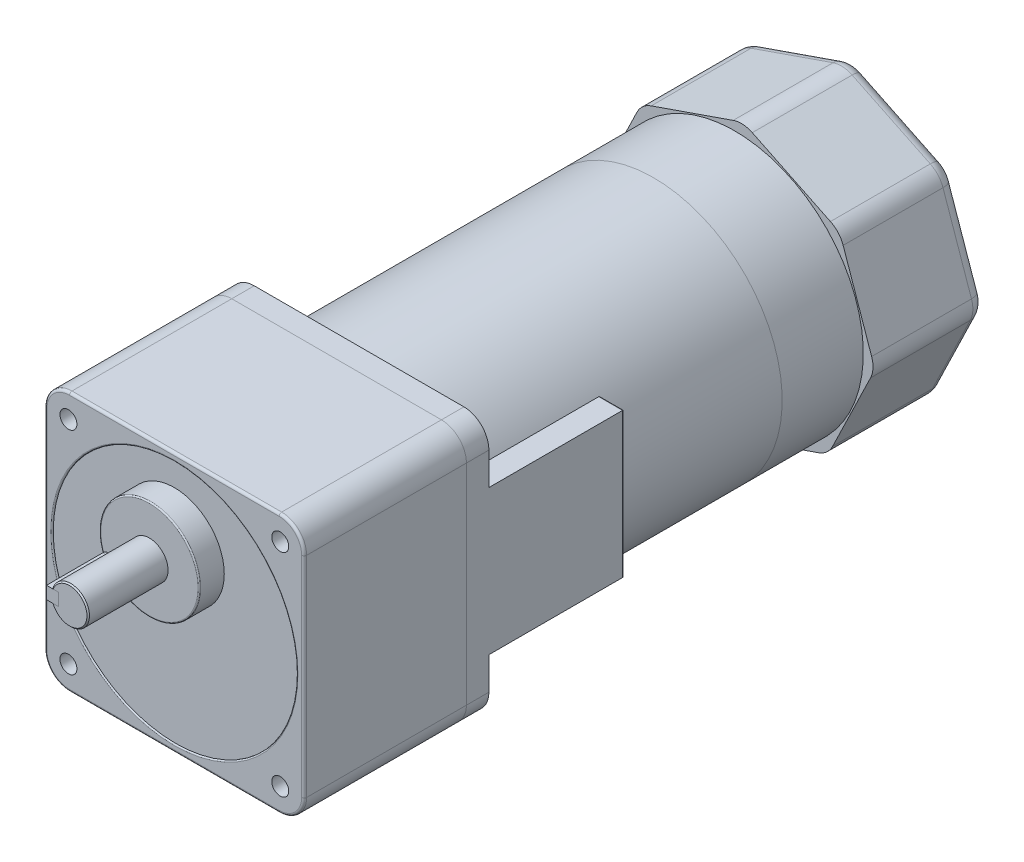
ISO-10303-21;
HEADER;
FILE_DESCRIPTION(('STEP AP214'),'2;1');
FILE_NAME('part.step','',(''),(''),'','','');
FILE_SCHEMA(('AUTOMOTIVE_DESIGN { 1 0 10303 214 1 1 1 1 }'));
ENDSEC;
DATA;
#1=APPLICATION_CONTEXT('core data for automotive mechanical design processes');
#2=APPLICATION_PROTOCOL_DEFINITION('international standard','automotive_design',2000,#1);
#3=PRODUCT_CONTEXT('',#1,'mechanical');
#4=PRODUCT('Part','Part','',(#3));
#5=PRODUCT_RELATED_PRODUCT_CATEGORY('part','',(#4));
#6=PRODUCT_DEFINITION_FORMATION('','',#4);
#7=PRODUCT_DEFINITION_CONTEXT('part definition',#1,'design');
#8=PRODUCT_DEFINITION('design','',#6,#7);
#9=PRODUCT_DEFINITION_SHAPE('','',#8);
#10=(LENGTH_UNIT() NAMED_UNIT(*) SI_UNIT(.MILLI.,.METRE.));
#11=(NAMED_UNIT(*) PLANE_ANGLE_UNIT() SI_UNIT($,.RADIAN.));
#12=(NAMED_UNIT(*) SI_UNIT($,.STERADIAN.) SOLID_ANGLE_UNIT());
#13=UNCERTAINTY_MEASURE_WITH_UNIT(LENGTH_MEASURE(1.E-05),#10,'distance_accuracy_value','');
#14=(GEOMETRIC_REPRESENTATION_CONTEXT(3) GLOBAL_UNCERTAINTY_ASSIGNED_CONTEXT((#13)) GLOBAL_UNIT_ASSIGNED_CONTEXT((#10,
#11,#12)) REPRESENTATION_CONTEXT('',''));
#15=CARTESIAN_POINT('',(0.,0.,0.));
#16=DIRECTION('',(0.,0.,1.));
#17=DIRECTION('',(1.,0.,0.));
#18=AXIS2_PLACEMENT_3D('',#15,#16,#17);
#19=CARTESIAN_POINT('',(-9.5,20.,84.5));
#20=DIRECTION('',(1.,0.,0.));
#21=DIRECTION('',(0.,0.,-1.));
#22=AXIS2_PLACEMENT_3D('',#19,#20,#21);
#23=CYLINDRICAL_SURFACE('',#22,2.5);
#24=DIRECTION('',(1.,0.,0.));
#25=VECTOR('',#24,1.);
#26=CARTESIAN_POINT('',(-9.5,17.5,84.5));
#27=LINE('',#26,#25);
#28=CARTESIAN_POINT('',(-9.20000000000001,17.5,84.5));
#29=VERTEX_POINT('',#28);
#30=CARTESIAN_POINT('',(-4.5,17.5,84.5));
#31=VERTEX_POINT('',#30);
#32=EDGE_CURVE('E101',#29,#31,#27,.T.);
#33=ORIENTED_EDGE('',*,*,#32,.F.);
#34=CARTESIAN_POINT('',(-9.20000000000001,20.,84.5));
#35=DIRECTION('',(-1.,0.,0.));
#36=DIRECTION('',(0.,0.,1.));
#37=AXIS2_PLACEMENT_3D('',#34,#35,#36);
#38=CIRCLE('',#37,2.5);
#39=CARTESIAN_POINT('',(-9.20000000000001,22.5,84.5));
#40=VERTEX_POINT('',#39);
#41=EDGE_CURVE('E12',#29,#40,#38,.F.);
#42=ORIENTED_EDGE('',*,*,#41,.T.);
#43=DIRECTION('',(1.,0.,0.));
#44=VECTOR('',#43,1.);
#45=CARTESIAN_POINT('',(-9.5,22.5,84.5));
#46=LINE('',#45,#44);
#47=CARTESIAN_POINT('',(-4.5,22.5,84.5));
#48=VERTEX_POINT('',#47);
#49=EDGE_CURVE('E121',#40,#48,#46,.T.);
#50=ORIENTED_EDGE('',*,*,#49,.T.);
#51=CARTESIAN_POINT('',(-4.5,20.,84.5));
#52=DIRECTION('',(-1.,0.,0.));
#53=DIRECTION('',(0.,0.,1.));
#54=AXIS2_PLACEMENT_3D('',#51,#52,#53);
#55=CIRCLE('',#54,2.5);
#56=EDGE_CURVE('E116',#48,#31,#55,.T.);
#57=ORIENTED_EDGE('',*,*,#56,.T.);
#58=EDGE_LOOP('',(#33,#42,#50,#57));
#59=FACE_BOUND('',#58,.T.);
#60=ADVANCED_FACE('F49',(#59),#23,.T.);
#61=CARTESIAN_POINT('',(-9.5,17.5,107.));
#62=DIRECTION('',(0.,1.,0.));
#63=DIRECTION('',(0.,0.,1.));
#64=AXIS2_PLACEMENT_3D('',#61,#62,#63);
#65=PLANE('',#64);
#66=DIRECTION('',(1.,0.,0.));
#67=VECTOR('',#66,1.);
#68=CARTESIAN_POINT('',(-9.5,17.5,107.));
#69=LINE('',#68,#67);
#70=CARTESIAN_POINT('',(-9.20000000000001,17.5,107.));
#71=VERTEX_POINT('',#70);
#72=CARTESIAN_POINT('',(-4.5,17.5,107.));
#73=VERTEX_POINT('',#72);
#74=EDGE_CURVE('E110',#71,#73,#69,.T.);
#75=ORIENTED_EDGE('',*,*,#74,.F.);
#76=DIRECTION('',(0.,0.,-1.));
#77=VECTOR('',#76,1.);
#78=CARTESIAN_POINT('',(-9.20000000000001,17.5,84.5));
#79=LINE('',#78,#77);
#80=EDGE_CURVE('E58',#71,#29,#79,.T.);
#81=ORIENTED_EDGE('',*,*,#80,.T.);
#82=ORIENTED_EDGE('',*,*,#32,.T.);
#83=DIRECTION('',(0.,0.,1.));
#84=VECTOR('',#83,1.);
#85=CARTESIAN_POINT('',(-4.5,17.5,107.));
#86=LINE('',#85,#84);
#87=EDGE_CURVE('E104',#31,#73,#86,.T.);
#88=ORIENTED_EDGE('',*,*,#87,.T.);
#89=EDGE_LOOP('',(#75,#81,#82,#88));
#90=FACE_BOUND('',#89,.T.);
#91=ADVANCED_FACE('F103',(#90),#65,.F.);
#92=CARTESIAN_POINT('',(-9.5,22.5,107.));
#93=DIRECTION('',(0.,0.,-1.));
#94=DIRECTION('',(-1.,0.,0.));
#95=AXIS2_PLACEMENT_3D('',#92,#93,#94);
#96=PLANE('',#95);
#97=DIRECTION('',(1.,0.,0.));
#98=VECTOR('',#97,1.);
#99=CARTESIAN_POINT('',(-9.5,22.5,107.));
#100=LINE('',#99,#98);
#101=CARTESIAN_POINT('',(-9.20000000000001,22.5,107.));
#102=VERTEX_POINT('',#101);
#103=CARTESIAN_POINT('',(-4.5,22.5,107.));
#104=VERTEX_POINT('',#103);
#105=EDGE_CURVE('E131',#102,#104,#100,.T.);
#106=ORIENTED_EDGE('',*,*,#105,.F.);
#107=DIRECTION('',(0.,-1.,0.));
#108=VECTOR('',#107,1.);
#109=CARTESIAN_POINT('',(-9.20000000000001,17.5,107.));
#110=LINE('',#109,#108);
#111=EDGE_CURVE('E73',#102,#71,#110,.T.);
#112=ORIENTED_EDGE('',*,*,#111,.T.);
#113=ORIENTED_EDGE('',*,*,#74,.T.);
#114=DIRECTION('',(0.,1.,0.));
#115=VECTOR('',#114,1.);
#116=CARTESIAN_POINT('',(-4.5,22.5,107.));
#117=LINE('',#116,#115);
#118=EDGE_CURVE('E118',#73,#104,#117,.T.);
#119=ORIENTED_EDGE('',*,*,#118,.T.);
#120=EDGE_LOOP('',(#106,#112,#113,#119));
#121=FACE_BOUND('',#120,.T.);
#122=ADVANCED_FACE('F169',(#121),#96,.F.);
#123=CARTESIAN_POINT('',(-9.5,22.5,84.5));
#124=DIRECTION('',(0.,-1.,0.));
#125=DIRECTION('',(0.,0.,-1.));
#126=AXIS2_PLACEMENT_3D('',#123,#124,#125);
#127=PLANE('',#126);
#128=ORIENTED_EDGE('',*,*,#49,.F.);
#129=DIRECTION('',(0.,0.,1.));
#130=VECTOR('',#129,1.);
#131=CARTESIAN_POINT('',(-9.20000000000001,22.5,107.));
#132=LINE('',#131,#130);
#133=EDGE_CURVE('E142',#40,#102,#132,.T.);
#134=ORIENTED_EDGE('',*,*,#133,.T.);
#135=ORIENTED_EDGE('',*,*,#105,.T.);
#136=DIRECTION('',(0.,0.,-1.));
#137=VECTOR('',#136,1.);
#138=CARTESIAN_POINT('',(-4.5,22.5,84.5));
#139=LINE('',#138,#137);
#140=EDGE_CURVE('E128',#104,#48,#139,.T.);
#141=ORIENTED_EDGE('',*,*,#140,.T.);
#142=EDGE_LOOP('',(#128,#134,#135,#141));
#143=FACE_BOUND('',#142,.T.);
#144=ADVANCED_FACE('F168',(#143),#127,.F.);
#145=CARTESIAN_POINT('',(-9.5,20.,84.5));
#146=DIRECTION('',(-1.,0.,0.));
#147=DIRECTION('',(0.,0.,1.));
#148=AXIS2_PLACEMENT_3D('',#145,#146,#147);
#149=PLANE('',#148);
#150=DIRECTION('',(0.,1.,0.));
#151=VECTOR('',#150,1.);
#152=CARTESIAN_POINT('',(-9.5,22.5,106.7));
#153=LINE('',#152,#151);
#154=CARTESIAN_POINT('',(-9.5,17.8,106.7));
#155=VERTEX_POINT('',#154);
#156=CARTESIAN_POINT('',(-9.5,22.2,106.7));
#157=VERTEX_POINT('',#156);
#158=EDGE_CURVE('E137',#155,#157,#153,.T.);
#159=ORIENTED_EDGE('',*,*,#158,.T.);
#160=DIRECTION('',(0.,0.,-1.));
#161=VECTOR('',#160,1.);
#162=CARTESIAN_POINT('',(-9.5,22.2,84.5));
#163=LINE('',#162,#161);
#164=CARTESIAN_POINT('',(-9.5,22.2,84.5));
#165=VERTEX_POINT('',#164);
#166=EDGE_CURVE('E139',#157,#165,#163,.T.);
#167=ORIENTED_EDGE('',*,*,#166,.T.);
#168=CARTESIAN_POINT('',(-9.5,20.,84.5));
#169=DIRECTION('',(-1.,0.,0.));
#170=DIRECTION('',(0.,0.,1.));
#171=AXIS2_PLACEMENT_3D('',#168,#169,#170);
#172=CIRCLE('',#171,2.2);
#173=CARTESIAN_POINT('',(-9.5,17.8,84.5));
#174=VERTEX_POINT('',#173);
#175=EDGE_CURVE('E109',#165,#174,#172,.T.);
#176=ORIENTED_EDGE('',*,*,#175,.T.);
#177=DIRECTION('',(0.,0.,1.));
#178=VECTOR('',#177,1.);
#179=CARTESIAN_POINT('',(-9.5,17.8,107.));
#180=LINE('',#179,#178);
#181=EDGE_CURVE('E135',#174,#155,#180,.T.);
#182=ORIENTED_EDGE('',*,*,#181,.T.);
#183=EDGE_LOOP('',(#159,#167,#176,#182));
#184=FACE_BOUND('',#183,.T.);
#185=ADVANCED_FACE('F161',(#184),#149,.T.);
#186=CARTESIAN_POINT('',(-4.5,20.,84.5));
#187=DIRECTION('',(-1.,0.,0.));
#188=DIRECTION('',(0.,0.,1.));
#189=AXIS2_PLACEMENT_3D('',#186,#187,#188);
#190=PLANE('',#189);
#191=ORIENTED_EDGE('',*,*,#56,.F.);
#192=ORIENTED_EDGE('',*,*,#140,.F.);
#193=ORIENTED_EDGE('',*,*,#118,.F.);
#194=ORIENTED_EDGE('',*,*,#87,.F.);
#195=EDGE_LOOP('',(#191,#192,#193,#194));
#196=FACE_BOUND('',#195,.T.);
#197=ADVANCED_FACE('F114',(#196),#190,.F.);
#198=CARTESIAN_POINT('',(-9.5,17.8,84.5));
#199=DIRECTION('',(-0.707106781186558,-0.707106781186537,0.));
#200=DIRECTION('',(0.,0.,-1.));
#201=AXIS2_PLACEMENT_3D('',#198,#199,#200);
#202=PLANE('',#201);
#203=DIRECTION('',(-0.707106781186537,0.707106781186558,0.));
#204=VECTOR('',#203,1.);
#205=CARTESIAN_POINT('',(-9.20000000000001,17.5,84.5));
#206=LINE('',#205,#204);
#207=EDGE_CURVE('E125',#29,#174,#206,.T.);
#208=ORIENTED_EDGE('',*,*,#207,.F.);
#209=ORIENTED_EDGE('',*,*,#80,.F.);
#210=DIRECTION('',(-0.577350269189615,0.577350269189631,-0.577350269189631));
#211=VECTOR('',#210,1.);
#212=CARTESIAN_POINT('',(-16.8999999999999,25.2000000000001,99.2999999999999));
#213=LINE('',#212,#211);
#214=EDGE_CURVE('E53',#155,#71,#213,.F.);
#215=ORIENTED_EDGE('',*,*,#214,.F.);
#216=ORIENTED_EDGE('',*,*,#181,.F.);
#217=EDGE_LOOP('',(#208,#209,#215,#216));
#218=FACE_BOUND('',#217,.T.);
#219=ADVANCED_FACE('F51',(#218),#202,.T.);
#220=CARTESIAN_POINT('',(-9.5,20.,106.7));
#221=DIRECTION('',(-0.707106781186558,0.,0.707106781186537));
#222=DIRECTION('',(0.,-1.,0.));
#223=AXIS2_PLACEMENT_3D('',#220,#221,#222);
#224=PLANE('',#223);
#225=ORIENTED_EDGE('',*,*,#214,.T.);
#226=ORIENTED_EDGE('',*,*,#111,.F.);
#227=DIRECTION('',(-0.577350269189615,-0.577350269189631,-0.577350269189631));
#228=VECTOR('',#227,1.);
#229=CARTESIAN_POINT('',(-10.2333333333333,21.4666666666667,105.966666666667));
#230=LINE('',#229,#228);
#231=EDGE_CURVE('E149',#157,#102,#230,.F.);
#232=ORIENTED_EDGE('',*,*,#231,.F.);
#233=ORIENTED_EDGE('',*,*,#158,.F.);
#234=EDGE_LOOP('',(#225,#226,#232,#233));
#235=FACE_BOUND('',#234,.T.);
#236=ADVANCED_FACE('F186',(#235),#224,.T.);
#237=CARTESIAN_POINT('',(-9.5,20.,84.5));
#238=DIRECTION('',(1.,0.,0.));
#239=DIRECTION('',(0.,0.,-1.));
#240=AXIS2_PLACEMENT_3D('',#237,#238,#239);
#241=CONICAL_SURFACE('',#240,2.2,0.785398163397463);
#242=ORIENTED_EDGE('',*,*,#207,.T.);
#243=ORIENTED_EDGE('',*,*,#175,.F.);
#244=DIRECTION('',(-0.707106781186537,-0.707106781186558,0.));
#245=VECTOR('',#244,1.);
#246=CARTESIAN_POINT('',(-9.20000000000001,22.5,84.5));
#247=LINE('',#246,#245);
#248=EDGE_CURVE('E147',#40,#165,#247,.T.);
#249=ORIENTED_EDGE('',*,*,#248,.F.);
#250=ORIENTED_EDGE('',*,*,#41,.F.);
#251=EDGE_LOOP('',(#242,#243,#249,#250));
#252=FACE_BOUND('',#251,.T.);
#253=ADVANCED_FACE('F154',(#252),#241,.T.);
#254=CARTESIAN_POINT('',(-9.5,22.2,84.5));
#255=DIRECTION('',(-0.707106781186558,0.707106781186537,0.));
#256=DIRECTION('',(0.,0.,1.));
#257=AXIS2_PLACEMENT_3D('',#254,#255,#256);
#258=PLANE('',#257);
#259=ORIENTED_EDGE('',*,*,#231,.T.);
#260=ORIENTED_EDGE('',*,*,#133,.F.);
#261=ORIENTED_EDGE('',*,*,#248,.T.);
#262=ORIENTED_EDGE('',*,*,#166,.F.);
#263=EDGE_LOOP('',(#259,#260,#261,#262));
#264=FACE_BOUND('',#263,.T.);
#265=ADVANCED_FACE('F165',(#264),#258,.T.);
#266=CLOSED_SHELL('',(#60,#91,#122,#144,#185,#197,#219,#236,#253,#265));
#267=MANIFOLD_SOLID_BREP('B2',#266);
#268=CARTESIAN_POINT('',(0.,20.,107.));
#269=DIRECTION('',(0.,0.,-1.));
#270=DIRECTION('',(-1.,0.,0.));
#271=AXIS2_PLACEMENT_3D('',#268,#269,#270);
#272=CYLINDRICAL_SURFACE('',#271,7.5);
#273=CARTESIAN_POINT('',(0.,20.,75.));
#274=DIRECTION('',(0.,0.,1.));
#275=DIRECTION('',(1.,0.,0.));
#276=AXIS2_PLACEMENT_3D('',#273,#274,#275);
#277=CIRCLE('',#276,7.5);
#278=CARTESIAN_POINT('',(7.5,20.,75.));
#279=VERTEX_POINT('',#278);
#280=EDGE_CURVE('E339',#279,#279,#277,.T.);
#281=ORIENTED_EDGE('',*,*,#280,.T.);
#282=EDGE_LOOP('',(#281));
#283=FACE_BOUND('',#282,.T.);
#284=CARTESIAN_POINT('',(-7.07106781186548,22.5,84.5));
#285=CARTESIAN_POINT('',(-7.07105693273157,22.500008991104,84.4317929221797));
#286=CARTESIAN_POINT('',(-7.07205443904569,22.4972088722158,84.3635919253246));
#287=CARTESIAN_POINT('',(-7.07598524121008,22.4860604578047,84.2277189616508));
#288=CARTESIAN_POINT('',(-7.07891801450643,22.477713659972,84.160046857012));
#289=CARTESIAN_POINT('',(-7.08662705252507,22.455574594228,84.0259095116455));
#290=CARTESIAN_POINT('',(-7.09139784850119,22.4417984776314,83.9594412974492));
#291=CARTESIAN_POINT('',(-7.10262619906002,22.4089418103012,83.8279917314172));
#292=CARTESIAN_POINT('',(-7.10908381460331,22.3898610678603,83.7630104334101));
#293=CARTESIAN_POINT('',(-7.13069940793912,22.324915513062,83.5710384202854));
#294=CARTESIAN_POINT('',(-7.14811243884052,22.2713141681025,83.44682084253));
#295=CARTESIAN_POINT('',(-7.1869703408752,22.1451778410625,83.2091231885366));
#296=CARTESIAN_POINT('',(-7.20841768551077,22.0726312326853,83.0956497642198));
#297=CARTESIAN_POINT('',(-7.25386182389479,21.9076299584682,82.8782070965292));
#298=CARTESIAN_POINT('',(-7.27792189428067,21.8145628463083,82.7747148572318));
#299=CARTESIAN_POINT('',(-7.32534626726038,21.6124707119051,82.5844828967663));
#300=CARTESIAN_POINT('',(-7.34871044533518,21.5034428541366,82.497746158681));
#301=CARTESIAN_POINT('',(-7.39284706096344,21.2690092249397,82.3413017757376));
#302=CARTESIAN_POINT('',(-7.41353593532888,21.1432502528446,82.2720976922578));
#303=CARTESIAN_POINT('',(-7.44924021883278,20.8810730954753,82.1560192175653));
#304=CARTESIAN_POINT('',(-7.46425736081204,20.7446581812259,82.1091380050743));
#305=CARTESIAN_POINT('',(-7.48647677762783,20.4700733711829,82.0406607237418));
#306=CARTESIAN_POINT('',(-7.49393272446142,20.3321295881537,82.0182418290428));
#307=CARTESIAN_POINT('',(-7.50109021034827,20.0542474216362,81.9967092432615));
#308=CARTESIAN_POINT('',(-7.50079359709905,19.9143095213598,81.9975899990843));
#309=CARTESIAN_POINT('',(-7.49265096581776,19.6422403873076,82.0221107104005));
#310=CARTESIAN_POINT('',(-7.48510152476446,19.5100182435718,82.0448565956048));
#311=CARTESIAN_POINT('',(-7.46367401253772,19.2513898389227,82.1109829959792));
#312=CARTESIAN_POINT('',(-7.44979559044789,19.1249839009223,82.1543646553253));
#313=CARTESIAN_POINT('',(-7.41689170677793,18.8796184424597,82.2610534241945));
#314=CARTESIAN_POINT('',(-7.39780094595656,18.760778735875,82.3246151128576));
#315=CARTESIAN_POINT('',(-7.35645969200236,18.5351885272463,82.469649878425));
#316=CARTESIAN_POINT('',(-7.33420833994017,18.4284413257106,82.5511278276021));
#317=CARTESIAN_POINT('',(-7.28765679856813,18.2247566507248,82.734177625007));
#318=CARTESIAN_POINT('',(-7.26330946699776,18.128515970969,82.8365138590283));
#319=CARTESIAN_POINT('',(-7.21618726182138,17.9543199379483,83.0561037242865));
#320=CARTESIAN_POINT('',(-7.19341289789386,17.8763704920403,83.1733621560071));
#321=CARTESIAN_POINT('',(-7.15175078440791,17.7399916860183,83.4217004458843));
#322=CARTESIAN_POINT('',(-7.13292537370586,17.6818674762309,83.5529587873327));
#323=CARTESIAN_POINT('',(-7.10202742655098,17.5888494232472,83.8241174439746));
#324=CARTESIAN_POINT('',(-7.08994423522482,17.5539189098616,83.9640037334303));
#325=CARTESIAN_POINT('',(-7.078413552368,17.5208546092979,84.17104659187));
#326=CARTESIAN_POINT('',(-7.07566669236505,17.5130373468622,84.2366034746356));
#327=CARTESIAN_POINT('',(-7.07199258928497,17.502613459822,84.3680951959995));
#328=CARTESIAN_POINT('',(-7.0710629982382,17.5000001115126,84.434029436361));
#329=CARTESIAN_POINT('',(-7.07106781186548,17.5,84.5));
#330=B_SPLINE_CURVE_WITH_KNOTS('',3,(#284,#285,#286,#287,#288,#289,#290,#291,#292,#293,#294,
#295,#296,#297,#298,#299,#300,#301,#302,#303,#304,#305,#306,#307,#308,#309,#310,#311,#312,#313,
#314,#315,#316,#317,#318,#319,#320,#321,#322,#323,#324,#325,#326,#327,#328,#329),.UNSPECIFIED.,
.F.,.F.,(4,2,2,2,2,2,2,2,2,2,2,2,2,2,2,2,2,2,2,2,2,2,4),(0.,0.204546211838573,0.409037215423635,
0.612924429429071,0.816819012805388,1.22401016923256,1.63145179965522,2.05327864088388,
2.47518051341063,2.90809434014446,3.34087579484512,3.75860278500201,4.176230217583,
4.57747647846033,4.97874498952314,5.38529148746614,5.79194868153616,6.2177173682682,
6.643623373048,7.07581676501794,7.50732520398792,7.70536340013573,7.90314555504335),.UNSPECIFIED.);
#331=CARTESIAN_POINT('',(-7.07106781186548,22.5,84.5));
#332=VERTEX_POINT('',#331);
#333=CARTESIAN_POINT('',(-7.07106781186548,17.5,84.5));
#334=VERTEX_POINT('',#333);
#335=EDGE_CURVE('E47',#332,#334,#330,.T.);
#336=ORIENTED_EDGE('',*,*,#335,.F.);
#337=DIRECTION('',(0.,0.,-1.));
#338=VECTOR('',#337,1.);
#339=CARTESIAN_POINT('',(-7.07106781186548,22.5,107.));
#340=LINE('',#339,#338);
#341=CARTESIAN_POINT('',(-7.07106781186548,22.5,106.5));
#342=VERTEX_POINT('',#341);
#343=EDGE_CURVE('E330',#342,#332,#340,.T.);
#344=ORIENTED_EDGE('',*,*,#343,.F.);
#345=CARTESIAN_POINT('',(0.,20.,106.5));
#346=DIRECTION('',(0.,0.,1.));
#347=DIRECTION('',(1.,0.,0.));
#348=AXIS2_PLACEMENT_3D('',#345,#346,#347);
#349=CIRCLE('',#348,7.5);
#350=CARTESIAN_POINT('',(-7.07106781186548,17.5,106.5));
#351=VERTEX_POINT('',#350);
#352=EDGE_CURVE('E345',#342,#351,#349,.F.);
#353=ORIENTED_EDGE('',*,*,#352,.T.);
#354=DIRECTION('',(0.,0.,-1.));
#355=VECTOR('',#354,1.);
#356=CARTESIAN_POINT('',(-7.07106781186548,17.5,107.));
#357=LINE('',#356,#355);
#358=EDGE_CURVE('E280',#334,#351,#357,.F.);
#359=ORIENTED_EDGE('',*,*,#358,.F.);
#360=EDGE_LOOP('',(#336,#344,#353,#359));
#361=FACE_BOUND('',#360,.T.);
#362=ADVANCED_FACE('F260',(#283,#361),#272,.T.);
#363=CARTESIAN_POINT('',(0.,20.,107.));
#364=DIRECTION('',(0.,0.,1.));
#365=DIRECTION('',(1.,0.,0.));
#366=AXIS2_PLACEMENT_3D('',#363,#364,#365);
#367=PLANE('',#366);
#368=CARTESIAN_POINT('',(0.,20.,107.));
#369=DIRECTION('',(0.,0.,1.));
#370=DIRECTION('',(1.,0.,0.));
#371=AXIS2_PLACEMENT_3D('',#368,#369,#370);
#372=CIRCLE('',#371,7.);
#373=CARTESIAN_POINT('',(-6.53834841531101,17.5,107.));
#374=VERTEX_POINT('',#373);
#375=CARTESIAN_POINT('',(-6.53834841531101,22.5,107.));
#376=VERTEX_POINT('',#375);
#377=EDGE_CURVE('E342',#374,#376,#372,.T.);
#378=ORIENTED_EDGE('',*,*,#377,.T.);
#379=DIRECTION('',(-1.,0.,0.));
#380=VECTOR('',#379,1.);
#381=CARTESIAN_POINT('',(-4.5,22.5,107.));
#382=LINE('',#381,#380);
#383=CARTESIAN_POINT('',(-4.5,22.5,107.));
#384=VERTEX_POINT('',#383);
#385=EDGE_CURVE('E331',#384,#376,#382,.T.);
#386=ORIENTED_EDGE('',*,*,#385,.F.);
#387=DIRECTION('',(0.,-1.,0.));
#388=VECTOR('',#387,1.);
#389=CARTESIAN_POINT('',(-4.5,22.5,107.));
#390=LINE('',#389,#388);
#391=CARTESIAN_POINT('',(-4.5,17.5,107.));
#392=VERTEX_POINT('',#391);
#393=EDGE_CURVE('E318',#384,#392,#390,.T.);
#394=ORIENTED_EDGE('',*,*,#393,.T.);
#395=DIRECTION('',(-1.,0.,0.));
#396=VECTOR('',#395,1.);
#397=CARTESIAN_POINT('',(-4.5,17.5,107.));
#398=LINE('',#397,#396);
#399=EDGE_CURVE('E334',#392,#374,#398,.T.);
#400=ORIENTED_EDGE('',*,*,#399,.T.);
#401=EDGE_LOOP('',(#378,#386,#394,#400));
#402=FACE_BOUND('',#401,.T.);
#403=ADVANCED_FACE('F367',(#402),#367,.T.);
#404=CARTESIAN_POINT('',(0.,20.,107.));
#405=DIRECTION('',(0.,0.,-1.));
#406=DIRECTION('',(-1.,0.,0.));
#407=AXIS2_PLACEMENT_3D('',#404,#405,#406);
#408=CONICAL_SURFACE('',#407,7.,0.785398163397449);
#409=ORIENTED_EDGE('',*,*,#352,.F.);
#410=CARTESIAN_POINT('',(-11.0143547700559,22.5,102.705487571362));
#411=CARTESIAN_POINT('',(-10.6798349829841,22.5,103.031669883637));
#412=CARTESIAN_POINT('',(-10.3449877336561,22.5,103.357518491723));
#413=CARTESIAN_POINT('',(-9.67434994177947,22.5,104.008192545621));
#414=CARTESIAN_POINT('',(-9.3385594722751,22.5,104.333018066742));
#415=CARTESIAN_POINT('',(-8.6658920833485,22.5,104.981151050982));
#416=CARTESIAN_POINT('',(-8.32901590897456,22.5,105.304459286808));
#417=CARTESIAN_POINT('',(-7.65344263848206,22.5,105.949228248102));
#418=CARTESIAN_POINT('',(-7.31474539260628,22.5,106.270688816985));
#419=CARTESIAN_POINT('',(-6.80457575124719,22.5,106.750931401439));
#420=CARTESIAN_POINT('',(-6.6340879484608,22.5,106.910759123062));
#421=CARTESIAN_POINT('',(-6.29229590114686,22.5,107.229536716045));
#422=CARTESIAN_POINT('',(-6.12099166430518,22.5,107.38848659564));
#423=CARTESIAN_POINT('',(-5.77739778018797,22.5,107.705248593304));
#424=CARTESIAN_POINT('',(-5.60510833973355,22.5,107.863060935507));
#425=CARTESIAN_POINT('',(-5.25922656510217,22.5,108.177266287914));
#426=CARTESIAN_POINT('',(-5.08563418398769,22.5,108.333659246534));
#427=CARTESIAN_POINT('',(-4.73662813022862,22.5,108.644687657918));
#428=CARTESIAN_POINT('',(-4.56121310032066,22.5,108.799321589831));
#429=CARTESIAN_POINT('',(-4.20817217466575,22.5,109.106020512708));
#430=CARTESIAN_POINT('',(-4.03054650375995,22.5,109.258085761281));
#431=CARTESIAN_POINT('',(-3.76176911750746,22.5,109.483525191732));
#432=CARTESIAN_POINT('',(-3.67175442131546,22.5,109.558254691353));
#433=CARTESIAN_POINT('',(-3.49082532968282,22.5,109.706612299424));
#434=CARTESIAN_POINT('',(-3.399910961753,22.5,109.78024044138));
#435=CARTESIAN_POINT('',(-3.21698494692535,22.5,109.926189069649));
#436=CARTESIAN_POINT('',(-3.12497293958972,22.5,109.998509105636));
#437=CARTESIAN_POINT('',(-2.93965183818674,22.5,110.14148620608));
#438=CARTESIAN_POINT('',(-2.84634260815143,22.5,110.212143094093));
#439=CARTESIAN_POINT('',(-2.75227945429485,22.5,110.281795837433));
#440=B_SPLINE_CURVE_WITH_KNOTS('',3,(#410,#411,#412,#413,#414,#415,#416,#417,#418,#419,#420,
#421,#422,#423,#424,#425,#426,#427,#428,#429,#430,#431,#432,#433,#434,#435,#436,#437,#438,#439),
.UNSPECIFIED.,.F.,.F.,(4,2,2,2,2,2,2,2,2,2,2,2,2,2,4),(0.,1.4016744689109,2.80324322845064,
4.20399722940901,5.60486824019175,6.30593577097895,7.00699671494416,7.70791552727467,
8.40885971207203,9.11036980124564,9.81180911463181,10.1627784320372,10.5137370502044,
10.864814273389,11.2159285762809),.UNSPECIFIED.);
#441=EDGE_CURVE('E273',#342,#376,#440,.T.);
#442=ORIENTED_EDGE('',*,*,#441,.T.);
#443=ORIENTED_EDGE('',*,*,#377,.F.);
#444=CARTESIAN_POINT('',(-2.75227945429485,17.5,110.281795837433));
#445=CARTESIAN_POINT('',(-2.82551522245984,17.5,110.227577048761));
#446=CARTESIAN_POINT('',(-2.89828844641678,17.5,110.172740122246));
#447=CARTESIAN_POINT('',(-3.043018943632,17.5,110.062008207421));
#448=CARTESIAN_POINT('',(-3.11497626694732,17.5,110.006113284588));
#449=CARTESIAN_POINT('',(-3.32976761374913,17.5,109.837125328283));
#450=CARTESIAN_POINT('',(-3.47155558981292,17.5,109.722703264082));
#451=CARTESIAN_POINT('',(-3.75292181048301,17.5,109.491337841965));
#452=CARTESIAN_POINT('',(-3.8925011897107,17.5,109.3743958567));
#453=CARTESIAN_POINT('',(-4.17001061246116,17.5,109.138555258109));
#454=CARTESIAN_POINT('',(-4.30794054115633,17.5,109.019656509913));
#455=CARTESIAN_POINT('',(-4.5823789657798,17.5,108.78045226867));
#456=CARTESIAN_POINT('',(-4.71888850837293,17.5,108.660147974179));
#457=CARTESIAN_POINT('',(-4.99085017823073,17.5,108.418358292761));
#458=CARTESIAN_POINT('',(-5.1263023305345,17.5,108.296872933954));
#459=CARTESIAN_POINT('',(-5.5314179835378,17.5,107.930975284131));
#460=CARTESIAN_POINT('',(-5.79980668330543,17.5,107.685151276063));
#461=CARTESIAN_POINT('',(-6.14300557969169,17.5,107.367828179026));
#462=CARTESIAN_POINT('',(-6.21888659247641,17.5,107.297480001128));
#463=CARTESIAN_POINT('',(-6.37047314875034,17.5,107.156598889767));
#464=CARTESIAN_POINT('',(-6.44617869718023,17.5,107.086065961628));
#465=CARTESIAN_POINT('',(-6.67307720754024,17.5,106.874199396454));
#466=CARTESIAN_POINT('',(-6.8240348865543,17.5,106.732613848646));
#467=CARTESIAN_POINT('',(-7.31490063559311,17.5,106.27054247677));
#468=CARTESIAN_POINT('',(-7.65375215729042,17.5,105.948934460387));
#469=CARTESIAN_POINT('',(-8.32966336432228,17.5,105.30383974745));
#470=CARTESIAN_POINT('',(-8.66672303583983,17.5,104.98035303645));
#471=CARTESIAN_POINT('',(-9.3394195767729,17.5,104.332186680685));
#472=CARTESIAN_POINT('',(-9.67505698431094,17.5,104.00750759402));
#473=CARTESIAN_POINT('',(-10.3453568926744,17.5,103.357159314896));
#474=CARTESIAN_POINT('',(-10.6800194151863,17.5,103.031490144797));
#475=CARTESIAN_POINT('',(-11.0143547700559,17.5,102.705487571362));
#476=B_SPLINE_CURVE_WITH_KNOTS('',3,(#444,#445,#446,#447,#448,#449,#450,#451,#452,#453,#454,
#455,#456,#457,#458,#459,#460,#461,#462,#463,#464,#465,#466,#467,#468,#469,#470,#471,#472,#473,
#474,#475),.UNSPECIFIED.,.F.,.F.,(4,2,2,2,2,2,2,2,2,2,2,2,2,2,2,4),(0.,0.273355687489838,
0.546694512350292,1.09324270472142,1.63950035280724,2.18579581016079,2.73165523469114,
3.27750169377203,4.36933033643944,4.67975144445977,4.99016370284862,5.61105831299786,
7.01256945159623,8.41409138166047,9.81502466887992,11.215926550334),.UNSPECIFIED.);
#477=EDGE_CURVE('E348',#374,#351,#476,.T.);
#478=ORIENTED_EDGE('',*,*,#477,.T.);
#479=EDGE_LOOP('',(#409,#442,#443,#478));
#480=FACE_BOUND('',#479,.T.);
#481=ADVANCED_FACE('F262',(#480),#408,.T.);
#482=CARTESIAN_POINT('',(0.,20.,75.));
#483=DIRECTION('',(0.,0.,1.));
#484=DIRECTION('',(1.,0.,0.));
#485=AXIS2_PLACEMENT_3D('',#482,#483,#484);
#486=PLANE('',#485);
#487=ORIENTED_EDGE('',*,*,#280,.F.);
#488=EDGE_LOOP('',(#487));
#489=FACE_BOUND('',#488,.T.);
#490=ADVANCED_FACE('F366',(#489),#486,.F.);
#491=CARTESIAN_POINT('',(-4.5,20.,84.5));
#492=DIRECTION('',(-1.,0.,0.));
#493=DIRECTION('',(0.,0.,1.));
#494=AXIS2_PLACEMENT_3D('',#491,#492,#493);
#495=CYLINDRICAL_SURFACE('',#494,2.5);
#496=DIRECTION('',(-1.,0.,0.));
#497=VECTOR('',#496,1.);
#498=CARTESIAN_POINT('',(-4.5,22.5,84.5));
#499=LINE('',#498,#497);
#500=CARTESIAN_POINT('',(-4.5,22.5,84.5));
#501=VERTEX_POINT('',#500);
#502=EDGE_CURVE('E326',#501,#332,#499,.T.);
#503=ORIENTED_EDGE('',*,*,#502,.T.);
#504=ORIENTED_EDGE('',*,*,#335,.T.);
#505=DIRECTION('',(-1.,0.,0.));
#506=VECTOR('',#505,1.);
#507=CARTESIAN_POINT('',(-4.5,17.5,84.5));
#508=LINE('',#507,#506);
#509=CARTESIAN_POINT('',(-4.5,17.5,84.5));
#510=VERTEX_POINT('',#509);
#511=EDGE_CURVE('E327',#510,#334,#508,.T.);
#512=ORIENTED_EDGE('',*,*,#511,.F.);
#513=CARTESIAN_POINT('',(-4.5,20.,84.5));
#514=DIRECTION('',(1.,0.,0.));
#515=DIRECTION('',(0.,0.,-1.));
#516=AXIS2_PLACEMENT_3D('',#513,#514,#515);
#517=CIRCLE('',#516,2.5);
#518=EDGE_CURVE('E316',#510,#501,#517,.T.);
#519=ORIENTED_EDGE('',*,*,#518,.T.);
#520=EDGE_LOOP('',(#503,#504,#512,#519));
#521=FACE_BOUND('',#520,.T.);
#522=ADVANCED_FACE('F325',(#521),#495,.F.);
#523=CARTESIAN_POINT('',(-4.5,22.5,84.5));
#524=DIRECTION('',(0.,-1.,0.));
#525=DIRECTION('',(0.,0.,-1.));
#526=AXIS2_PLACEMENT_3D('',#523,#524,#525);
#527=PLANE('',#526);
#528=ORIENTED_EDGE('',*,*,#343,.T.);
#529=ORIENTED_EDGE('',*,*,#502,.F.);
#530=DIRECTION('',(0.,0.,1.));
#531=VECTOR('',#530,1.);
#532=CARTESIAN_POINT('',(-4.5,22.5,84.5));
#533=LINE('',#532,#531);
#534=EDGE_CURVE('E312',#501,#384,#533,.T.);
#535=ORIENTED_EDGE('',*,*,#534,.T.);
#536=ORIENTED_EDGE('',*,*,#385,.T.);
#537=ORIENTED_EDGE('',*,*,#441,.F.);
#538=EDGE_LOOP('',(#528,#529,#535,#536,#537));
#539=FACE_BOUND('',#538,.T.);
#540=ADVANCED_FACE('F329',(#539),#527,.T.);
#541=CARTESIAN_POINT('',(-4.5,17.5,107.));
#542=DIRECTION('',(0.,1.,0.));
#543=DIRECTION('',(0.,0.,1.));
#544=AXIS2_PLACEMENT_3D('',#541,#542,#543);
#545=PLANE('',#544);
#546=ORIENTED_EDGE('',*,*,#358,.T.);
#547=ORIENTED_EDGE('',*,*,#477,.F.);
#548=ORIENTED_EDGE('',*,*,#399,.F.);
#549=DIRECTION('',(0.,0.,-1.));
#550=VECTOR('',#549,1.);
#551=CARTESIAN_POINT('',(-4.5,17.5,107.));
#552=LINE('',#551,#550);
#553=EDGE_CURVE('E381',#392,#510,#552,.T.);
#554=ORIENTED_EDGE('',*,*,#553,.T.);
#555=ORIENTED_EDGE('',*,*,#511,.T.);
#556=EDGE_LOOP('',(#546,#547,#548,#554,#555));
#557=FACE_BOUND('',#556,.T.);
#558=ADVANCED_FACE('F357',(#557),#545,.T.);
#559=CARTESIAN_POINT('',(-4.5,20.,84.5));
#560=DIRECTION('',(1.,0.,0.));
#561=DIRECTION('',(0.,0.,-1.));
#562=AXIS2_PLACEMENT_3D('',#559,#560,#561);
#563=PLANE('',#562);
#564=ORIENTED_EDGE('',*,*,#518,.F.);
#565=ORIENTED_EDGE('',*,*,#553,.F.);
#566=ORIENTED_EDGE('',*,*,#393,.F.);
#567=ORIENTED_EDGE('',*,*,#534,.F.);
#568=EDGE_LOOP('',(#564,#565,#566,#567));
#569=FACE_BOUND('',#568,.T.);
#570=ADVANCED_FACE('F314',(#569),#563,.F.);
#571=CLOSED_SHELL('',(#362,#403,#481,#490,#522,#540,#558,#570));
#572=MANIFOLD_SOLID_BREP('B6',#571);
#573=CARTESIAN_POINT('',(0.,20.,75.));
#574=DIRECTION('',(0.,0.,-1.));
#575=DIRECTION('',(-1.,0.,0.));
#576=AXIS2_PLACEMENT_3D('',#573,#574,#575);
#577=CYLINDRICAL_SURFACE('',#576,20.);
#578=CARTESIAN_POINT('',(0.,20.,74.5));
#579=DIRECTION('',(0.,0.,1.));
#580=DIRECTION('',(1.,0.,0.));
#581=AXIS2_PLACEMENT_3D('',#578,#579,#580);
#582=CIRCLE('',#581,20.);
#583=CARTESIAN_POINT('',(20.,20.,74.5));
#584=VERTEX_POINT('',#583);
#585=EDGE_CURVE('E259',#584,#584,#582,.F.);
#586=ORIENTED_EDGE('',*,*,#585,.T.);
#587=EDGE_LOOP('',(#586));
#588=FACE_BOUND('',#587,.T.);
#589=CARTESIAN_POINT('',(0.,20.,65.));
#590=DIRECTION('',(0.,0.,1.));
#591=DIRECTION('',(1.,0.,0.));
#592=AXIS2_PLACEMENT_3D('',#589,#590,#591);
#593=CIRCLE('',#592,20.);
#594=CARTESIAN_POINT('',(20.,20.,65.));
#595=VERTEX_POINT('',#594);
#596=EDGE_CURVE('E460',#595,#595,#593,.T.);
#597=ORIENTED_EDGE('',*,*,#596,.T.);
#598=EDGE_LOOP('',(#597));
#599=FACE_BOUND('',#598,.T.);
#600=ADVANCED_FACE('F449',(#588,#599),#577,.T.);
#601=CARTESIAN_POINT('',(0.,20.,75.));
#602=DIRECTION('',(0.,0.,1.));
#603=DIRECTION('',(1.,0.,0.));
#604=AXIS2_PLACEMENT_3D('',#601,#602,#603);
#605=PLANE('',#604);
#606=CARTESIAN_POINT('',(0.,20.,75.));
#607=DIRECTION('',(0.,0.,1.));
#608=DIRECTION('',(1.,0.,0.));
#609=AXIS2_PLACEMENT_3D('',#606,#607,#608);
#610=CIRCLE('',#609,19.5);
#611=CARTESIAN_POINT('',(19.5,20.,75.));
#612=VERTEX_POINT('',#611);
#613=EDGE_CURVE('E456',#612,#612,#610,.T.);
#614=ORIENTED_EDGE('',*,*,#613,.T.);
#615=EDGE_LOOP('',(#614));
#616=FACE_BOUND('',#615,.T.);
#617=ADVANCED_FACE('F470',(#616),#605,.T.);
#618=CARTESIAN_POINT('',(0.,20.,65.));
#619=DIRECTION('',(0.,0.,1.));
#620=DIRECTION('',(1.,0.,0.));
#621=AXIS2_PLACEMENT_3D('',#618,#619,#620);
#622=PLANE('',#621);
#623=ORIENTED_EDGE('',*,*,#596,.F.);
#624=EDGE_LOOP('',(#623));
#625=FACE_BOUND('',#624,.T.);
#626=ADVANCED_FACE('F468',(#625),#622,.F.);
#627=CARTESIAN_POINT('',(0.,20.,74.5));
#628=DIRECTION('',(0.,0.,1.));
#629=DIRECTION('',(1.,0.,0.));
#630=AXIS2_PLACEMENT_3D('',#627,#628,#629);
#631=TOROIDAL_SURFACE('',#630,19.5,0.5);
#632=ORIENTED_EDGE('',*,*,#585,.F.);
#633=EDGE_LOOP('',(#632));
#634=FACE_BOUND('',#633,.T.);
#635=ORIENTED_EDGE('',*,*,#613,.F.);
#636=EDGE_LOOP('',(#635));
#637=FACE_BOUND('',#636,.T.);
#638=ADVANCED_FACE('F451',(#634,#637),#631,.T.);
#639=CLOSED_SHELL('',(#600,#617,#626,#638));
#640=MANIFOLD_SOLID_BREP('B41',#639);
#641=CARTESIAN_POINT('',(45.3825112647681,-2.66124468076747,-204.5));
#642=DIRECTION('',(0.,0.,1.));
#643=DIRECTION('',(1.,0.,0.));
#644=AXIS2_PLACEMENT_3D('',#641,#642,#643);
#645=CYLINDRICAL_SURFACE('',#644,10.);
#646=DIRECTION('',(0.,0.,1.));
#647=VECTOR('',#646,1.);
#648=CARTESIAN_POINT('',(54.3814408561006,-7.02235305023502,-204.5));
#649=LINE('',#648,#647);
#650=CARTESIAN_POINT('',(54.3814408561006,-7.02235305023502,-199.5));
#651=VERTEX_POINT('',#650);
#652=CARTESIAN_POINT('',(54.3814408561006,-7.02235305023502,-159.5));
#653=VERTEX_POINT('',#652);
#654=EDGE_CURVE('E672',#651,#653,#649,.T.);
#655=ORIENTED_EDGE('',*,*,#654,.F.);
#656=CARTESIAN_POINT('',(45.3825112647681,-2.66124468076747,-199.5));
#657=DIRECTION('',(0.,0.,-1.));
#658=DIRECTION('',(-1.,0.,0.));
#659=AXIS2_PLACEMENT_3D('',#656,#657,#658);
#660=CIRCLE('',#659,10.);
#661=CARTESIAN_POINT('',(54.8294847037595,0.618190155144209,-199.5));
#662=VERTEX_POINT('',#661);
#663=EDGE_CURVE('E447',#651,#662,#660,.F.);
#664=ORIENTED_EDGE('',*,*,#663,.T.);
#665=DIRECTION('',(0.,0.,1.));
#666=VECTOR('',#665,1.);
#667=CARTESIAN_POINT('',(54.8294847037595,0.618190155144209,-204.5));
#668=LINE('',#667,#666);
#669=CARTESIAN_POINT('',(54.8294847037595,0.618190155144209,-159.5));
#670=VERTEX_POINT('',#669);
#671=EDGE_CURVE('E693',#662,#670,#668,.T.);
#672=ORIENTED_EDGE('',*,*,#671,.T.);
#673=CARTESIAN_POINT('',(45.3825112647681,-2.66124468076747,-159.5));
#674=DIRECTION('',(0.,0.,-1.));
#675=DIRECTION('',(-1.,0.,0.));
#676=AXIS2_PLACEMENT_3D('',#673,#674,#675);
#677=CIRCLE('',#676,10.);
#678=EDGE_CURVE('E687',#670,#653,#677,.T.);
#679=ORIENTED_EDGE('',*,*,#678,.T.);
#680=EDGE_LOOP('',(#655,#664,#672,#679));
#681=FACE_BOUND('',#680,.T.);
#682=ADVANCED_FACE('F512',(#681),#645,.T.);
#683=CARTESIAN_POINT('',(54.3814408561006,-7.02235305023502,-204.5));
#684=DIRECTION('',(-0.899892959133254,0.436110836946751,0.));
#685=DIRECTION('',(-0.436110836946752,-0.899892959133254,0.));
#686=AXIS2_PLACEMENT_3D('',#683,#684,#685);
#687=PLANE('',#686);
#688=DIRECTION('',(0.,0.,1.));
#689=VECTOR('',#688,1.);
#690=CARTESIAN_POINT('',(39.2074268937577,-38.3331739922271,-204.5));
#691=LINE('',#690,#689);
#692=CARTESIAN_POINT('',(39.2074268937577,-38.3331739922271,-199.5));
#693=VERTEX_POINT('',#692);
#694=CARTESIAN_POINT('',(39.2074268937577,-38.3331739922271,-159.5));
#695=VERTEX_POINT('',#694);
#696=EDGE_CURVE('E681',#693,#695,#691,.T.);
#697=ORIENTED_EDGE('',*,*,#696,.F.);
#698=DIRECTION('',(-0.436110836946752,-0.899892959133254,0.));
#699=VECTOR('',#698,1.);
#700=CARTESIAN_POINT('',(54.3814408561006,-7.02235305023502,-199.5));
#701=LINE('',#700,#699);
#702=EDGE_CURVE('E521',#693,#651,#701,.F.);
#703=ORIENTED_EDGE('',*,*,#702,.T.);
#704=ORIENTED_EDGE('',*,*,#654,.T.);
#705=DIRECTION('',(-0.436110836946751,-0.899892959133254,0.));
#706=VECTOR('',#705,1.);
#707=CARTESIAN_POINT('',(54.3814408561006,-7.02235305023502,-159.5));
#708=LINE('',#707,#706);
#709=EDGE_CURVE('E675',#653,#695,#708,.T.);
#710=ORIENTED_EDGE('',*,*,#709,.T.);
#711=EDGE_LOOP('',(#697,#703,#704,#710));
#712=FACE_BOUND('',#711,.T.);
#713=ADVANCED_FACE('F674',(#712),#687,.F.);
#714=CARTESIAN_POINT('',(30.2084973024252,-33.9720656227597,-204.5));
#715=DIRECTION('',(0.,0.,1.));
#716=DIRECTION('',(1.,0.,0.));
#717=AXIS2_PLACEMENT_3D('',#714,#715,#716);
#718=CYLINDRICAL_SURFACE('',#717,10.);
#719=DIRECTION('',(0.,0.,1.));
#720=VECTOR('',#719,1.);
#721=CARTESIAN_POINT('',(33.4879321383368,-43.4190390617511,-204.5));
#722=LINE('',#721,#720);
#723=CARTESIAN_POINT('',(33.4879321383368,-43.4190390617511,-199.5));
#724=VERTEX_POINT('',#723);
#725=CARTESIAN_POINT('',(33.4879321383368,-43.4190390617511,-159.5));
#726=VERTEX_POINT('',#725);
#727=EDGE_CURVE('E763',#724,#726,#722,.T.);
#728=ORIENTED_EDGE('',*,*,#727,.F.);
#729=CARTESIAN_POINT('',(30.2084973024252,-33.9720656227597,-199.5));
#730=DIRECTION('',(0.,0.,-1.));
#731=DIRECTION('',(-1.,0.,0.));
#732=AXIS2_PLACEMENT_3D('',#729,#730,#731);
#733=CIRCLE('',#732,10.);
#734=EDGE_CURVE('E536',#724,#693,#733,.F.);
#735=ORIENTED_EDGE('',*,*,#734,.T.);
#736=ORIENTED_EDGE('',*,*,#696,.T.);
#737=CARTESIAN_POINT('',(30.2084973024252,-33.9720656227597,-159.5));
#738=DIRECTION('',(0.,0.,-1.));
#739=DIRECTION('',(-1.,0.,0.));
#740=AXIS2_PLACEMENT_3D('',#737,#738,#739);
#741=CIRCLE('',#740,10.);
#742=EDGE_CURVE('E690',#695,#726,#741,.T.);
#743=ORIENTED_EDGE('',*,*,#742,.T.);
#744=EDGE_LOOP('',(#728,#735,#736,#743));
#745=FACE_BOUND('',#744,.T.);
#746=ADVANCED_FACE('F1001',(#745),#718,.T.);
#747=CARTESIAN_POINT('',(33.4879321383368,-43.4190390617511,-204.5));
#748=DIRECTION('',(-0.327943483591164,0.944697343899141,0.));
#749=DIRECTION('',(-0.944697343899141,-0.327943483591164,0.));
#750=AXIS2_PLACEMENT_3D('',#747,#748,#749);
#751=PLANE('',#750);
#752=DIRECTION('',(0.,0.,1.));
#753=VECTOR('',#752,1.);
#754=CARTESIAN_POINT('',(0.618190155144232,-54.8294847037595,-204.5));
#755=LINE('',#754,#753);
#756=CARTESIAN_POINT('',(0.618190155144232,-54.8294847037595,-199.5));
#757=VERTEX_POINT('',#756);
#758=CARTESIAN_POINT('',(0.618190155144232,-54.8294847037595,-159.5));
#759=VERTEX_POINT('',#758);
#760=EDGE_CURVE('E761',#757,#759,#755,.T.);
#761=ORIENTED_EDGE('',*,*,#760,.F.);
#762=DIRECTION('',(-0.944697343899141,-0.327943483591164,0.));
#763=VECTOR('',#762,1.);
#764=CARTESIAN_POINT('',(33.4879321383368,-43.4190390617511,-199.5));
#765=LINE('',#764,#763);
#766=EDGE_CURVE('E823',#757,#724,#765,.F.);
#767=ORIENTED_EDGE('',*,*,#766,.T.);
#768=ORIENTED_EDGE('',*,*,#727,.T.);
#769=DIRECTION('',(-0.944697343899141,-0.327943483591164,0.));
#770=VECTOR('',#769,1.);
#771=CARTESIAN_POINT('',(33.4879321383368,-43.4190390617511,-159.5));
#772=LINE('',#771,#770);
#773=EDGE_CURVE('E700',#726,#759,#772,.T.);
#774=ORIENTED_EDGE('',*,*,#773,.T.);
#775=EDGE_LOOP('',(#761,#767,#768,#774));
#776=FACE_BOUND('',#775,.T.);
#777=ADVANCED_FACE('F897',(#776),#751,.F.);
#778=CARTESIAN_POINT('',(-2.66124468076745,-45.3825112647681,-204.5));
#779=DIRECTION('',(0.,0.,1.));
#780=DIRECTION('',(1.,0.,0.));
#781=AXIS2_PLACEMENT_3D('',#778,#779,#780);
#782=CYLINDRICAL_SURFACE('',#781,10.);
#783=DIRECTION('',(0.,0.,1.));
#784=VECTOR('',#783,1.);
#785=CARTESIAN_POINT('',(-7.022353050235,-54.3814408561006,-204.5));
#786=LINE('',#785,#784);
#787=CARTESIAN_POINT('',(-7.022353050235,-54.3814408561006,-199.5));
#788=VERTEX_POINT('',#787);
#789=CARTESIAN_POINT('',(-7.022353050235,-54.3814408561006,-159.5));
#790=VERTEX_POINT('',#789);
#791=EDGE_CURVE('E759',#788,#790,#786,.T.);
#792=ORIENTED_EDGE('',*,*,#791,.F.);
#793=CARTESIAN_POINT('',(-2.66124468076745,-45.3825112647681,-199.5));
#794=DIRECTION('',(0.,0.,-1.));
#795=DIRECTION('',(-1.,0.,0.));
#796=AXIS2_PLACEMENT_3D('',#793,#794,#795);
#797=CIRCLE('',#796,10.);
#798=EDGE_CURVE('E821',#788,#757,#797,.F.);
#799=ORIENTED_EDGE('',*,*,#798,.T.);
#800=ORIENTED_EDGE('',*,*,#760,.T.);
#801=CARTESIAN_POINT('',(-2.66124468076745,-45.3825112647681,-159.5));
#802=DIRECTION('',(0.,0.,-1.));
#803=DIRECTION('',(-1.,0.,0.));
#804=AXIS2_PLACEMENT_3D('',#801,#802,#803);
#805=CIRCLE('',#804,10.);
#806=EDGE_CURVE('E703',#759,#790,#805,.T.);
#807=ORIENTED_EDGE('',*,*,#806,.T.);
#808=EDGE_LOOP('',(#792,#799,#800,#807));
#809=FACE_BOUND('',#808,.T.);
#810=ADVANCED_FACE('F895',(#809),#782,.T.);
#811=CARTESIAN_POINT('',(-7.022353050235,-54.3814408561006,-204.5));
#812=DIRECTION('',(0.436110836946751,0.899892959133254,0.));
#813=DIRECTION('',(-0.899892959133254,0.436110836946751,0.));
#814=AXIS2_PLACEMENT_3D('',#811,#812,#813);
#815=PLANE('',#814);
#816=DIRECTION('',(0.,0.,1.));
#817=VECTOR('',#816,1.);
#818=CARTESIAN_POINT('',(-38.3331739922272,-39.2074268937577,-204.5));
#819=LINE('',#818,#817);
#820=CARTESIAN_POINT('',(-38.3331739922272,-39.2074268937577,-199.5));
#821=VERTEX_POINT('',#820);
#822=CARTESIAN_POINT('',(-38.3331739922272,-39.2074268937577,-159.5));
#823=VERTEX_POINT('',#822);
#824=EDGE_CURVE('E757',#821,#823,#819,.T.);
#825=ORIENTED_EDGE('',*,*,#824,.F.);
#826=DIRECTION('',(-0.899892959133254,0.436110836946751,0.));
#827=VECTOR('',#826,1.);
#828=CARTESIAN_POINT('',(-7.022353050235,-54.3814408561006,-199.5));
#829=LINE('',#828,#827);
#830=EDGE_CURVE('E819',#821,#788,#829,.F.);
#831=ORIENTED_EDGE('',*,*,#830,.T.);
#832=ORIENTED_EDGE('',*,*,#791,.T.);
#833=DIRECTION('',(-0.899892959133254,0.436110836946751,0.));
#834=VECTOR('',#833,1.);
#835=CARTESIAN_POINT('',(-7.022353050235,-54.3814408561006,-159.5));
#836=LINE('',#835,#834);
#837=EDGE_CURVE('E706',#790,#823,#836,.T.);
#838=ORIENTED_EDGE('',*,*,#837,.T.);
#839=EDGE_LOOP('',(#825,#831,#832,#838));
#840=FACE_BOUND('',#839,.T.);
#841=ADVANCED_FACE('F904',(#840),#815,.F.);
#842=CARTESIAN_POINT('',(-33.9720656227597,-30.2084973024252,-204.5));
#843=DIRECTION('',(0.,0.,1.));
#844=DIRECTION('',(1.,0.,0.));
#845=AXIS2_PLACEMENT_3D('',#842,#843,#844);
#846=CYLINDRICAL_SURFACE('',#845,10.);
#847=DIRECTION('',(0.,0.,1.));
#848=VECTOR('',#847,1.);
#849=CARTESIAN_POINT('',(-43.4190390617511,-33.4879321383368,-204.5));
#850=LINE('',#849,#848);
#851=CARTESIAN_POINT('',(-43.4190390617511,-33.4879321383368,-199.5));
#852=VERTEX_POINT('',#851);
#853=CARTESIAN_POINT('',(-43.4190390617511,-33.4879321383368,-159.5));
#854=VERTEX_POINT('',#853);
#855=EDGE_CURVE('E755',#852,#854,#850,.T.);
#856=ORIENTED_EDGE('',*,*,#855,.F.);
#857=CARTESIAN_POINT('',(-33.9720656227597,-30.2084973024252,-199.5));
#858=DIRECTION('',(0.,0.,-1.));
#859=DIRECTION('',(-1.,0.,0.));
#860=AXIS2_PLACEMENT_3D('',#857,#858,#859);
#861=CIRCLE('',#860,10.);
#862=EDGE_CURVE('E817',#852,#821,#861,.F.);
#863=ORIENTED_EDGE('',*,*,#862,.T.);
#864=ORIENTED_EDGE('',*,*,#824,.T.);
#865=CARTESIAN_POINT('',(-33.9720656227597,-30.2084973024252,-159.5));
#866=DIRECTION('',(0.,0.,-1.));
#867=DIRECTION('',(-1.,0.,0.));
#868=AXIS2_PLACEMENT_3D('',#865,#866,#867);
#869=CIRCLE('',#868,10.);
#870=EDGE_CURVE('E709',#823,#854,#869,.T.);
#871=ORIENTED_EDGE('',*,*,#870,.T.);
#872=EDGE_LOOP('',(#856,#863,#864,#871));
#873=FACE_BOUND('',#872,.T.);
#874=ADVANCED_FACE('F907',(#873),#846,.T.);
#875=CARTESIAN_POINT('',(-43.4190390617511,-33.4879321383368,-204.5));
#876=DIRECTION('',(0.944697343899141,0.327943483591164,0.));
#877=DIRECTION('',(-0.327943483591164,0.944697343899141,0.));
#878=AXIS2_PLACEMENT_3D('',#875,#876,#877);
#879=PLANE('',#878);
#880=DIRECTION('',(0.,0.,1.));
#881=VECTOR('',#880,1.);
#882=CARTESIAN_POINT('',(-54.8294847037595,-0.618190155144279,-204.5));
#883=LINE('',#882,#881);
#884=CARTESIAN_POINT('',(-54.8294847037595,-0.618190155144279,-199.5));
#885=VERTEX_POINT('',#884);
#886=CARTESIAN_POINT('',(-54.8294847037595,-0.618190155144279,-159.5));
#887=VERTEX_POINT('',#886);
#888=EDGE_CURVE('E753',#885,#887,#883,.T.);
#889=ORIENTED_EDGE('',*,*,#888,.F.);
#890=DIRECTION('',(-0.327943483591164,0.944697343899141,0.));
#891=VECTOR('',#890,1.);
#892=CARTESIAN_POINT('',(-43.4190390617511,-33.4879321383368,-199.5));
#893=LINE('',#892,#891);
#894=EDGE_CURVE('E815',#885,#852,#893,.F.);
#895=ORIENTED_EDGE('',*,*,#894,.T.);
#896=ORIENTED_EDGE('',*,*,#855,.T.);
#897=DIRECTION('',(-0.327943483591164,0.944697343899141,0.));
#898=VECTOR('',#897,1.);
#899=CARTESIAN_POINT('',(-43.4190390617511,-33.4879321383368,-159.5));
#900=LINE('',#899,#898);
#901=EDGE_CURVE('E712',#854,#887,#900,.T.);
#902=ORIENTED_EDGE('',*,*,#901,.T.);
#903=EDGE_LOOP('',(#889,#895,#896,#902));
#904=FACE_BOUND('',#903,.T.);
#905=ADVANCED_FACE('F910',(#904),#879,.F.);
#906=CARTESIAN_POINT('',(-45.3825112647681,2.6612446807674,-204.5));
#907=DIRECTION('',(0.,0.,1.));
#908=DIRECTION('',(1.,0.,0.));
#909=AXIS2_PLACEMENT_3D('',#906,#907,#908);
#910=CYLINDRICAL_SURFACE('',#909,10.);
#911=DIRECTION('',(0.,0.,1.));
#912=VECTOR('',#911,1.);
#913=CARTESIAN_POINT('',(-54.3814408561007,7.02235305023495,-204.5));
#914=LINE('',#913,#912);
#915=CARTESIAN_POINT('',(-54.3814408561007,7.02235305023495,-199.5));
#916=VERTEX_POINT('',#915);
#917=CARTESIAN_POINT('',(-54.3814408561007,7.02235305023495,-159.5));
#918=VERTEX_POINT('',#917);
#919=EDGE_CURVE('E751',#916,#918,#914,.T.);
#920=ORIENTED_EDGE('',*,*,#919,.F.);
#921=CARTESIAN_POINT('',(-45.3825112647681,2.6612446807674,-199.5));
#922=DIRECTION('',(0.,0.,-1.));
#923=DIRECTION('',(-1.,0.,0.));
#924=AXIS2_PLACEMENT_3D('',#921,#922,#923);
#925=CIRCLE('',#924,10.);
#926=EDGE_CURVE('E813',#916,#885,#925,.F.);
#927=ORIENTED_EDGE('',*,*,#926,.T.);
#928=ORIENTED_EDGE('',*,*,#888,.T.);
#929=CARTESIAN_POINT('',(-45.3825112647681,2.6612446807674,-159.5));
#930=DIRECTION('',(0.,0.,-1.));
#931=DIRECTION('',(-1.,0.,0.));
#932=AXIS2_PLACEMENT_3D('',#929,#930,#931);
#933=CIRCLE('',#932,10.);
#934=EDGE_CURVE('E715',#887,#918,#933,.T.);
#935=ORIENTED_EDGE('',*,*,#934,.T.);
#936=EDGE_LOOP('',(#920,#927,#928,#935));
#937=FACE_BOUND('',#936,.T.);
#938=ADVANCED_FACE('F914',(#937),#910,.T.);
#939=CARTESIAN_POINT('',(-54.3814408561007,7.02235305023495,-204.5));
#940=DIRECTION('',(0.899892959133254,-0.436110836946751,0.));
#941=DIRECTION('',(0.436110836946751,0.899892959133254,0.));
#942=AXIS2_PLACEMENT_3D('',#939,#940,#941);
#943=PLANE('',#942);
#944=DIRECTION('',(0.,0.,1.));
#945=VECTOR('',#944,1.);
#946=CARTESIAN_POINT('',(-39.2074268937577,38.3331739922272,-204.5));
#947=LINE('',#946,#945);
#948=CARTESIAN_POINT('',(-39.2074268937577,38.3331739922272,-199.5));
#949=VERTEX_POINT('',#948);
#950=CARTESIAN_POINT('',(-39.2074268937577,38.3331739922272,-159.5));
#951=VERTEX_POINT('',#950);
#952=EDGE_CURVE('E749',#949,#951,#947,.T.);
#953=ORIENTED_EDGE('',*,*,#952,.F.);
#954=DIRECTION('',(0.436110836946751,0.899892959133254,0.));
#955=VECTOR('',#954,1.);
#956=CARTESIAN_POINT('',(-54.3814408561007,7.02235305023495,-199.5));
#957=LINE('',#956,#955);
#958=EDGE_CURVE('E811',#949,#916,#957,.F.);
#959=ORIENTED_EDGE('',*,*,#958,.T.);
#960=ORIENTED_EDGE('',*,*,#919,.T.);
#961=DIRECTION('',(0.436110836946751,0.899892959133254,0.));
#962=VECTOR('',#961,1.);
#963=CARTESIAN_POINT('',(-54.3814408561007,7.02235305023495,-159.5));
#964=LINE('',#963,#962);
#965=EDGE_CURVE('E718',#918,#951,#964,.T.);
#966=ORIENTED_EDGE('',*,*,#965,.T.);
#967=EDGE_LOOP('',(#953,#959,#960,#966));
#968=FACE_BOUND('',#967,.T.);
#969=ADVANCED_FACE('F987',(#968),#943,.F.);
#970=CARTESIAN_POINT('',(-30.2084973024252,33.9720656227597,-204.5));
#971=DIRECTION('',(0.,0.,1.));
#972=DIRECTION('',(1.,0.,0.));
#973=AXIS2_PLACEMENT_3D('',#970,#971,#972);
#974=CYLINDRICAL_SURFACE('',#973,9.99999999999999);
#975=DIRECTION('',(0.,0.,1.));
#976=VECTOR('',#975,1.);
#977=CARTESIAN_POINT('',(-33.4879321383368,43.4190390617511,-204.5));
#978=LINE('',#977,#976);
#979=CARTESIAN_POINT('',(-33.4879321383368,43.4190390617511,-199.5));
#980=VERTEX_POINT('',#979);
#981=CARTESIAN_POINT('',(-33.4879321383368,43.4190390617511,-159.5));
#982=VERTEX_POINT('',#981);
#983=EDGE_CURVE('E747',#980,#982,#978,.T.);
#984=ORIENTED_EDGE('',*,*,#983,.F.);
#985=CARTESIAN_POINT('',(-30.2084973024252,33.9720656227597,-199.5));
#986=DIRECTION('',(0.,0.,-1.));
#987=DIRECTION('',(-1.,0.,0.));
#988=AXIS2_PLACEMENT_3D('',#985,#986,#987);
#989=CIRCLE('',#988,9.99999999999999);
#990=EDGE_CURVE('E809',#980,#949,#989,.F.);
#991=ORIENTED_EDGE('',*,*,#990,.T.);
#992=ORIENTED_EDGE('',*,*,#952,.T.);
#993=CARTESIAN_POINT('',(-30.2084973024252,33.9720656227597,-159.5));
#994=DIRECTION('',(0.,0.,-1.));
#995=DIRECTION('',(-1.,0.,0.));
#996=AXIS2_PLACEMENT_3D('',#993,#994,#995);
#997=CIRCLE('',#996,9.99999999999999);
#998=EDGE_CURVE('E721',#951,#982,#997,.T.);
#999=ORIENTED_EDGE('',*,*,#998,.T.);
#1000=EDGE_LOOP('',(#984,#991,#992,#999));
#1001=FACE_BOUND('',#1000,.T.);
#1002=ADVANCED_FACE('F984',(#1001),#974,.T.);
#1003=CARTESIAN_POINT('',(-33.4879321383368,43.4190390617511,-204.5));
#1004=DIRECTION('',(0.327943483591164,-0.944697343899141,0.));
#1005=DIRECTION('',(0.944697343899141,0.327943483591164,0.));
#1006=AXIS2_PLACEMENT_3D('',#1003,#1004,#1005);
#1007=PLANE('',#1006);
#1008=DIRECTION('',(0.,0.,1.));
#1009=VECTOR('',#1008,1.);
#1010=CARTESIAN_POINT('',(-0.618190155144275,54.8294847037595,-204.5));
#1011=LINE('',#1010,#1009);
#1012=CARTESIAN_POINT('',(-0.618190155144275,54.8294847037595,-199.5));
#1013=VERTEX_POINT('',#1012);
#1014=CARTESIAN_POINT('',(-0.618190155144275,54.8294847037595,-159.5));
#1015=VERTEX_POINT('',#1014);
#1016=EDGE_CURVE('E745',#1013,#1015,#1011,.T.);
#1017=ORIENTED_EDGE('',*,*,#1016,.F.);
#1018=DIRECTION('',(0.944697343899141,0.327943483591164,0.));
#1019=VECTOR('',#1018,1.);
#1020=CARTESIAN_POINT('',(-33.4879321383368,43.4190390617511,-199.5));
#1021=LINE('',#1020,#1019);
#1022=EDGE_CURVE('E807',#1013,#980,#1021,.F.);
#1023=ORIENTED_EDGE('',*,*,#1022,.T.);
#1024=ORIENTED_EDGE('',*,*,#983,.T.);
#1025=DIRECTION('',(0.944697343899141,0.327943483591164,0.));
#1026=VECTOR('',#1025,1.);
#1027=CARTESIAN_POINT('',(-33.4879321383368,43.4190390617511,-159.5));
#1028=LINE('',#1027,#1026);
#1029=EDGE_CURVE('E724',#982,#1015,#1028,.T.);
#1030=ORIENTED_EDGE('',*,*,#1029,.T.);
#1031=EDGE_LOOP('',(#1017,#1023,#1024,#1030));
#1032=FACE_BOUND('',#1031,.T.);
#1033=ADVANCED_FACE('F981',(#1032),#1007,.F.);
#1034=CARTESIAN_POINT('',(2.66124468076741,45.3825112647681,-204.5));
#1035=DIRECTION('',(0.,0.,1.));
#1036=DIRECTION('',(1.,0.,0.));
#1037=AXIS2_PLACEMENT_3D('',#1034,#1035,#1036);
#1038=CYLINDRICAL_SURFACE('',#1037,9.99999999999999);
#1039=DIRECTION('',(0.,0.,1.));
#1040=VECTOR('',#1039,1.);
#1041=CARTESIAN_POINT('',(7.02235305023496,54.3814408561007,-204.5));
#1042=LINE('',#1041,#1040);
#1043=CARTESIAN_POINT('',(7.02235305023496,54.3814408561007,-199.5));
#1044=VERTEX_POINT('',#1043);
#1045=CARTESIAN_POINT('',(7.02235305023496,54.3814408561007,-159.5));
#1046=VERTEX_POINT('',#1045);
#1047=EDGE_CURVE('E743',#1044,#1046,#1042,.T.);
#1048=ORIENTED_EDGE('',*,*,#1047,.F.);
#1049=CARTESIAN_POINT('',(2.66124468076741,45.3825112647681,-199.5));
#1050=DIRECTION('',(0.,0.,-1.));
#1051=DIRECTION('',(-1.,0.,0.));
#1052=AXIS2_PLACEMENT_3D('',#1049,#1050,#1051);
#1053=CIRCLE('',#1052,9.99999999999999);
#1054=EDGE_CURVE('E805',#1044,#1013,#1053,.F.);
#1055=ORIENTED_EDGE('',*,*,#1054,.T.);
#1056=ORIENTED_EDGE('',*,*,#1016,.T.);
#1057=CARTESIAN_POINT('',(2.66124468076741,45.3825112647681,-159.5));
#1058=DIRECTION('',(0.,0.,-1.));
#1059=DIRECTION('',(1.,0.,0.));
#1060=AXIS2_PLACEMENT_3D('',#1057,#1058,#1059);
#1061=CIRCLE('',#1060,9.99999999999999);
#1062=EDGE_CURVE('E727',#1015,#1046,#1061,.T.);
#1063=ORIENTED_EDGE('',*,*,#1062,.T.);
#1064=EDGE_LOOP('',(#1048,#1055,#1056,#1063));
#1065=FACE_BOUND('',#1064,.T.);
#1066=ADVANCED_FACE('F976',(#1065),#1038,.T.);
#1067=CARTESIAN_POINT('',(7.02235305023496,54.3814408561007,-204.5));
#1068=DIRECTION('',(-0.436110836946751,-0.899892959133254,0.));
#1069=DIRECTION('',(0.899892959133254,-0.436110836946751,0.));
#1070=AXIS2_PLACEMENT_3D('',#1067,#1068,#1069);
#1071=PLANE('',#1070);
#1072=DIRECTION('',(0.,0.,1.));
#1073=VECTOR('',#1072,1.);
#1074=CARTESIAN_POINT('',(38.3331739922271,39.2074268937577,-204.5));
#1075=LINE('',#1074,#1073);
#1076=CARTESIAN_POINT('',(38.3331739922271,39.2074268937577,-199.5));
#1077=VERTEX_POINT('',#1076);
#1078=CARTESIAN_POINT('',(38.3331739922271,39.2074268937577,-159.5));
#1079=VERTEX_POINT('',#1078);
#1080=EDGE_CURVE('E741',#1077,#1079,#1075,.T.);
#1081=ORIENTED_EDGE('',*,*,#1080,.F.);
#1082=DIRECTION('',(0.899892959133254,-0.436110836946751,0.));
#1083=VECTOR('',#1082,1.);
#1084=CARTESIAN_POINT('',(7.02235305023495,54.3814408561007,-199.5));
#1085=LINE('',#1084,#1083);
#1086=EDGE_CURVE('E803',#1077,#1044,#1085,.F.);
#1087=ORIENTED_EDGE('',*,*,#1086,.T.);
#1088=ORIENTED_EDGE('',*,*,#1047,.T.);
#1089=DIRECTION('',(0.899892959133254,-0.436110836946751,0.));
#1090=VECTOR('',#1089,1.);
#1091=CARTESIAN_POINT('',(7.02235305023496,54.3814408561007,-159.5));
#1092=LINE('',#1091,#1090);
#1093=EDGE_CURVE('E730',#1046,#1079,#1092,.T.);
#1094=ORIENTED_EDGE('',*,*,#1093,.T.);
#1095=EDGE_LOOP('',(#1081,#1087,#1088,#1094));
#1096=FACE_BOUND('',#1095,.T.);
#1097=ADVANCED_FACE('F973',(#1096),#1071,.F.);
#1098=CARTESIAN_POINT('',(33.9720656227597,30.2084973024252,-204.5));
#1099=DIRECTION('',(0.,0.,1.));
#1100=DIRECTION('',(1.,0.,0.));
#1101=AXIS2_PLACEMENT_3D('',#1098,#1099,#1100);
#1102=CYLINDRICAL_SURFACE('',#1101,10.);
#1103=DIRECTION('',(0.,0.,1.));
#1104=VECTOR('',#1103,1.);
#1105=CARTESIAN_POINT('',(43.4190390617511,33.4879321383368,-204.5));
#1106=LINE('',#1105,#1104);
#1107=CARTESIAN_POINT('',(43.4190390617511,33.4879321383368,-199.5));
#1108=VERTEX_POINT('',#1107);
#1109=CARTESIAN_POINT('',(43.4190390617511,33.4879321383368,-159.5));
#1110=VERTEX_POINT('',#1109);
#1111=EDGE_CURVE('E739',#1108,#1110,#1106,.T.);
#1112=ORIENTED_EDGE('',*,*,#1111,.F.);
#1113=CARTESIAN_POINT('',(33.9720656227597,30.2084973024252,-199.5));
#1114=DIRECTION('',(0.,0.,-1.));
#1115=DIRECTION('',(-1.,0.,0.));
#1116=AXIS2_PLACEMENT_3D('',#1113,#1114,#1115);
#1117=CIRCLE('',#1116,10.);
#1118=EDGE_CURVE('E801',#1108,#1077,#1117,.F.);
#1119=ORIENTED_EDGE('',*,*,#1118,.T.);
#1120=ORIENTED_EDGE('',*,*,#1080,.T.);
#1121=CARTESIAN_POINT('',(33.9720656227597,30.2084973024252,-159.5));
#1122=DIRECTION('',(0.,0.,-1.));
#1123=DIRECTION('',(-1.,0.,0.));
#1124=AXIS2_PLACEMENT_3D('',#1121,#1122,#1123);
#1125=CIRCLE('',#1124,10.);
#1126=EDGE_CURVE('E733',#1079,#1110,#1125,.T.);
#1127=ORIENTED_EDGE('',*,*,#1126,.T.);
#1128=EDGE_LOOP('',(#1112,#1119,#1120,#1127));
#1129=FACE_BOUND('',#1128,.T.);
#1130=ADVANCED_FACE('F970',(#1129),#1102,.T.);
#1131=CARTESIAN_POINT('',(43.4190390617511,33.4879321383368,-204.5));
#1132=DIRECTION('',(-0.944697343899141,-0.327943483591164,0.));
#1133=DIRECTION('',(0.327943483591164,-0.944697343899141,0.));
#1134=AXIS2_PLACEMENT_3D('',#1131,#1132,#1133);
#1135=PLANE('',#1134);
#1136=ORIENTED_EDGE('',*,*,#671,.F.);
#1137=DIRECTION('',(0.327943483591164,-0.944697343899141,0.));
#1138=VECTOR('',#1137,1.);
#1139=CARTESIAN_POINT('',(43.4190390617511,33.4879321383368,-199.5));
#1140=LINE('',#1139,#1138);
#1141=EDGE_CURVE('E798',#662,#1108,#1140,.F.);
#1142=ORIENTED_EDGE('',*,*,#1141,.T.);
#1143=ORIENTED_EDGE('',*,*,#1111,.T.);
#1144=DIRECTION('',(0.327943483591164,-0.944697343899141,0.));
#1145=VECTOR('',#1144,1.);
#1146=CARTESIAN_POINT('',(43.4190390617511,33.4879321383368,-159.5));
#1147=LINE('',#1146,#1145);
#1148=EDGE_CURVE('E736',#1110,#670,#1147,.T.);
#1149=ORIENTED_EDGE('',*,*,#1148,.T.);
#1150=EDGE_LOOP('',(#1136,#1142,#1143,#1149));
#1151=FACE_BOUND('',#1150,.T.);
#1152=ADVANCED_FACE('F964',(#1151),#1135,.F.);
#1153=CARTESIAN_POINT('',(45.3825112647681,-2.66124468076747,-204.5));
#1154=DIRECTION('',(0.,0.,-1.));
#1155=DIRECTION('',(-1.,0.,0.));
#1156=AXIS2_PLACEMENT_3D('',#1153,#1154,#1155);
#1157=PLANE('',#1156);
#1158=CARTESIAN_POINT('',(33.9720656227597,30.2084973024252,-204.5));
#1159=DIRECTION('',(0.,0.,-1.));
#1160=DIRECTION('',(-1.,0.,0.));
#1161=AXIS2_PLACEMENT_3D('',#1158,#1159,#1160);
#1162=CIRCLE('',#1161,5.);
#1163=CARTESIAN_POINT('',(36.1526198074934,34.7079620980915,-204.5));
#1164=VERTEX_POINT('',#1163);
#1165=CARTESIAN_POINT('',(38.6955523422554,31.8482147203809,-204.5));
#1166=VERTEX_POINT('',#1165);
#1167=EDGE_CURVE('E793',#1164,#1166,#1162,.T.);
#1168=ORIENTED_EDGE('',*,*,#1167,.T.);
#1169=DIRECTION('',(0.327943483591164,-0.944697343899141,0.));
#1170=VECTOR('',#1169,1.);
#1171=CARTESIAN_POINT('',(50.1059979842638,-1.02152726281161,-204.5));
#1172=LINE('',#1171,#1170);
#1173=CARTESIAN_POINT('',(50.1059979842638,-1.02152726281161,-204.5));
#1174=VERTEX_POINT('',#1173);
#1175=EDGE_CURVE('E795',#1166,#1174,#1172,.T.);
#1176=ORIENTED_EDGE('',*,*,#1175,.T.);
#1177=CARTESIAN_POINT('',(45.3825112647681,-2.66124468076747,-204.5));
#1178=DIRECTION('',(0.,0.,-1.));
#1179=DIRECTION('',(-1.,0.,0.));
#1180=AXIS2_PLACEMENT_3D('',#1177,#1178,#1179);
#1181=CIRCLE('',#1180,5.);
#1182=CARTESIAN_POINT('',(49.8819760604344,-4.84179886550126,-204.5));
#1183=VERTEX_POINT('',#1182);
#1184=EDGE_CURVE('E680',#1174,#1183,#1181,.T.);
#1185=ORIENTED_EDGE('',*,*,#1184,.T.);
#1186=DIRECTION('',(-0.436110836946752,-0.899892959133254,0.));
#1187=VECTOR('',#1186,1.);
#1188=CARTESIAN_POINT('',(34.7079620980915,-36.1526198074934,-204.5));
#1189=LINE('',#1188,#1187);
#1190=CARTESIAN_POINT('',(34.7079620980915,-36.1526198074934,-204.5));
#1191=VERTEX_POINT('',#1190);
#1192=EDGE_CURVE('E767',#1183,#1191,#1189,.T.);
#1193=ORIENTED_EDGE('',*,*,#1192,.T.);
#1194=CARTESIAN_POINT('',(30.2084973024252,-33.9720656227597,-204.5));
#1195=DIRECTION('',(0.,0.,-1.));
#1196=DIRECTION('',(-1.,0.,0.));
#1197=AXIS2_PLACEMENT_3D('',#1194,#1195,#1196);
#1198=CIRCLE('',#1197,5.);
#1199=CARTESIAN_POINT('',(31.848214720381,-38.6955523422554,-204.5));
#1200=VERTEX_POINT('',#1199);
#1201=EDGE_CURVE('E769',#1191,#1200,#1198,.T.);
#1202=ORIENTED_EDGE('',*,*,#1201,.T.);
#1203=DIRECTION('',(-0.944697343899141,-0.327943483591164,0.));
#1204=VECTOR('',#1203,1.);
#1205=CARTESIAN_POINT('',(-1.02152726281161,-50.1059979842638,-204.5));
#1206=LINE('',#1205,#1204);
#1207=CARTESIAN_POINT('',(-1.02152726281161,-50.1059979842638,-204.5));
#1208=VERTEX_POINT('',#1207);
#1209=EDGE_CURVE('E771',#1200,#1208,#1206,.T.);
#1210=ORIENTED_EDGE('',*,*,#1209,.T.);
#1211=CARTESIAN_POINT('',(-2.66124468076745,-45.3825112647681,-204.5));
#1212=DIRECTION('',(0.,0.,-1.));
#1213=DIRECTION('',(-1.,0.,0.));
#1214=AXIS2_PLACEMENT_3D('',#1211,#1212,#1213);
#1215=CIRCLE('',#1214,5.);
#1216=CARTESIAN_POINT('',(-4.84179886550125,-49.8819760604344,-204.5));
#1217=VERTEX_POINT('',#1216);
#1218=EDGE_CURVE('E773',#1208,#1217,#1215,.T.);
#1219=ORIENTED_EDGE('',*,*,#1218,.T.);
#1220=DIRECTION('',(-0.899892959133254,0.436110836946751,0.));
#1221=VECTOR('',#1220,1.);
#1222=CARTESIAN_POINT('',(-36.1526198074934,-34.7079620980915,-204.5));
#1223=LINE('',#1222,#1221);
#1224=CARTESIAN_POINT('',(-36.1526198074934,-34.7079620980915,-204.5));
#1225=VERTEX_POINT('',#1224);
#1226=EDGE_CURVE('E775',#1217,#1225,#1223,.T.);
#1227=ORIENTED_EDGE('',*,*,#1226,.T.);
#1228=CARTESIAN_POINT('',(-33.9720656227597,-30.2084973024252,-204.5));
#1229=DIRECTION('',(0.,0.,-1.));
#1230=DIRECTION('',(-1.,0.,0.));
#1231=AXIS2_PLACEMENT_3D('',#1228,#1229,#1230);
#1232=CIRCLE('',#1231,5.);
#1233=CARTESIAN_POINT('',(-38.6955523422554,-31.848214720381,-204.5));
#1234=VERTEX_POINT('',#1233);
#1235=EDGE_CURVE('E777',#1225,#1234,#1232,.T.);
#1236=ORIENTED_EDGE('',*,*,#1235,.T.);
#1237=DIRECTION('',(-0.327943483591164,0.944697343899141,0.));
#1238=VECTOR('',#1237,1.);
#1239=CARTESIAN_POINT('',(-50.1059979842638,1.02152726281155,-204.5));
#1240=LINE('',#1239,#1238);
#1241=CARTESIAN_POINT('',(-50.1059979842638,1.02152726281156,-204.5));
#1242=VERTEX_POINT('',#1241);
#1243=EDGE_CURVE('E779',#1234,#1242,#1240,.T.);
#1244=ORIENTED_EDGE('',*,*,#1243,.T.);
#1245=CARTESIAN_POINT('',(-45.3825112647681,2.6612446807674,-204.5));
#1246=DIRECTION('',(0.,0.,-1.));
#1247=DIRECTION('',(-1.,0.,0.));
#1248=AXIS2_PLACEMENT_3D('',#1245,#1246,#1247);
#1249=CIRCLE('',#1248,5.);
#1250=CARTESIAN_POINT('',(-49.8819760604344,4.84179886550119,-204.5));
#1251=VERTEX_POINT('',#1250);
#1252=EDGE_CURVE('E781',#1242,#1251,#1249,.T.);
#1253=ORIENTED_EDGE('',*,*,#1252,.T.);
#1254=DIRECTION('',(0.436110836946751,0.899892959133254,0.));
#1255=VECTOR('',#1254,1.);
#1256=CARTESIAN_POINT('',(-34.7079620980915,36.1526198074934,-204.5));
#1257=LINE('',#1256,#1255);
#1258=CARTESIAN_POINT('',(-34.7079620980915,36.1526198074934,-204.5));
#1259=VERTEX_POINT('',#1258);
#1260=EDGE_CURVE('E783',#1251,#1259,#1257,.T.);
#1261=ORIENTED_EDGE('',*,*,#1260,.T.);
#1262=CARTESIAN_POINT('',(-30.2084973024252,33.9720656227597,-204.5));
#1263=DIRECTION('',(0.,0.,-1.));
#1264=DIRECTION('',(-1.,0.,0.));
#1265=AXIS2_PLACEMENT_3D('',#1262,#1263,#1264);
#1266=CIRCLE('',#1265,4.99999999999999);
#1267=CARTESIAN_POINT('',(-31.848214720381,38.6955523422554,-204.5));
#1268=VERTEX_POINT('',#1267);
#1269=EDGE_CURVE('E785',#1259,#1268,#1266,.T.);
#1270=ORIENTED_EDGE('',*,*,#1269,.T.);
#1271=DIRECTION('',(0.944697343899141,0.327943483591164,0.));
#1272=VECTOR('',#1271,1.);
#1273=CARTESIAN_POINT('',(1.02152726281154,50.1059979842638,-204.5));
#1274=LINE('',#1273,#1272);
#1275=CARTESIAN_POINT('',(1.02152726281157,50.1059979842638,-204.5));
#1276=VERTEX_POINT('',#1275);
#1277=EDGE_CURVE('E787',#1268,#1276,#1274,.T.);
#1278=ORIENTED_EDGE('',*,*,#1277,.T.);
#1279=CARTESIAN_POINT('',(2.66124468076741,45.3825112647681,-204.5));
#1280=DIRECTION('',(0.,0.,-1.));
#1281=DIRECTION('',(-1.,0.,0.));
#1282=AXIS2_PLACEMENT_3D('',#1279,#1280,#1281);
#1283=CIRCLE('',#1282,4.99999999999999);
#1284=CARTESIAN_POINT('',(4.8417988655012,49.8819760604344,-204.5));
#1285=VERTEX_POINT('',#1284);
#1286=EDGE_CURVE('E789',#1276,#1285,#1283,.T.);
#1287=ORIENTED_EDGE('',*,*,#1286,.T.);
#1288=DIRECTION('',(0.899892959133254,-0.436110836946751,0.));
#1289=VECTOR('',#1288,1.);
#1290=CARTESIAN_POINT('',(36.1526198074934,34.7079620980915,-204.5));
#1291=LINE('',#1290,#1289);
#1292=EDGE_CURVE('E791',#1285,#1164,#1291,.T.);
#1293=ORIENTED_EDGE('',*,*,#1292,.T.);
#1294=EDGE_LOOP('',(#1168,#1176,#1185,#1193,#1202,#1210,#1219,#1227,#1236,#1244,#1253,#1261,
#1270,#1278,#1287,#1293));
#1295=FACE_BOUND('',#1294,.T.);
#1296=ADVANCED_FACE('F879',(#1295),#1157,.T.);
#1297=CARTESIAN_POINT('',(45.3825112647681,-2.66124468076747,-159.5));
#1298=DIRECTION('',(0.,0.,-1.));
#1299=DIRECTION('',(-1.,0.,0.));
#1300=AXIS2_PLACEMENT_3D('',#1297,#1298,#1299);
#1301=PLANE('',#1300);
#1302=ORIENTED_EDGE('',*,*,#678,.F.);
#1303=ORIENTED_EDGE('',*,*,#1148,.F.);
#1304=ORIENTED_EDGE('',*,*,#1126,.F.);
#1305=ORIENTED_EDGE('',*,*,#1093,.F.);
#1306=ORIENTED_EDGE('',*,*,#1062,.F.);
#1307=ORIENTED_EDGE('',*,*,#1029,.F.);
#1308=ORIENTED_EDGE('',*,*,#998,.F.);
#1309=ORIENTED_EDGE('',*,*,#965,.F.);
#1310=ORIENTED_EDGE('',*,*,#934,.F.);
#1311=ORIENTED_EDGE('',*,*,#901,.F.);
#1312=ORIENTED_EDGE('',*,*,#870,.F.);
#1313=ORIENTED_EDGE('',*,*,#837,.F.);
#1314=ORIENTED_EDGE('',*,*,#806,.F.);
#1315=ORIENTED_EDGE('',*,*,#773,.F.);
#1316=ORIENTED_EDGE('',*,*,#742,.F.);
#1317=ORIENTED_EDGE('',*,*,#709,.F.);
#1318=EDGE_LOOP('',(#1302,#1303,#1304,#1305,#1306,#1307,#1308,#1309,#1310,#1311,#1312,#1313,
#1314,#1315,#1316,#1317));
#1319=FACE_BOUND('',#1318,.T.);
#1320=ADVANCED_FACE('F685',(#1319),#1301,.F.);
#1321=CARTESIAN_POINT('',(-38.6955523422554,-31.8482147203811,-199.5));
#1322=DIRECTION('',(0.327943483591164,-0.944697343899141,0.));
#1323=DIRECTION('',(0.944697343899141,0.327943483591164,0.));
#1324=AXIS2_PLACEMENT_3D('',#1321,#1322,#1323);
#1325=CYLINDRICAL_SURFACE('',#1324,5.);
#1326=CARTESIAN_POINT('',(-38.6955523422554,-31.848214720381,-199.5));
#1327=DIRECTION('',(0.327943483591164,-0.944697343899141,0.));
#1328=DIRECTION('',(0.944697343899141,0.327943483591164,0.));
#1329=AXIS2_PLACEMENT_3D('',#1326,#1327,#1328);
#1330=CIRCLE('',#1329,5.);
#1331=EDGE_CURVE('E697',#852,#1234,#1330,.T.);
#1332=ORIENTED_EDGE('',*,*,#1331,.F.);
#1333=ORIENTED_EDGE('',*,*,#894,.F.);
#1334=CARTESIAN_POINT('',(-50.1059979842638,1.02152726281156,-199.5));
#1335=DIRECTION('',(-0.327943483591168,0.94469734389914,0.));
#1336=DIRECTION('',(-0.94469734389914,-0.327943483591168,0.));
#1337=AXIS2_PLACEMENT_3D('',#1334,#1335,#1336);
#1338=CIRCLE('',#1337,5.);
#1339=EDGE_CURVE('E516',#1242,#885,#1338,.T.);
#1340=ORIENTED_EDGE('',*,*,#1339,.F.);
#1341=ORIENTED_EDGE('',*,*,#1243,.F.);
#1342=EDGE_LOOP('',(#1332,#1333,#1340,#1341));
#1343=FACE_BOUND('',#1342,.T.);
#1344=ADVANCED_FACE('F514',(#1343),#1325,.T.);
#1345=CARTESIAN_POINT('',(-45.3825112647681,2.6612446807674,-199.5));
#1346=DIRECTION('',(0.,0.,-1.));
#1347=DIRECTION('',(-1.,0.,0.));
#1348=AXIS2_PLACEMENT_3D('',#1345,#1346,#1347);
#1349=TOROIDAL_SURFACE('',#1348,5.,5.);
#1350=ORIENTED_EDGE('',*,*,#1339,.T.);
#1351=ORIENTED_EDGE('',*,*,#926,.F.);
#1352=CARTESIAN_POINT('',(-49.8819760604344,4.84179886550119,-199.5));
#1353=DIRECTION('',(0.436110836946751,0.899892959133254,0.));
#1354=DIRECTION('',(-0.899892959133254,0.436110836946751,0.));
#1355=AXIS2_PLACEMENT_3D('',#1352,#1353,#1354);
#1356=CIRCLE('',#1355,5.);
#1357=EDGE_CURVE('E864',#1251,#916,#1356,.T.);
#1358=ORIENTED_EDGE('',*,*,#1357,.F.);
#1359=ORIENTED_EDGE('',*,*,#1252,.F.);
#1360=EDGE_LOOP('',(#1350,#1351,#1358,#1359));
#1361=FACE_BOUND('',#1360,.T.);
#1362=ADVANCED_FACE('F918',(#1361),#1349,.T.);
#1363=CARTESIAN_POINT('',(-33.9720656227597,-30.2084973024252,-199.5));
#1364=DIRECTION('',(0.,0.,-1.));
#1365=DIRECTION('',(-1.,0.,0.));
#1366=AXIS2_PLACEMENT_3D('',#1363,#1364,#1365);
#1367=DEGENERATE_TOROIDAL_SURFACE('',#1366,5.,5.,.T.);
#1368=ORIENTED_EDGE('',*,*,#1331,.T.);
#1369=ORIENTED_EDGE('',*,*,#1235,.F.);
#1370=CARTESIAN_POINT('',(-36.1526198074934,-34.7079620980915,-199.5));
#1371=DIRECTION('',(0.899892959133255,-0.436110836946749,0.));
#1372=DIRECTION('',(0.436110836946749,0.899892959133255,0.));
#1373=AXIS2_PLACEMENT_3D('',#1370,#1371,#1372);
#1374=CIRCLE('',#1373,5.);
#1375=EDGE_CURVE('E861',#821,#1225,#1374,.T.);
#1376=ORIENTED_EDGE('',*,*,#1375,.F.);
#1377=ORIENTED_EDGE('',*,*,#862,.F.);
#1378=EDGE_LOOP('',(#1368,#1369,#1376,#1377));
#1379=FACE_BOUND('',#1378,.T.);
#1380=ADVANCED_FACE('F871',(#1379),#1367,.T.);
#1381=CARTESIAN_POINT('',(-34.7079620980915,36.1526198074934,-199.5));
#1382=DIRECTION('',(-0.436110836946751,-0.899892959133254,0.));
#1383=DIRECTION('',(0.899892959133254,-0.436110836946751,0.));
#1384=AXIS2_PLACEMENT_3D('',#1381,#1382,#1383);
#1385=CYLINDRICAL_SURFACE('',#1384,5.);
#1386=ORIENTED_EDGE('',*,*,#1357,.T.);
#1387=ORIENTED_EDGE('',*,*,#958,.F.);
#1388=CARTESIAN_POINT('',(-34.7079620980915,36.1526198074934,-199.5));
#1389=DIRECTION('',(0.436110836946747,0.899892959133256,0.));
#1390=DIRECTION('',(-0.899892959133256,0.436110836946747,0.));
#1391=AXIS2_PLACEMENT_3D('',#1388,#1389,#1390);
#1392=CIRCLE('',#1391,5.);
#1393=EDGE_CURVE('E858',#1259,#949,#1392,.T.);
#1394=ORIENTED_EDGE('',*,*,#1393,.F.);
#1395=ORIENTED_EDGE('',*,*,#1260,.F.);
#1396=EDGE_LOOP('',(#1386,#1387,#1394,#1395));
#1397=FACE_BOUND('',#1396,.T.);
#1398=ADVANCED_FACE('F922',(#1397),#1385,.T.);
#1399=CARTESIAN_POINT('',(17.2982949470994,-60.6116242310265,-199.5));
#1400=DIRECTION('',(0.899892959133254,-0.436110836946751,0.));
#1401=DIRECTION('',(0.436110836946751,0.899892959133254,0.));
#1402=AXIS2_PLACEMENT_3D('',#1399,#1400,#1401);
#1403=CYLINDRICAL_SURFACE('',#1402,5.);
#1404=ORIENTED_EDGE('',*,*,#1375,.T.);
#1405=ORIENTED_EDGE('',*,*,#1226,.F.);
#1406=CARTESIAN_POINT('',(-4.84179886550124,-49.8819760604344,-199.5));
#1407=DIRECTION('',(0.899892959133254,-0.436110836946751,0.));
#1408=DIRECTION('',(0.436110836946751,0.899892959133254,0.));
#1409=AXIS2_PLACEMENT_3D('',#1406,#1407,#1408);
#1410=CIRCLE('',#1409,5.);
#1411=EDGE_CURVE('E855',#788,#1217,#1410,.T.);
#1412=ORIENTED_EDGE('',*,*,#1411,.F.);
#1413=ORIENTED_EDGE('',*,*,#830,.F.);
#1414=EDGE_LOOP('',(#1404,#1405,#1412,#1413));
#1415=FACE_BOUND('',#1414,.T.);
#1416=ADVANCED_FACE('F885',(#1415),#1403,.T.);
#1417=CARTESIAN_POINT('',(-30.2084973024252,33.9720656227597,-199.5));
#1418=DIRECTION('',(0.,0.,-1.));
#1419=DIRECTION('',(-1.,0.,0.));
#1420=AXIS2_PLACEMENT_3D('',#1417,#1418,#1419);
#1421=DEGENERATE_TOROIDAL_SURFACE('',#1420,4.99999999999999,5.,.T.);
#1422=ORIENTED_EDGE('',*,*,#1393,.T.);
#1423=ORIENTED_EDGE('',*,*,#990,.F.);
#1424=CARTESIAN_POINT('',(-31.848214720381,38.6955523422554,-199.5));
#1425=DIRECTION('',(0.944697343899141,0.327943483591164,0.));
#1426=DIRECTION('',(-0.327943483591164,0.944697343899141,0.));
#1427=AXIS2_PLACEMENT_3D('',#1424,#1425,#1426);
#1428=CIRCLE('',#1427,5.);
#1429=EDGE_CURVE('E852',#1268,#980,#1428,.T.);
#1430=ORIENTED_EDGE('',*,*,#1429,.F.);
#1431=ORIENTED_EDGE('',*,*,#1269,.F.);
#1432=EDGE_LOOP('',(#1422,#1423,#1430,#1431));
#1433=FACE_BOUND('',#1432,.T.);
#1434=ADVANCED_FACE('F930',(#1433),#1421,.T.);
#1435=CARTESIAN_POINT('',(-2.66124468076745,-45.3825112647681,-199.5));
#1436=DIRECTION('',(0.,0.,-1.));
#1437=DIRECTION('',(-1.,0.,0.));
#1438=AXIS2_PLACEMENT_3D('',#1435,#1436,#1437);
#1439=TOROIDAL_SURFACE('',#1438,5.,5.);
#1440=ORIENTED_EDGE('',*,*,#1411,.T.);
#1441=ORIENTED_EDGE('',*,*,#1218,.F.);
#1442=CARTESIAN_POINT('',(-1.02152726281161,-50.1059979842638,-199.5));
#1443=DIRECTION('',(0.94469734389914,0.327943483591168,0.));
#1444=DIRECTION('',(-0.327943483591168,0.94469734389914,0.));
#1445=AXIS2_PLACEMENT_3D('',#1442,#1443,#1444);
#1446=CIRCLE('',#1445,5.);
#1447=EDGE_CURVE('E849',#757,#1208,#1446,.T.);
#1448=ORIENTED_EDGE('',*,*,#1447,.F.);
#1449=ORIENTED_EDGE('',*,*,#798,.F.);
#1450=EDGE_LOOP('',(#1440,#1441,#1448,#1449));
#1451=FACE_BOUND('',#1450,.T.);
#1452=ADVANCED_FACE('F889',(#1451),#1439,.T.);
#1453=CARTESIAN_POINT('',(24.2639447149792,58.1744014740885,-199.5));
#1454=DIRECTION('',(-0.944697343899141,-0.327943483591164,0.));
#1455=DIRECTION('',(0.327943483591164,-0.944697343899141,0.));
#1456=AXIS2_PLACEMENT_3D('',#1453,#1454,#1455);
#1457=CYLINDRICAL_SURFACE('',#1456,5.);
#1458=ORIENTED_EDGE('',*,*,#1429,.T.);
#1459=ORIENTED_EDGE('',*,*,#1022,.F.);
#1460=CARTESIAN_POINT('',(1.02152726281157,50.1059979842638,-199.5));
#1461=DIRECTION('',(0.94469734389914,0.327943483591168,0.));
#1462=DIRECTION('',(-0.327943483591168,0.94469734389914,0.));
#1463=AXIS2_PLACEMENT_3D('',#1460,#1461,#1462);
#1464=CIRCLE('',#1463,5.);
#1465=EDGE_CURVE('E846',#1276,#1013,#1464,.T.);
#1466=ORIENTED_EDGE('',*,*,#1465,.F.);
#1467=ORIENTED_EDGE('',*,*,#1277,.F.);
#1468=EDGE_LOOP('',(#1458,#1459,#1466,#1467));
#1469=FACE_BOUND('',#1468,.T.);
#1470=ADVANCED_FACE('F933',(#1469),#1457,.T.);
#1471=CARTESIAN_POINT('',(55.0906321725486,-30.6271488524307,-199.5));
#1472=DIRECTION('',(0.944697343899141,0.327943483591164,0.));
#1473=DIRECTION('',(-0.327943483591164,0.944697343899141,0.));
#1474=AXIS2_PLACEMENT_3D('',#1471,#1472,#1473);
#1475=CYLINDRICAL_SURFACE('',#1474,5.);
#1476=ORIENTED_EDGE('',*,*,#1447,.T.);
#1477=ORIENTED_EDGE('',*,*,#1209,.F.);
#1478=CARTESIAN_POINT('',(31.848214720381,-38.6955523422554,-199.5));
#1479=DIRECTION('',(0.944697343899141,0.327943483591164,0.));
#1480=DIRECTION('',(-0.327943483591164,0.944697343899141,0.));
#1481=AXIS2_PLACEMENT_3D('',#1478,#1479,#1480);
#1482=CIRCLE('',#1481,5.);
#1483=EDGE_CURVE('E843',#724,#1200,#1482,.T.);
#1484=ORIENTED_EDGE('',*,*,#1483,.F.);
#1485=ORIENTED_EDGE('',*,*,#766,.F.);
#1486=EDGE_LOOP('',(#1476,#1477,#1484,#1485));
#1487=FACE_BOUND('',#1486,.T.);
#1488=ADVANCED_FACE('F1021',(#1487),#1475,.T.);
#1489=CARTESIAN_POINT('',(2.66124468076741,45.3825112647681,-199.5));
#1490=DIRECTION('',(0.,0.,-1.));
#1491=DIRECTION('',(-1.,0.,0.));
#1492=AXIS2_PLACEMENT_3D('',#1489,#1490,#1491);
#1493=DEGENERATE_TOROIDAL_SURFACE('',#1492,4.99999999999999,5.,.T.);
#1494=ORIENTED_EDGE('',*,*,#1465,.T.);
#1495=ORIENTED_EDGE('',*,*,#1054,.F.);
#1496=CARTESIAN_POINT('',(4.8417988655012,49.8819760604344,-199.5));
#1497=DIRECTION('',(0.899892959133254,-0.436110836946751,0.));
#1498=DIRECTION('',(0.436110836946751,0.899892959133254,0.));
#1499=AXIS2_PLACEMENT_3D('',#1496,#1497,#1498);
#1500=CIRCLE('',#1499,5.);
#1501=EDGE_CURVE('E840',#1285,#1044,#1500,.T.);
#1502=ORIENTED_EDGE('',*,*,#1501,.F.);
#1503=ORIENTED_EDGE('',*,*,#1286,.F.);
#1504=EDGE_LOOP('',(#1494,#1495,#1502,#1503));
#1505=FACE_BOUND('',#1504,.T.);
#1506=ADVANCED_FACE('F938',(#1505),#1493,.T.);
#1507=CARTESIAN_POINT('',(30.2084973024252,-33.9720656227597,-199.5));
#1508=DIRECTION('',(0.,0.,-1.));
#1509=DIRECTION('',(-1.,0.,0.));
#1510=AXIS2_PLACEMENT_3D('',#1507,#1508,#1509);
#1511=DEGENERATE_TOROIDAL_SURFACE('',#1510,5.,5.,.T.);
#1512=ORIENTED_EDGE('',*,*,#1483,.T.);
#1513=ORIENTED_EDGE('',*,*,#1201,.F.);
#1514=CARTESIAN_POINT('',(34.7079620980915,-36.1526198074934,-199.5));
#1515=DIRECTION('',(0.436110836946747,0.899892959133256,0.));
#1516=DIRECTION('',(-0.899892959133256,0.436110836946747,0.));
#1517=AXIS2_PLACEMENT_3D('',#1514,#1515,#1516);
#1518=CIRCLE('',#1517,5.);
#1519=EDGE_CURVE('E837',#693,#1191,#1518,.T.);
#1520=ORIENTED_EDGE('',*,*,#1519,.F.);
#1521=ORIENTED_EDGE('',*,*,#734,.F.);
#1522=EDGE_LOOP('',(#1512,#1513,#1520,#1521));
#1523=FACE_BOUND('',#1522,.T.);
#1524=ADVANCED_FACE('F1015',(#1523),#1511,.T.);
#1525=CARTESIAN_POINT('',(58.292713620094,23.9783139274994,-199.5));
#1526=DIRECTION('',(-0.899892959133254,0.436110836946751,0.));
#1527=DIRECTION('',(-0.436110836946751,-0.899892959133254,0.));
#1528=AXIS2_PLACEMENT_3D('',#1525,#1526,#1527);
#1529=CYLINDRICAL_SURFACE('',#1528,5.);
#1530=ORIENTED_EDGE('',*,*,#1501,.T.);
#1531=ORIENTED_EDGE('',*,*,#1086,.F.);
#1532=CARTESIAN_POINT('',(36.1526198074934,34.7079620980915,-199.5));
#1533=DIRECTION('',(0.899892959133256,-0.436110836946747,0.));
#1534=DIRECTION('',(0.436110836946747,0.899892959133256,0.));
#1535=AXIS2_PLACEMENT_3D('',#1532,#1533,#1534);
#1536=CIRCLE('',#1535,5.);
#1537=EDGE_CURVE('E834',#1164,#1077,#1536,.T.);
#1538=ORIENTED_EDGE('',*,*,#1537,.F.);
#1539=ORIENTED_EDGE('',*,*,#1292,.F.);
#1540=EDGE_LOOP('',(#1530,#1531,#1538,#1539));
#1541=FACE_BOUND('',#1540,.T.);
#1542=ADVANCED_FACE('F945',(#1541),#1529,.T.);
#1543=CARTESIAN_POINT('',(49.8819760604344,-4.84179886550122,-199.5));
#1544=DIRECTION('',(0.436110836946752,0.899892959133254,0.));
#1545=DIRECTION('',(-0.899892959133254,0.436110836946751,0.));
#1546=AXIS2_PLACEMENT_3D('',#1543,#1544,#1545);
#1547=CYLINDRICAL_SURFACE('',#1546,5.);
#1548=ORIENTED_EDGE('',*,*,#1519,.T.);
#1549=ORIENTED_EDGE('',*,*,#1192,.F.);
#1550=CARTESIAN_POINT('',(49.8819760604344,-4.84179886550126,-199.5));
#1551=DIRECTION('',(0.436110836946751,0.899892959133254,0.));
#1552=DIRECTION('',(-0.899892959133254,0.436110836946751,0.));
#1553=AXIS2_PLACEMENT_3D('',#1550,#1551,#1552);
#1554=CIRCLE('',#1553,5.);
#1555=EDGE_CURVE('E831',#651,#1183,#1554,.T.);
#1556=ORIENTED_EDGE('',*,*,#1555,.F.);
#1557=ORIENTED_EDGE('',*,*,#702,.F.);
#1558=EDGE_LOOP('',(#1548,#1549,#1556,#1557));
#1559=FACE_BOUND('',#1558,.T.);
#1560=ADVANCED_FACE('F959',(#1559),#1547,.T.);
#1561=CARTESIAN_POINT('',(33.9720656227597,30.2084973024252,-199.5));
#1562=DIRECTION('',(0.,0.,-1.));
#1563=DIRECTION('',(-1.,0.,0.));
#1564=AXIS2_PLACEMENT_3D('',#1561,#1562,#1563);
#1565=TOROIDAL_SURFACE('',#1564,5.,5.);
#1566=ORIENTED_EDGE('',*,*,#1537,.T.);
#1567=ORIENTED_EDGE('',*,*,#1118,.F.);
#1568=CARTESIAN_POINT('',(38.6955523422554,31.8482147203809,-199.5));
#1569=DIRECTION('',(0.327943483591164,-0.944697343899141,0.));
#1570=DIRECTION('',(0.944697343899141,0.327943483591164,0.));
#1571=AXIS2_PLACEMENT_3D('',#1568,#1569,#1570);
#1572=CIRCLE('',#1571,5.);
#1573=EDGE_CURVE('E829',#1166,#1108,#1572,.T.);
#1574=ORIENTED_EDGE('',*,*,#1573,.F.);
#1575=ORIENTED_EDGE('',*,*,#1167,.F.);
#1576=EDGE_LOOP('',(#1566,#1567,#1574,#1575));
#1577=FACE_BOUND('',#1576,.T.);
#1578=ADVANCED_FACE('F948',(#1577),#1565,.T.);
#1579=CARTESIAN_POINT('',(45.3825112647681,-2.66124468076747,-199.5));
#1580=DIRECTION('',(0.,0.,-1.));
#1581=DIRECTION('',(-1.,0.,0.));
#1582=AXIS2_PLACEMENT_3D('',#1579,#1580,#1581);
#1583=TOROIDAL_SURFACE('',#1582,5.,5.);
#1584=ORIENTED_EDGE('',*,*,#1555,.T.);
#1585=ORIENTED_EDGE('',*,*,#1184,.F.);
#1586=CARTESIAN_POINT('',(50.1059979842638,-1.02152726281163,-199.5));
#1587=DIRECTION('',(-0.327943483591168,0.94469734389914,0.));
#1588=DIRECTION('',(-0.94469734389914,-0.327943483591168,0.));
#1589=AXIS2_PLACEMENT_3D('',#1586,#1587,#1588);
#1590=CIRCLE('',#1589,5.);
#1591=EDGE_CURVE('E827',#662,#1174,#1590,.T.);
#1592=ORIENTED_EDGE('',*,*,#1591,.F.);
#1593=ORIENTED_EDGE('',*,*,#663,.F.);
#1594=EDGE_LOOP('',(#1584,#1585,#1592,#1593));
#1595=FACE_BOUND('',#1594,.T.);
#1596=ADVANCED_FACE('F962',(#1595),#1583,.T.);
#1597=CARTESIAN_POINT('',(50.1059979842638,-1.02152726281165,-199.5));
#1598=DIRECTION('',(-0.327943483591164,0.944697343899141,0.));
#1599=DIRECTION('',(-0.944697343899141,-0.327943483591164,0.));
#1600=AXIS2_PLACEMENT_3D('',#1597,#1598,#1599);
#1601=CYLINDRICAL_SURFACE('',#1600,5.);
#1602=ORIENTED_EDGE('',*,*,#1573,.T.);
#1603=ORIENTED_EDGE('',*,*,#1141,.F.);
#1604=ORIENTED_EDGE('',*,*,#1591,.T.);
#1605=ORIENTED_EDGE('',*,*,#1175,.F.);
#1606=EDGE_LOOP('',(#1602,#1603,#1604,#1605));
#1607=FACE_BOUND('',#1606,.T.);
#1608=ADVANCED_FACE('F952',(#1607),#1601,.T.);
#1609=CLOSED_SHELL('',(#682,#713,#746,#777,#810,#841,#874,#905,#938,#969,#1002,#1033,#1066,
#1097,#1130,#1152,#1296,#1320,#1344,#1362,#1380,#1398,#1416,#1434,#1452,#1470,#1488,#1506,#1524,
#1542,#1560,#1578,#1596,#1608));
#1610=MANIFOLD_SOLID_BREP('B254',#1609);
#1611=CARTESIAN_POINT('',(0.,0.,-159.5));
#1612=DIRECTION('',(0.,0.,1.));
#1613=DIRECTION('',(1.,0.,0.));
#1614=AXIS2_PLACEMENT_3D('',#1611,#1612,#1613);
#1615=CYLINDRICAL_SURFACE('',#1614,51.5);
#1616=CARTESIAN_POINT('',(0.,0.,-159.5));
#1617=DIRECTION('',(0.,0.,-1.));
#1618=DIRECTION('',(-1.,0.,0.));
#1619=AXIS2_PLACEMENT_3D('',#1616,#1617,#1618);
#1620=CIRCLE('',#1619,51.5);
#1621=CARTESIAN_POINT('',(-51.5,0.,-159.5));
#1622=VERTEX_POINT('',#1621);
#1623=EDGE_CURVE('E511',#1622,#1622,#1620,.T.);
#1624=ORIENTED_EDGE('',*,*,#1623,.F.);
#1625=EDGE_LOOP('',(#1624));
#1626=FACE_BOUND('',#1625,.T.);
#1627=CARTESIAN_POINT('',(0.,0.,-127.));
#1628=DIRECTION('',(0.,0.,-1.));
#1629=DIRECTION('',(-1.,0.,0.));
#1630=AXIS2_PLACEMENT_3D('',#1627,#1628,#1629);
#1631=CIRCLE('',#1630,51.5);
#1632=CARTESIAN_POINT('',(-51.5,0.,-127.));
#1633=VERTEX_POINT('',#1632);
#1634=EDGE_CURVE('E1278',#1633,#1633,#1631,.T.);
#1635=ORIENTED_EDGE('',*,*,#1634,.T.);
#1636=EDGE_LOOP('',(#1635));
#1637=FACE_BOUND('',#1636,.T.);
#1638=ADVANCED_FACE('F1275',(#1626,#1637),#1615,.T.);
#1639=CARTESIAN_POINT('',(0.,0.,-159.5));
#1640=DIRECTION('',(0.,0.,-1.));
#1641=DIRECTION('',(-1.,0.,0.));
#1642=AXIS2_PLACEMENT_3D('',#1639,#1640,#1641);
#1643=PLANE('',#1642);
#1644=ORIENTED_EDGE('',*,*,#1623,.T.);
#1645=EDGE_LOOP('',(#1644));
#1646=FACE_BOUND('',#1645,.T.);
#1647=ADVANCED_FACE('F1290',(#1646),#1643,.T.);
#1648=CARTESIAN_POINT('',(0.,0.,-127.));
#1649=DIRECTION('',(0.,0.,-1.));
#1650=DIRECTION('',(-1.,0.,0.));
#1651=AXIS2_PLACEMENT_3D('',#1648,#1649,#1650);
#1652=PLANE('',#1651);
#1653=ORIENTED_EDGE('',*,*,#1634,.F.);
#1654=EDGE_LOOP('',(#1653));
#1655=FACE_BOUND('',#1654,.T.);
#1656=ADVANCED_FACE('F1288',(#1655),#1652,.F.);
#1657=CLOSED_SHELL('',(#1638,#1647,#1656));
#1658=MANIFOLD_SOLID_BREP('B441',#1657);
#1659=CARTESIAN_POINT('',(0.,0.,-127.));
#1660=DIRECTION('',(0.,0.,1.));
#1661=DIRECTION('',(1.,0.,0.));
#1662=AXIS2_PLACEMENT_3D('',#1659,#1660,#1661);
#1663=CYLINDRICAL_SURFACE('',#1662,51.5);
#1664=CARTESIAN_POINT('',(0.,0.,-127.));
#1665=DIRECTION('',(0.,0.,-1.));
#1666=DIRECTION('',(-1.,0.,0.));
#1667=AXIS2_PLACEMENT_3D('',#1664,#1665,#1666);
#1668=CIRCLE('',#1667,51.5);
#1669=CARTESIAN_POINT('',(-51.5,0.,-127.));
#1670=VERTEX_POINT('',#1669);
#1671=EDGE_CURVE('E1274',#1670,#1670,#1668,.T.);
#1672=ORIENTED_EDGE('',*,*,#1671,.F.);
#1673=EDGE_LOOP('',(#1672));
#1674=FACE_BOUND('',#1673,.T.);
#1675=CARTESIAN_POINT('',(0.,0.,-9.));
#1676=DIRECTION('',(0.,0.,-1.));
#1677=DIRECTION('',(-1.,0.,0.));
#1678=AXIS2_PLACEMENT_3D('',#1675,#1676,#1677);
#1679=CIRCLE('',#1678,51.5);
#1680=CARTESIAN_POINT('',(-51.5,0.,-9.));
#1681=VERTEX_POINT('',#1680);
#1682=EDGE_CURVE('E1328',#1681,#1681,#1679,.T.);
#1683=ORIENTED_EDGE('',*,*,#1682,.T.);
#1684=EDGE_LOOP('',(#1683));
#1685=FACE_BOUND('',#1684,.T.);
#1686=ADVANCED_FACE('F1325',(#1674,#1685),#1663,.T.);
#1687=CARTESIAN_POINT('',(0.,0.,-127.));
#1688=DIRECTION('',(0.,0.,-1.));
#1689=DIRECTION('',(-1.,0.,0.));
#1690=AXIS2_PLACEMENT_3D('',#1687,#1688,#1689);
#1691=PLANE('',#1690);
#1692=ORIENTED_EDGE('',*,*,#1671,.T.);
#1693=EDGE_LOOP('',(#1692));
#1694=FACE_BOUND('',#1693,.T.);
#1695=ADVANCED_FACE('F1340',(#1694),#1691,.T.);
#1696=CARTESIAN_POINT('',(0.,0.,-9.));
#1697=DIRECTION('',(0.,0.,-1.));
#1698=DIRECTION('',(-1.,0.,0.));
#1699=AXIS2_PLACEMENT_3D('',#1696,#1697,#1698);
#1700=PLANE('',#1699);
#1701=ORIENTED_EDGE('',*,*,#1682,.F.);
#1702=EDGE_LOOP('',(#1701));
#1703=FACE_BOUND('',#1702,.T.);
#1704=ADVANCED_FACE('F1338',(#1703),#1700,.F.);
#1705=CLOSED_SHELL('',(#1686,#1695,#1704));
#1706=MANIFOLD_SOLID_BREP('B506',#1705);
#1707=CARTESIAN_POINT('',(-42.,-42.,-9.));
#1708=DIRECTION('',(0.,0.,1.));
#1709=DIRECTION('',(1.,0.,0.));
#1710=AXIS2_PLACEMENT_3D('',#1707,#1708,#1709);
#1711=CYLINDRICAL_SURFACE('',#1710,10.);
#1712=CARTESIAN_POINT('',(-42.,-42.,0.));
#1713=DIRECTION('',(0.,0.,-1.));
#1714=DIRECTION('',(-1.,0.,0.));
#1715=AXIS2_PLACEMENT_3D('',#1712,#1713,#1714);
#1716=CIRCLE('',#1715,10.);
#1717=CARTESIAN_POINT('',(-41.9999999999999,-52.,0.));
#1718=VERTEX_POINT('',#1717);
#1719=CARTESIAN_POINT('',(-52.,-41.9999999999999,0.));
#1720=VERTEX_POINT('',#1719);
#1721=EDGE_CURVE('E1516',#1718,#1720,#1716,.T.);
#1722=ORIENTED_EDGE('',*,*,#1721,.T.);
#1723=DIRECTION('',(0.,0.,1.));
#1724=VECTOR('',#1723,1.);
#1725=CARTESIAN_POINT('',(-52.,-41.9999999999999,-9.));
#1726=LINE('',#1725,#1724);
#1727=CARTESIAN_POINT('',(-52.,-41.9999999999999,-9.));
#1728=VERTEX_POINT('',#1727);
#1729=EDGE_CURVE('E1527',#1728,#1720,#1726,.T.);
#1730=ORIENTED_EDGE('',*,*,#1729,.F.);
#1731=CARTESIAN_POINT('',(-42.,-42.,-9.));
#1732=DIRECTION('',(0.,0.,-1.));
#1733=DIRECTION('',(-1.,0.,0.));
#1734=AXIS2_PLACEMENT_3D('',#1731,#1732,#1733);
#1735=CIRCLE('',#1734,10.);
#1736=CARTESIAN_POINT('',(-41.9999999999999,-52.,-9.));
#1737=VERTEX_POINT('',#1736);
#1738=EDGE_CURVE('E1654',#1737,#1728,#1735,.T.);
#1739=ORIENTED_EDGE('',*,*,#1738,.F.);
#1740=DIRECTION('',(0.,0.,1.));
#1741=VECTOR('',#1740,1.);
#1742=CARTESIAN_POINT('',(-41.9999999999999,-52.,-9.));
#1743=LINE('',#1742,#1741);
#1744=EDGE_CURVE('E1692',#1737,#1718,#1743,.T.);
#1745=ORIENTED_EDGE('',*,*,#1744,.T.);
#1746=EDGE_LOOP('',(#1722,#1730,#1739,#1745));
#1747=FACE_BOUND('',#1746,.T.);
#1748=ADVANCED_FACE('F1374',(#1747),#1711,.T.);
#1749=CARTESIAN_POINT('',(-52.,41.9999999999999,-9.));
#1750=DIRECTION('',(1.,0.,0.));
#1751=DIRECTION('',(0.,0.,-1.));
#1752=AXIS2_PLACEMENT_3D('',#1749,#1750,#1751);
#1753=PLANE('',#1752);
#1754=DIRECTION('',(0.,1.,0.));
#1755=VECTOR('',#1754,1.);
#1756=CARTESIAN_POINT('',(-52.,41.9999999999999,0.));
#1757=LINE('',#1756,#1755);
#1758=CARTESIAN_POINT('',(-52.,41.9999999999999,0.));
#1759=VERTEX_POINT('',#1758);
#1760=EDGE_CURVE('E1707',#1720,#1759,#1757,.T.);
#1761=ORIENTED_EDGE('',*,*,#1760,.T.);
#1762=DIRECTION('',(0.,0.,1.));
#1763=VECTOR('',#1762,1.);
#1764=CARTESIAN_POINT('',(-52.,41.9999999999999,-9.));
#1765=LINE('',#1764,#1763);
#1766=CARTESIAN_POINT('',(-52.,41.9999999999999,-9.));
#1767=VERTEX_POINT('',#1766);
#1768=EDGE_CURVE('E1674',#1767,#1759,#1765,.T.);
#1769=ORIENTED_EDGE('',*,*,#1768,.F.);
#1770=DIRECTION('',(0.,1.,0.));
#1771=VECTOR('',#1770,1.);
#1772=CARTESIAN_POINT('',(-52.,41.9999999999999,-9.));
#1773=LINE('',#1772,#1771);
#1774=EDGE_CURVE('E1657',#1728,#1767,#1773,.T.);
#1775=ORIENTED_EDGE('',*,*,#1774,.F.);
#1776=ORIENTED_EDGE('',*,*,#1729,.T.);
#1777=EDGE_LOOP('',(#1761,#1769,#1775,#1776));
#1778=FACE_BOUND('',#1777,.T.);
#1779=ADVANCED_FACE('F1562',(#1778),#1753,.F.);
#1780=CARTESIAN_POINT('',(-42.,42.,-9.));
#1781=DIRECTION('',(0.,0.,1.));
#1782=DIRECTION('',(1.,0.,0.));
#1783=AXIS2_PLACEMENT_3D('',#1780,#1781,#1782);
#1784=CYLINDRICAL_SURFACE('',#1783,10.);
#1785=CARTESIAN_POINT('',(-42.,42.,0.));
#1786=DIRECTION('',(0.,0.,-1.));
#1787=DIRECTION('',(1.,0.,0.));
#1788=AXIS2_PLACEMENT_3D('',#1785,#1786,#1787);
#1789=CIRCLE('',#1788,10.);
#1790=CARTESIAN_POINT('',(-41.9999999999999,52.,0.));
#1791=VERTEX_POINT('',#1790);
#1792=EDGE_CURVE('E1705',#1759,#1791,#1789,.T.);
#1793=ORIENTED_EDGE('',*,*,#1792,.T.);
#1794=DIRECTION('',(0.,0.,1.));
#1795=VECTOR('',#1794,1.);
#1796=CARTESIAN_POINT('',(-41.9999999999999,52.,-9.));
#1797=LINE('',#1796,#1795);
#1798=CARTESIAN_POINT('',(-41.9999999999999,52.,-9.));
#1799=VERTEX_POINT('',#1798);
#1800=EDGE_CURVE('E1677',#1799,#1791,#1797,.T.);
#1801=ORIENTED_EDGE('',*,*,#1800,.F.);
#1802=CARTESIAN_POINT('',(-42.,42.,-9.));
#1803=DIRECTION('',(0.,0.,-1.));
#1804=DIRECTION('',(1.,0.,0.));
#1805=AXIS2_PLACEMENT_3D('',#1802,#1803,#1804);
#1806=CIRCLE('',#1805,10.);
#1807=EDGE_CURVE('E1660',#1767,#1799,#1806,.T.);
#1808=ORIENTED_EDGE('',*,*,#1807,.F.);
#1809=ORIENTED_EDGE('',*,*,#1768,.T.);
#1810=EDGE_LOOP('',(#1793,#1801,#1808,#1809));
#1811=FACE_BOUND('',#1810,.T.);
#1812=ADVANCED_FACE('F1567',(#1811),#1784,.T.);
#1813=CARTESIAN_POINT('',(41.9999999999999,52.,-9.));
#1814=DIRECTION('',(0.,-1.,0.));
#1815=DIRECTION('',(0.,0.,-1.));
#1816=AXIS2_PLACEMENT_3D('',#1813,#1814,#1815);
#1817=PLANE('',#1816);
#1818=DIRECTION('',(1.,0.,0.));
#1819=VECTOR('',#1818,1.);
#1820=CARTESIAN_POINT('',(41.9999999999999,52.,0.));
#1821=LINE('',#1820,#1819);
#1822=CARTESIAN_POINT('',(41.9999999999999,52.,0.));
#1823=VERTEX_POINT('',#1822);
#1824=EDGE_CURVE('E1703',#1791,#1823,#1821,.T.);
#1825=ORIENTED_EDGE('',*,*,#1824,.T.);
#1826=DIRECTION('',(0.,0.,1.));
#1827=VECTOR('',#1826,1.);
#1828=CARTESIAN_POINT('',(41.9999999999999,52.,-9.));
#1829=LINE('',#1828,#1827);
#1830=CARTESIAN_POINT('',(41.9999999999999,52.,-9.));
#1831=VERTEX_POINT('',#1830);
#1832=EDGE_CURVE('E1680',#1831,#1823,#1829,.T.);
#1833=ORIENTED_EDGE('',*,*,#1832,.F.);
#1834=DIRECTION('',(1.,0.,0.));
#1835=VECTOR('',#1834,1.);
#1836=CARTESIAN_POINT('',(41.9999999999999,52.,-9.));
#1837=LINE('',#1836,#1835);
#1838=EDGE_CURVE('E1662',#1799,#1831,#1837,.T.);
#1839=ORIENTED_EDGE('',*,*,#1838,.F.);
#1840=ORIENTED_EDGE('',*,*,#1800,.T.);
#1841=EDGE_LOOP('',(#1825,#1833,#1839,#1840));
#1842=FACE_BOUND('',#1841,.T.);
#1843=ADVANCED_FACE('F1574',(#1842),#1817,.F.);
#1844=CARTESIAN_POINT('',(42.,42.,-9.));
#1845=DIRECTION('',(0.,0.,1.));
#1846=DIRECTION('',(1.,0.,0.));
#1847=AXIS2_PLACEMENT_3D('',#1844,#1845,#1846);
#1848=CYLINDRICAL_SURFACE('',#1847,10.);
#1849=CARTESIAN_POINT('',(42.,42.,0.));
#1850=DIRECTION('',(0.,0.,-1.));
#1851=DIRECTION('',(-1.,0.,0.));
#1852=AXIS2_PLACEMENT_3D('',#1849,#1850,#1851);
#1853=CIRCLE('',#1852,10.);
#1854=CARTESIAN_POINT('',(52.,41.9999999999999,0.));
#1855=VERTEX_POINT('',#1854);
#1856=EDGE_CURVE('E1701',#1823,#1855,#1853,.T.);
#1857=ORIENTED_EDGE('',*,*,#1856,.T.);
#1858=DIRECTION('',(0.,0.,1.));
#1859=VECTOR('',#1858,1.);
#1860=CARTESIAN_POINT('',(52.,41.9999999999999,-9.));
#1861=LINE('',#1860,#1859);
#1862=CARTESIAN_POINT('',(52.,41.9999999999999,-9.));
#1863=VERTEX_POINT('',#1862);
#1864=EDGE_CURVE('E1683',#1863,#1855,#1861,.T.);
#1865=ORIENTED_EDGE('',*,*,#1864,.F.);
#1866=CARTESIAN_POINT('',(42.,42.,-9.));
#1867=DIRECTION('',(0.,0.,-1.));
#1868=DIRECTION('',(-1.,0.,0.));
#1869=AXIS2_PLACEMENT_3D('',#1866,#1867,#1868);
#1870=CIRCLE('',#1869,10.);
#1871=EDGE_CURVE('E1664',#1831,#1863,#1870,.T.);
#1872=ORIENTED_EDGE('',*,*,#1871,.F.);
#1873=ORIENTED_EDGE('',*,*,#1832,.T.);
#1874=EDGE_LOOP('',(#1857,#1865,#1872,#1873));
#1875=FACE_BOUND('',#1874,.T.);
#1876=ADVANCED_FACE('F1578',(#1875),#1848,.T.);
#1877=CARTESIAN_POINT('',(52.,41.9999999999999,-9.));
#1878=DIRECTION('',(-1.,0.,0.));
#1879=DIRECTION('',(0.,0.,1.));
#1880=AXIS2_PLACEMENT_3D('',#1877,#1878,#1879);
#1881=PLANE('',#1880);
#1882=DIRECTION('',(0.,0.,1.));
#1883=VECTOR('',#1882,1.);
#1884=CARTESIAN_POINT('',(52.,-29.,-63.));
#1885=LINE('',#1884,#1883);
#1886=CARTESIAN_POINT('',(52.,-29.,-62.5));
#1887=VERTEX_POINT('',#1886);
#1888=CARTESIAN_POINT('',(52.,-29.,-9.));
#1889=VERTEX_POINT('',#1888);
#1890=EDGE_CURVE('E1483',#1887,#1889,#1885,.T.);
#1891=ORIENTED_EDGE('',*,*,#1890,.F.);
#1892=DIRECTION('',(0.,-1.,0.));
#1893=VECTOR('',#1892,1.);
#1894=CARTESIAN_POINT('',(52.,41.9999999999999,-62.5));
#1895=LINE('',#1894,#1893);
#1896=CARTESIAN_POINT('',(52.,29.,-62.5));
#1897=VERTEX_POINT('',#1896);
#1898=EDGE_CURVE('E1323',#1887,#1897,#1895,.F.);
#1899=ORIENTED_EDGE('',*,*,#1898,.T.);
#1900=DIRECTION('',(0.,0.,1.));
#1901=VECTOR('',#1900,1.);
#1902=CARTESIAN_POINT('',(52.,29.,-63.));
#1903=LINE('',#1902,#1901);
#1904=CARTESIAN_POINT('',(52.,29.,-9.));
#1905=VERTEX_POINT('',#1904);
#1906=EDGE_CURVE('E1519',#1897,#1905,#1903,.T.);
#1907=ORIENTED_EDGE('',*,*,#1906,.T.);
#1908=DIRECTION('',(0.,-1.,0.));
#1909=VECTOR('',#1908,1.);
#1910=CARTESIAN_POINT('',(52.,41.9999999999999,-9.));
#1911=LINE('',#1910,#1909);
#1912=EDGE_CURVE('E1670',#1863,#1905,#1911,.T.);
#1913=ORIENTED_EDGE('',*,*,#1912,.F.);
#1914=ORIENTED_EDGE('',*,*,#1864,.T.);
#1915=DIRECTION('',(0.,-1.,0.));
#1916=VECTOR('',#1915,1.);
#1917=CARTESIAN_POINT('',(52.,41.9999999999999,0.));
#1918=LINE('',#1917,#1916);
#1919=CARTESIAN_POINT('',(52.,-41.9999999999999,0.));
#1920=VERTEX_POINT('',#1919);
#1921=EDGE_CURVE('E1699',#1855,#1920,#1918,.T.);
#1922=ORIENTED_EDGE('',*,*,#1921,.T.);
#1923=DIRECTION('',(0.,0.,1.));
#1924=VECTOR('',#1923,1.);
#1925=CARTESIAN_POINT('',(52.,-41.9999999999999,-9.));
#1926=LINE('',#1925,#1924);
#1927=CARTESIAN_POINT('',(52.,-41.9999999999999,-9.));
#1928=VERTEX_POINT('',#1927);
#1929=EDGE_CURVE('E1686',#1928,#1920,#1926,.T.);
#1930=ORIENTED_EDGE('',*,*,#1929,.F.);
#1931=EDGE_CURVE('E1504',#1889,#1928,#1911,.T.);
#1932=ORIENTED_EDGE('',*,*,#1931,.F.);
#1933=EDGE_LOOP('',(#1891,#1899,#1907,#1913,#1914,#1922,#1930,#1932));
#1934=FACE_BOUND('',#1933,.T.);
#1935=ADVANCED_FACE('F1582',(#1934),#1881,.F.);
#1936=CARTESIAN_POINT('',(42.,-42.,-9.));
#1937=DIRECTION('',(0.,0.,1.));
#1938=DIRECTION('',(1.,0.,0.));
#1939=AXIS2_PLACEMENT_3D('',#1936,#1937,#1938);
#1940=CYLINDRICAL_SURFACE('',#1939,10.);
#1941=CARTESIAN_POINT('',(42.,-42.,0.));
#1942=DIRECTION('',(0.,0.,-1.));
#1943=DIRECTION('',(-1.,0.,0.));
#1944=AXIS2_PLACEMENT_3D('',#1941,#1942,#1943);
#1945=CIRCLE('',#1944,10.);
#1946=CARTESIAN_POINT('',(41.9999999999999,-52.,0.));
#1947=VERTEX_POINT('',#1946);
#1948=EDGE_CURVE('E1697',#1920,#1947,#1945,.T.);
#1949=ORIENTED_EDGE('',*,*,#1948,.T.);
#1950=DIRECTION('',(0.,0.,1.));
#1951=VECTOR('',#1950,1.);
#1952=CARTESIAN_POINT('',(41.9999999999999,-52.,-9.));
#1953=LINE('',#1952,#1951);
#1954=CARTESIAN_POINT('',(41.9999999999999,-52.,-9.));
#1955=VERTEX_POINT('',#1954);
#1956=EDGE_CURVE('E1689',#1955,#1947,#1953,.T.);
#1957=ORIENTED_EDGE('',*,*,#1956,.F.);
#1958=CARTESIAN_POINT('',(42.,-42.,-9.));
#1959=DIRECTION('',(0.,0.,-1.));
#1960=DIRECTION('',(-1.,0.,0.));
#1961=AXIS2_PLACEMENT_3D('',#1958,#1959,#1960);
#1962=CIRCLE('',#1961,10.);
#1963=EDGE_CURVE('E1667',#1928,#1955,#1962,.T.);
#1964=ORIENTED_EDGE('',*,*,#1963,.F.);
#1965=ORIENTED_EDGE('',*,*,#1929,.T.);
#1966=EDGE_LOOP('',(#1949,#1957,#1964,#1965));
#1967=FACE_BOUND('',#1966,.T.);
#1968=ADVANCED_FACE('F1586',(#1967),#1940,.T.);
#1969=CARTESIAN_POINT('',(41.9999999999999,-52.,-9.));
#1970=DIRECTION('',(0.,1.,0.));
#1971=DIRECTION('',(0.,0.,1.));
#1972=AXIS2_PLACEMENT_3D('',#1969,#1970,#1971);
#1973=PLANE('',#1972);
#1974=DIRECTION('',(-1.,0.,0.));
#1975=VECTOR('',#1974,1.);
#1976=CARTESIAN_POINT('',(41.9999999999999,-52.,0.));
#1977=LINE('',#1976,#1975);
#1978=EDGE_CURVE('E1658',#1947,#1718,#1977,.T.);
#1979=ORIENTED_EDGE('',*,*,#1978,.T.);
#1980=ORIENTED_EDGE('',*,*,#1744,.F.);
#1981=DIRECTION('',(-1.,0.,0.));
#1982=VECTOR('',#1981,1.);
#1983=CARTESIAN_POINT('',(41.9999999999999,-52.,-9.));
#1984=LINE('',#1983,#1982);
#1985=EDGE_CURVE('E1695',#1955,#1737,#1984,.T.);
#1986=ORIENTED_EDGE('',*,*,#1985,.F.);
#1987=ORIENTED_EDGE('',*,*,#1956,.T.);
#1988=EDGE_LOOP('',(#1979,#1980,#1986,#1987));
#1989=FACE_BOUND('',#1988,.T.);
#1990=ADVANCED_FACE('F1589',(#1989),#1973,.F.);
#1991=CARTESIAN_POINT('',(-42.,-42.,-9.));
#1992=DIRECTION('',(0.,0.,-1.));
#1993=DIRECTION('',(-1.,0.,0.));
#1994=AXIS2_PLACEMENT_3D('',#1991,#1992,#1993);
#1995=PLANE('',#1994);
#1996=CARTESIAN_POINT('',(42.4264068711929,-42.4264068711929,-9.));
#1997=DIRECTION('',(0.,0.,-1.));
#1998=DIRECTION('',(-1.,0.,0.));
#1999=AXIS2_PLACEMENT_3D('',#1996,#1997,#1998);
#2000=CIRCLE('',#1999,4.5);
#2001=CARTESIAN_POINT('',(37.9264068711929,-42.4264068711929,-9.));
#2002=VERTEX_POINT('',#2001);
#2003=EDGE_CURVE('E1626',#2002,#2002,#2000,.T.);
#2004=ORIENTED_EDGE('',*,*,#2003,.F.);
#2005=EDGE_LOOP('',(#2004));
#2006=FACE_BOUND('',#2005,.T.);
#2007=CARTESIAN_POINT('',(-42.4264068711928,-42.4264068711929,-9.));
#2008=DIRECTION('',(0.,0.,-1.));
#2009=DIRECTION('',(-1.,0.,0.));
#2010=AXIS2_PLACEMENT_3D('',#2007,#2008,#2009);
#2011=CIRCLE('',#2010,4.5);
#2012=CARTESIAN_POINT('',(-46.9264068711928,-42.4264068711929,-9.));
#2013=VERTEX_POINT('',#2012);
#2014=EDGE_CURVE('E1641',#2013,#2013,#2011,.T.);
#2015=ORIENTED_EDGE('',*,*,#2014,.F.);
#2016=EDGE_LOOP('',(#2015));
#2017=FACE_BOUND('',#2016,.T.);
#2018=CARTESIAN_POINT('',(42.4264068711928,42.4264068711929,-9.));
#2019=DIRECTION('',(0.,0.,-1.));
#2020=DIRECTION('',(-1.,0.,0.));
#2021=AXIS2_PLACEMENT_3D('',#2018,#2019,#2020);
#2022=CIRCLE('',#2021,4.5);
#2023=CARTESIAN_POINT('',(37.9264068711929,42.4264068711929,-9.));
#2024=VERTEX_POINT('',#2023);
#2025=EDGE_CURVE('E1644',#2024,#2024,#2022,.T.);
#2026=ORIENTED_EDGE('',*,*,#2025,.F.);
#2027=EDGE_LOOP('',(#2026));
#2028=FACE_BOUND('',#2027,.T.);
#2029=CARTESIAN_POINT('',(-42.4264068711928,42.4264068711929,-9.));
#2030=DIRECTION('',(0.,0.,-1.));
#2031=DIRECTION('',(-1.,0.,0.));
#2032=AXIS2_PLACEMENT_3D('',#2029,#2030,#2031);
#2033=CIRCLE('',#2032,4.5);
#2034=CARTESIAN_POINT('',(-46.9264068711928,42.4264068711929,-9.));
#2035=VERTEX_POINT('',#2034);
#2036=EDGE_CURVE('E1649',#2035,#2035,#2033,.T.);
#2037=ORIENTED_EDGE('',*,*,#2036,.F.);
#2038=EDGE_LOOP('',(#2037));
#2039=FACE_BOUND('',#2038,.T.);
#2040=DIRECTION('',(1.,0.,0.));
#2041=VECTOR('',#2040,1.);
#2042=CARTESIAN_POINT('',(0.,29.,-9.));
#2043=LINE('',#2042,#2041);
#2044=CARTESIAN_POINT('',(0.,29.,-9.));
#2045=VERTEX_POINT('',#2044);
#2046=EDGE_CURVE('E1494',#2045,#1905,#2043,.T.);
#2047=ORIENTED_EDGE('',*,*,#2046,.F.);
#2048=DIRECTION('',(0.,1.,0.));
#2049=VECTOR('',#2048,1.);
#2050=CARTESIAN_POINT('',(0.,29.,-9.));
#2051=LINE('',#2050,#2049);
#2052=CARTESIAN_POINT('',(0.,-29.,-9.));
#2053=VERTEX_POINT('',#2052);
#2054=EDGE_CURVE('E1480',#2053,#2045,#2051,.T.);
#2055=ORIENTED_EDGE('',*,*,#2054,.F.);
#2056=DIRECTION('',(-1.,0.,0.));
#2057=VECTOR('',#2056,1.);
#2058=CARTESIAN_POINT('',(0.,-29.,-9.));
#2059=LINE('',#2058,#2057);
#2060=EDGE_CURVE('E1490',#1889,#2053,#2059,.T.);
#2061=ORIENTED_EDGE('',*,*,#2060,.F.);
#2062=ORIENTED_EDGE('',*,*,#1931,.T.);
#2063=ORIENTED_EDGE('',*,*,#1963,.T.);
#2064=ORIENTED_EDGE('',*,*,#1985,.T.);
#2065=ORIENTED_EDGE('',*,*,#1738,.T.);
#2066=ORIENTED_EDGE('',*,*,#1774,.T.);
#2067=ORIENTED_EDGE('',*,*,#1807,.T.);
#2068=ORIENTED_EDGE('',*,*,#1838,.T.);
#2069=ORIENTED_EDGE('',*,*,#1871,.T.);
#2070=ORIENTED_EDGE('',*,*,#1912,.T.);
#2071=EDGE_LOOP('',(#2047,#2055,#2061,#2062,#2063,#2064,#2065,#2066,#2067,#2068,#2069,#2070));
#2072=FACE_BOUND('',#2071,.T.);
#2073=ADVANCED_FACE('F1489',(#2006,#2017,#2028,#2039,#2072),#1995,.T.);
#2074=CARTESIAN_POINT('',(-42.,-42.,0.));
#2075=DIRECTION('',(0.,0.,-1.));
#2076=DIRECTION('',(-1.,0.,0.));
#2077=AXIS2_PLACEMENT_3D('',#2074,#2075,#2076);
#2078=PLANE('',#2077);
#2079=CARTESIAN_POINT('',(42.4264068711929,-42.4264068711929,0.));
#2080=DIRECTION('',(0.,0.,-1.));
#2081=DIRECTION('',(-1.,0.,0.));
#2082=AXIS2_PLACEMENT_3D('',#2079,#2080,#2081);
#2083=CIRCLE('',#2082,4.5);
#2084=CARTESIAN_POINT('',(37.9264068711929,-42.4264068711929,0.));
#2085=VERTEX_POINT('',#2084);
#2086=EDGE_CURVE('E1378',#2085,#2085,#2083,.T.);
#2087=ORIENTED_EDGE('',*,*,#2086,.T.);
#2088=EDGE_LOOP('',(#2087));
#2089=FACE_BOUND('',#2088,.T.);
#2090=CARTESIAN_POINT('',(-42.4264068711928,-42.4264068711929,0.));
#2091=DIRECTION('',(0.,0.,-1.));
#2092=DIRECTION('',(-1.,0.,0.));
#2093=AXIS2_PLACEMENT_3D('',#2090,#2091,#2092);
#2094=CIRCLE('',#2093,4.5);
#2095=CARTESIAN_POINT('',(-46.9264068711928,-42.4264068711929,0.));
#2096=VERTEX_POINT('',#2095);
#2097=EDGE_CURVE('E1629',#2096,#2096,#2094,.T.);
#2098=ORIENTED_EDGE('',*,*,#2097,.T.);
#2099=EDGE_LOOP('',(#2098));
#2100=FACE_BOUND('',#2099,.T.);
#2101=CARTESIAN_POINT('',(42.4264068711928,42.4264068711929,0.));
#2102=DIRECTION('',(0.,0.,-1.));
#2103=DIRECTION('',(-1.,0.,0.));
#2104=AXIS2_PLACEMENT_3D('',#2101,#2102,#2103);
#2105=CIRCLE('',#2104,4.5);
#2106=CARTESIAN_POINT('',(37.9264068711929,42.4264068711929,0.));
#2107=VERTEX_POINT('',#2106);
#2108=EDGE_CURVE('E1631',#2107,#2107,#2105,.T.);
#2109=ORIENTED_EDGE('',*,*,#2108,.T.);
#2110=EDGE_LOOP('',(#2109));
#2111=FACE_BOUND('',#2110,.T.);
#2112=CARTESIAN_POINT('',(-42.4264068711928,42.4264068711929,0.));
#2113=DIRECTION('',(0.,0.,-1.));
#2114=DIRECTION('',(-1.,0.,0.));
#2115=AXIS2_PLACEMENT_3D('',#2112,#2113,#2114);
#2116=CIRCLE('',#2115,4.5);
#2117=CARTESIAN_POINT('',(-46.9264068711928,42.4264068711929,0.));
#2118=VERTEX_POINT('',#2117);
#2119=EDGE_CURVE('E1635',#2118,#2118,#2116,.T.);
#2120=ORIENTED_EDGE('',*,*,#2119,.T.);
#2121=EDGE_LOOP('',(#2120));
#2122=FACE_BOUND('',#2121,.T.);
#2123=ORIENTED_EDGE('',*,*,#1721,.F.);
#2124=ORIENTED_EDGE('',*,*,#1978,.F.);
#2125=ORIENTED_EDGE('',*,*,#1948,.F.);
#2126=ORIENTED_EDGE('',*,*,#1921,.F.);
#2127=ORIENTED_EDGE('',*,*,#1856,.F.);
#2128=ORIENTED_EDGE('',*,*,#1824,.F.);
#2129=ORIENTED_EDGE('',*,*,#1792,.F.);
#2130=ORIENTED_EDGE('',*,*,#1760,.F.);
#2131=EDGE_LOOP('',(#2123,#2124,#2125,#2126,#2127,#2128,#2129,#2130));
#2132=FACE_BOUND('',#2131,.T.);
#2133=ADVANCED_FACE('F1594',(#2089,#2100,#2111,#2122,#2132),#2078,.F.);
#2134=CARTESIAN_POINT('',(0.,-29.,-63.));
#2135=DIRECTION('',(0.,1.,0.));
#2136=DIRECTION('',(0.,0.,1.));
#2137=AXIS2_PLACEMENT_3D('',#2134,#2135,#2136);
#2138=PLANE('',#2137);
#2139=DIRECTION('',(0.,0.,1.));
#2140=VECTOR('',#2139,1.);
#2141=CARTESIAN_POINT('',(0.,-29.,-63.));
#2142=LINE('',#2141,#2140);
#2143=CARTESIAN_POINT('',(0.,-29.,-62.5));
#2144=VERTEX_POINT('',#2143);
#2145=EDGE_CURVE('E1475',#2144,#2053,#2142,.T.);
#2146=ORIENTED_EDGE('',*,*,#2145,.F.);
#2147=DIRECTION('',(-1.,0.,0.));
#2148=VECTOR('',#2147,1.);
#2149=CARTESIAN_POINT('',(0.,-29.,-62.5));
#2150=LINE('',#2149,#2148);
#2151=EDGE_CURVE('E1397',#2144,#1887,#2150,.F.);
#2152=ORIENTED_EDGE('',*,*,#2151,.T.);
#2153=ORIENTED_EDGE('',*,*,#1890,.T.);
#2154=ORIENTED_EDGE('',*,*,#2060,.T.);
#2155=EDGE_LOOP('',(#2146,#2152,#2153,#2154));
#2156=FACE_BOUND('',#2155,.T.);
#2157=ADVANCED_FACE('F1496',(#2156),#2138,.F.);
#2158=CARTESIAN_POINT('',(0.,29.,-63.));
#2159=DIRECTION('',(1.,0.,0.));
#2160=DIRECTION('',(0.,0.,-1.));
#2161=AXIS2_PLACEMENT_3D('',#2158,#2159,#2160);
#2162=PLANE('',#2161);
#2163=DIRECTION('',(0.,1.,0.));
#2164=VECTOR('',#2163,1.);
#2165=CARTESIAN_POINT('',(0.,29.,-63.));
#2166=LINE('',#2165,#2164);
#2167=CARTESIAN_POINT('',(0.,-28.5,-63.));
#2168=VERTEX_POINT('',#2167);
#2169=CARTESIAN_POINT('',(0.,28.5,-63.));
#2170=VERTEX_POINT('',#2169);
#2171=EDGE_CURVE('E1521',#2168,#2170,#2166,.T.);
#2172=ORIENTED_EDGE('',*,*,#2171,.F.);
#2173=CARTESIAN_POINT('',(0.,-28.5,-62.5));
#2174=DIRECTION('',(1.,0.,0.));
#2175=DIRECTION('',(0.,0.,-1.));
#2176=AXIS2_PLACEMENT_3D('',#2173,#2174,#2175);
#2177=CIRCLE('',#2176,0.5);
#2178=EDGE_CURVE('E1481',#2168,#2144,#2177,.F.);
#2179=ORIENTED_EDGE('',*,*,#2178,.T.);
#2180=ORIENTED_EDGE('',*,*,#2145,.T.);
#2181=ORIENTED_EDGE('',*,*,#2054,.T.);
#2182=DIRECTION('',(0.,0.,1.));
#2183=VECTOR('',#2182,1.);
#2184=CARTESIAN_POINT('',(0.,29.,-63.));
#2185=LINE('',#2184,#2183);
#2186=CARTESIAN_POINT('',(0.,29.,-62.5));
#2187=VERTEX_POINT('',#2186);
#2188=EDGE_CURVE('E1484',#2187,#2045,#2185,.T.);
#2189=ORIENTED_EDGE('',*,*,#2188,.F.);
#2190=CARTESIAN_POINT('',(0.,28.5,-62.5));
#2191=DIRECTION('',(1.,0.,0.));
#2192=DIRECTION('',(0.,0.,-1.));
#2193=AXIS2_PLACEMENT_3D('',#2190,#2191,#2192);
#2194=CIRCLE('',#2193,0.5);
#2195=EDGE_CURVE('E1531',#2187,#2170,#2194,.F.);
#2196=ORIENTED_EDGE('',*,*,#2195,.T.);
#2197=EDGE_LOOP('',(#2172,#2179,#2180,#2181,#2189,#2196));
#2198=FACE_BOUND('',#2197,.T.);
#2199=ADVANCED_FACE('F1478',(#2198),#2162,.F.);
#2200=CARTESIAN_POINT('',(0.,29.,-63.));
#2201=DIRECTION('',(0.,-1.,0.));
#2202=DIRECTION('',(0.,0.,-1.));
#2203=AXIS2_PLACEMENT_3D('',#2200,#2201,#2202);
#2204=PLANE('',#2203);
#2205=ORIENTED_EDGE('',*,*,#1906,.F.);
#2206=DIRECTION('',(1.,0.,0.));
#2207=VECTOR('',#2206,1.);
#2208=CARTESIAN_POINT('',(0.,29.,-62.5));
#2209=LINE('',#2208,#2207);
#2210=EDGE_CURVE('E1383',#1897,#2187,#2209,.F.);
#2211=ORIENTED_EDGE('',*,*,#2210,.T.);
#2212=ORIENTED_EDGE('',*,*,#2188,.T.);
#2213=ORIENTED_EDGE('',*,*,#2046,.T.);
#2214=EDGE_LOOP('',(#2205,#2211,#2212,#2213));
#2215=FACE_BOUND('',#2214,.T.);
#2216=ADVANCED_FACE('F1605',(#2215),#2204,.F.);
#2217=CARTESIAN_POINT('',(0.,0.,-63.));
#2218=DIRECTION('',(0.,0.,1.));
#2219=DIRECTION('',(1.,0.,0.));
#2220=AXIS2_PLACEMENT_3D('',#2217,#2218,#2219);
#2221=PLANE('',#2220);
#2222=DIRECTION('',(0.,-1.,0.));
#2223=VECTOR('',#2222,1.);
#2224=CARTESIAN_POINT('',(51.5,0.,-63.));
#2225=LINE('',#2224,#2223);
#2226=CARTESIAN_POINT('',(51.5,28.5,-63.));
#2227=VERTEX_POINT('',#2226);
#2228=CARTESIAN_POINT('',(51.5,-28.5,-63.));
#2229=VERTEX_POINT('',#2228);
#2230=EDGE_CURVE('E1524',#2227,#2229,#2225,.T.);
#2231=ORIENTED_EDGE('',*,*,#2230,.T.);
#2232=DIRECTION('',(-1.,0.,0.));
#2233=VECTOR('',#2232,1.);
#2234=CARTESIAN_POINT('',(0.,-28.5,-63.));
#2235=LINE('',#2234,#2233);
#2236=EDGE_CURVE('E1529',#2229,#2168,#2235,.T.);
#2237=ORIENTED_EDGE('',*,*,#2236,.T.);
#2238=ORIENTED_EDGE('',*,*,#2171,.T.);
#2239=DIRECTION('',(1.,0.,0.));
#2240=VECTOR('',#2239,1.);
#2241=CARTESIAN_POINT('',(0.,28.5,-63.));
#2242=LINE('',#2241,#2240);
#2243=EDGE_CURVE('E1526',#2170,#2227,#2242,.T.);
#2244=ORIENTED_EDGE('',*,*,#2243,.T.);
#2245=EDGE_LOOP('',(#2231,#2237,#2238,#2244));
#2246=FACE_BOUND('',#2245,.T.);
#2247=ADVANCED_FACE('F1538',(#2246),#2221,.F.);
#2248=CARTESIAN_POINT('',(0.,28.5,-62.5));
#2249=DIRECTION('',(1.,0.,0.));
#2250=DIRECTION('',(0.,0.,-1.));
#2251=AXIS2_PLACEMENT_3D('',#2248,#2249,#2250);
#2252=CYLINDRICAL_SURFACE('',#2251,0.5);
#2253=ORIENTED_EDGE('',*,*,#2195,.F.);
#2254=ORIENTED_EDGE('',*,*,#2210,.F.);
#2255=CARTESIAN_POINT('',(51.5,28.5,-62.5));
#2256=DIRECTION('',(0.707106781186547,-0.707106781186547,0.));
#2257=DIRECTION('',(-0.707106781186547,-0.707106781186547,0.));
#2258=AXIS2_PLACEMENT_3D('',#2255,#2256,#2257);
#2259=ELLIPSE('',#2258,0.707106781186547,0.5);
#2260=EDGE_CURVE('E1497',#2227,#1897,#2259,.T.);
#2261=ORIENTED_EDGE('',*,*,#2260,.F.);
#2262=ORIENTED_EDGE('',*,*,#2243,.F.);
#2263=EDGE_LOOP('',(#2253,#2254,#2261,#2262));
#2264=FACE_BOUND('',#2263,.T.);
#2265=ADVANCED_FACE('F1376',(#2264),#2252,.T.);
#2266=CARTESIAN_POINT('',(51.5,0.,-62.5));
#2267=DIRECTION('',(0.,-1.,0.));
#2268=DIRECTION('',(0.,0.,-1.));
#2269=AXIS2_PLACEMENT_3D('',#2266,#2267,#2268);
#2270=CYLINDRICAL_SURFACE('',#2269,0.5);
#2271=ORIENTED_EDGE('',*,*,#2260,.T.);
#2272=ORIENTED_EDGE('',*,*,#1898,.F.);
#2273=CARTESIAN_POINT('',(51.5,-28.5,-62.5));
#2274=DIRECTION('',(-0.707106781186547,-0.707106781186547,0.));
#2275=DIRECTION('',(0.707106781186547,-0.707106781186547,0.));
#2276=AXIS2_PLACEMENT_3D('',#2273,#2274,#2275);
#2277=ELLIPSE('',#2276,0.707106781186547,0.5);
#2278=EDGE_CURVE('E1500',#2229,#1887,#2277,.T.);
#2279=ORIENTED_EDGE('',*,*,#2278,.F.);
#2280=ORIENTED_EDGE('',*,*,#2230,.F.);
#2281=EDGE_LOOP('',(#2271,#2272,#2279,#2280));
#2282=FACE_BOUND('',#2281,.T.);
#2283=ADVANCED_FACE('F1545',(#2282),#2270,.T.);
#2284=CARTESIAN_POINT('',(0.,-28.5,-62.5));
#2285=DIRECTION('',(-1.,0.,0.));
#2286=DIRECTION('',(0.,0.,1.));
#2287=AXIS2_PLACEMENT_3D('',#2284,#2285,#2286);
#2288=CYLINDRICAL_SURFACE('',#2287,0.5);
#2289=ORIENTED_EDGE('',*,*,#2278,.T.);
#2290=ORIENTED_EDGE('',*,*,#2151,.F.);
#2291=ORIENTED_EDGE('',*,*,#2178,.F.);
#2292=ORIENTED_EDGE('',*,*,#2236,.F.);
#2293=EDGE_LOOP('',(#2289,#2290,#2291,#2292));
#2294=FACE_BOUND('',#2293,.T.);
#2295=ADVANCED_FACE('F1549',(#2294),#2288,.T.);
#2296=CARTESIAN_POINT('',(-42.4264068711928,42.4264068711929,42.75));
#2297=DIRECTION('',(0.,0.,-1.));
#2298=DIRECTION('',(-1.,0.,0.));
#2299=AXIS2_PLACEMENT_3D('',#2296,#2297,#2298);
#2300=CYLINDRICAL_SURFACE('',#2299,4.5);
#2301=ORIENTED_EDGE('',*,*,#2036,.T.);
#2302=EDGE_LOOP('',(#2301));
#2303=FACE_BOUND('',#2302,.T.);
#2304=ORIENTED_EDGE('',*,*,#2119,.F.);
#2305=EDGE_LOOP('',(#2304));
#2306=FACE_BOUND('',#2305,.T.);
#2307=ADVANCED_FACE('F1551',(#2303,#2306),#2300,.F.);
#2308=CARTESIAN_POINT('',(42.4264068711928,42.4264068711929,42.75));
#2309=DIRECTION('',(0.,0.,-1.));
#2310=DIRECTION('',(-1.,0.,0.));
#2311=AXIS2_PLACEMENT_3D('',#2308,#2309,#2310);
#2312=CYLINDRICAL_SURFACE('',#2311,4.5);
#2313=ORIENTED_EDGE('',*,*,#2025,.T.);
#2314=EDGE_LOOP('',(#2313));
#2315=FACE_BOUND('',#2314,.T.);
#2316=ORIENTED_EDGE('',*,*,#2108,.F.);
#2317=EDGE_LOOP('',(#2316));
#2318=FACE_BOUND('',#2317,.T.);
#2319=ADVANCED_FACE('F1557',(#2315,#2318),#2312,.F.);
#2320=CARTESIAN_POINT('',(-42.4264068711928,-42.4264068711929,42.75));
#2321=DIRECTION('',(0.,0.,-1.));
#2322=DIRECTION('',(-1.,0.,0.));
#2323=AXIS2_PLACEMENT_3D('',#2320,#2321,#2322);
#2324=CYLINDRICAL_SURFACE('',#2323,4.5);
#2325=ORIENTED_EDGE('',*,*,#2014,.T.);
#2326=EDGE_LOOP('',(#2325));
#2327=FACE_BOUND('',#2326,.T.);
#2328=ORIENTED_EDGE('',*,*,#2097,.F.);
#2329=EDGE_LOOP('',(#2328));
#2330=FACE_BOUND('',#2329,.T.);
#2331=ADVANCED_FACE('F1613',(#2327,#2330),#2324,.F.);
#2332=CARTESIAN_POINT('',(42.4264068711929,-42.4264068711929,42.75));
#2333=DIRECTION('',(0.,0.,-1.));
#2334=DIRECTION('',(-1.,0.,0.));
#2335=AXIS2_PLACEMENT_3D('',#2332,#2333,#2334);
#2336=CYLINDRICAL_SURFACE('',#2335,4.5);
#2337=ORIENTED_EDGE('',*,*,#2003,.T.);
#2338=EDGE_LOOP('',(#2337));
#2339=FACE_BOUND('',#2338,.T.);
#2340=ORIENTED_EDGE('',*,*,#2086,.F.);
#2341=EDGE_LOOP('',(#2340));
#2342=FACE_BOUND('',#2341,.T.);
#2343=ADVANCED_FACE('F1617',(#2339,#2342),#2336,.F.);
#2344=CLOSED_SHELL('',(#1748,#1779,#1812,#1843,#1876,#1935,#1968,#1990,#2073,#2133,#2157,#2199,
#2216,#2247,#2265,#2283,#2295,#2307,#2319,#2331,#2343));
#2345=MANIFOLD_SOLID_BREP('B1269',#2344);
#2346=CARTESIAN_POINT('',(-42.,-42.,65.));
#2347=DIRECTION('',(0.,0.,-1.));
#2348=DIRECTION('',(-1.,0.,0.));
#2349=AXIS2_PLACEMENT_3D('',#2346,#2347,#2348);
#2350=CYLINDRICAL_SURFACE('',#2349,10.);
#2351=DIRECTION('',(0.,0.,-1.));
#2352=VECTOR('',#2351,1.);
#2353=CARTESIAN_POINT('',(-41.9999999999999,-52.,65.));
#2354=LINE('',#2353,#2352);
#2355=CARTESIAN_POINT('',(-41.9999999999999,-52.,64.));
#2356=VERTEX_POINT('',#2355);
#2357=CARTESIAN_POINT('',(-41.9999999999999,-52.,0.));
#2358=VERTEX_POINT('',#2357);
#2359=EDGE_CURVE('E1957',#2356,#2358,#2354,.T.);
#2360=ORIENTED_EDGE('',*,*,#2359,.F.);
#2361=CARTESIAN_POINT('',(-42.,-42.,64.));
#2362=DIRECTION('',(0.,0.,-1.));
#2363=DIRECTION('',(-1.,0.,0.));
#2364=AXIS2_PLACEMENT_3D('',#2361,#2362,#2363);
#2365=CIRCLE('',#2364,10.);
#2366=CARTESIAN_POINT('',(-52.,-41.9999999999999,64.));
#2367=VERTEX_POINT('',#2366);
#2368=EDGE_CURVE('E1877',#2356,#2367,#2365,.T.);
#2369=ORIENTED_EDGE('',*,*,#2368,.T.);
#2370=DIRECTION('',(0.,0.,-1.));
#2371=VECTOR('',#2370,1.);
#2372=CARTESIAN_POINT('',(-52.,-41.9999999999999,65.));
#2373=LINE('',#2372,#2371);
#2374=CARTESIAN_POINT('',(-52.,-41.9999999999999,0.));
#2375=VERTEX_POINT('',#2374);
#2376=EDGE_CURVE('E1978',#2367,#2375,#2373,.T.);
#2377=ORIENTED_EDGE('',*,*,#2376,.T.);
#2378=CARTESIAN_POINT('',(-42.,-42.,0.));
#2379=DIRECTION('',(0.,0.,1.));
#2380=DIRECTION('',(-1.,0.,0.));
#2381=AXIS2_PLACEMENT_3D('',#2378,#2379,#2380);
#2382=CIRCLE('',#2381,10.);
#2383=EDGE_CURVE('E1972',#2375,#2358,#2382,.T.);
#2384=ORIENTED_EDGE('',*,*,#2383,.T.);
#2385=EDGE_LOOP('',(#2360,#2369,#2377,#2384));
#2386=FACE_BOUND('',#2385,.T.);
#2387=ADVANCED_FACE('F1869',(#2386),#2350,.T.);
#2388=CARTESIAN_POINT('',(-41.9999999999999,-52.,65.));
#2389=DIRECTION('',(0.,1.,0.));
#2390=DIRECTION('',(0.,0.,1.));
#2391=AXIS2_PLACEMENT_3D('',#2388,#2389,#2390);
#2392=PLANE('',#2391);
#2393=DIRECTION('',(0.,0.,-1.));
#2394=VECTOR('',#2393,1.);
#2395=CARTESIAN_POINT('',(41.9999999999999,-52.,65.));
#2396=LINE('',#2395,#2394);
#2397=CARTESIAN_POINT('',(41.9999999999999,-52.,64.));
#2398=VERTEX_POINT('',#2397);
#2399=CARTESIAN_POINT('',(41.9999999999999,-52.,0.));
#2400=VERTEX_POINT('',#2399);
#2401=EDGE_CURVE('E1966',#2398,#2400,#2396,.T.);
#2402=ORIENTED_EDGE('',*,*,#2401,.F.);
#2403=DIRECTION('',(1.,0.,0.));
#2404=VECTOR('',#2403,1.);
#2405=CARTESIAN_POINT('',(-41.9999999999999,-52.,64.));
#2406=LINE('',#2405,#2404);
#2407=EDGE_CURVE('E1884',#2398,#2356,#2406,.F.);
#2408=ORIENTED_EDGE('',*,*,#2407,.T.);
#2409=ORIENTED_EDGE('',*,*,#2359,.T.);
#2410=DIRECTION('',(1.,0.,0.));
#2411=VECTOR('',#2410,1.);
#2412=CARTESIAN_POINT('',(-41.9999999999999,-52.,0.));
#2413=LINE('',#2412,#2411);
#2414=EDGE_CURVE('E1960',#2358,#2400,#2413,.T.);
#2415=ORIENTED_EDGE('',*,*,#2414,.T.);
#2416=EDGE_LOOP('',(#2402,#2408,#2409,#2415));
#2417=FACE_BOUND('',#2416,.T.);
#2418=ADVANCED_FACE('F1959',(#2417),#2392,.F.);
#2419=CARTESIAN_POINT('',(42.,-42.,65.));
#2420=DIRECTION('',(0.,0.,-1.));
#2421=DIRECTION('',(-1.,0.,0.));
#2422=AXIS2_PLACEMENT_3D('',#2419,#2420,#2421);
#2423=CYLINDRICAL_SURFACE('',#2422,10.);
#2424=DIRECTION('',(0.,0.,-1.));
#2425=VECTOR('',#2424,1.);
#2426=CARTESIAN_POINT('',(52.,-41.9999999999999,65.));
#2427=LINE('',#2426,#2425);
#2428=CARTESIAN_POINT('',(52.,-41.9999999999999,64.));
#2429=VERTEX_POINT('',#2428);
#2430=CARTESIAN_POINT('',(52.,-41.9999999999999,0.));
#2431=VERTEX_POINT('',#2430);
#2432=EDGE_CURVE('E2013',#2429,#2431,#2427,.T.);
#2433=ORIENTED_EDGE('',*,*,#2432,.F.);
#2434=CARTESIAN_POINT('',(42.,-42.,64.));
#2435=DIRECTION('',(0.,0.,-1.));
#2436=DIRECTION('',(-1.,0.,0.));
#2437=AXIS2_PLACEMENT_3D('',#2434,#2435,#2436);
#2438=CIRCLE('',#2437,10.);
#2439=EDGE_CURVE('E1892',#2429,#2398,#2438,.T.);
#2440=ORIENTED_EDGE('',*,*,#2439,.T.);
#2441=ORIENTED_EDGE('',*,*,#2401,.T.);
#2442=CARTESIAN_POINT('',(42.,-42.,0.));
#2443=DIRECTION('',(0.,0.,1.));
#2444=DIRECTION('',(1.,0.,0.));
#2445=AXIS2_PLACEMENT_3D('',#2442,#2443,#2444);
#2446=CIRCLE('',#2445,10.);
#2447=EDGE_CURVE('E1975',#2400,#2431,#2446,.T.);
#2448=ORIENTED_EDGE('',*,*,#2447,.T.);
#2449=EDGE_LOOP('',(#2433,#2440,#2441,#2448));
#2450=FACE_BOUND('',#2449,.T.);
#2451=ADVANCED_FACE('F2139',(#2450),#2423,.T.);
#2452=CARTESIAN_POINT('',(52.,-41.9999999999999,65.));
#2453=DIRECTION('',(-1.,0.,0.));
#2454=DIRECTION('',(0.,0.,1.));
#2455=AXIS2_PLACEMENT_3D('',#2452,#2453,#2454);
#2456=PLANE('',#2455);
#2457=DIRECTION('',(0.,0.,-1.));
#2458=VECTOR('',#2457,1.);
#2459=CARTESIAN_POINT('',(52.,41.9999999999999,65.));
#2460=LINE('',#2459,#2458);
#2461=CARTESIAN_POINT('',(52.,41.9999999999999,64.));
#2462=VERTEX_POINT('',#2461);
#2463=CARTESIAN_POINT('',(52.,41.9999999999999,0.));
#2464=VERTEX_POINT('',#2463);
#2465=EDGE_CURVE('E2011',#2462,#2464,#2460,.T.);
#2466=ORIENTED_EDGE('',*,*,#2465,.F.);
#2467=DIRECTION('',(0.,1.,0.));
#2468=VECTOR('',#2467,1.);
#2469=CARTESIAN_POINT('',(52.,-41.9999999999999,64.));
#2470=LINE('',#2469,#2468);
#2471=EDGE_CURVE('E2041',#2462,#2429,#2470,.F.);
#2472=ORIENTED_EDGE('',*,*,#2471,.T.);
#2473=ORIENTED_EDGE('',*,*,#2432,.T.);
#2474=DIRECTION('',(0.,1.,0.));
#2475=VECTOR('',#2474,1.);
#2476=CARTESIAN_POINT('',(52.,-41.9999999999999,0.));
#2477=LINE('',#2476,#2475);
#2478=EDGE_CURVE('E1990',#2431,#2464,#2477,.T.);
#2479=ORIENTED_EDGE('',*,*,#2478,.T.);
#2480=EDGE_LOOP('',(#2466,#2472,#2473,#2479));
#2481=FACE_BOUND('',#2480,.T.);
#2482=ADVANCED_FACE('F2209',(#2481),#2456,.F.);
#2483=CARTESIAN_POINT('',(42.,42.,65.));
#2484=DIRECTION('',(0.,0.,-1.));
#2485=DIRECTION('',(-1.,0.,0.));
#2486=AXIS2_PLACEMENT_3D('',#2483,#2484,#2485);
#2487=CYLINDRICAL_SURFACE('',#2486,10.);
#2488=DIRECTION('',(0.,0.,-1.));
#2489=VECTOR('',#2488,1.);
#2490=CARTESIAN_POINT('',(41.9999999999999,52.,65.));
#2491=LINE('',#2490,#2489);
#2492=CARTESIAN_POINT('',(41.9999999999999,52.,64.));
#2493=VERTEX_POINT('',#2492);
#2494=CARTESIAN_POINT('',(41.9999999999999,52.,0.));
#2495=VERTEX_POINT('',#2494);
#2496=EDGE_CURVE('E2009',#2493,#2495,#2491,.T.);
#2497=ORIENTED_EDGE('',*,*,#2496,.F.);
#2498=CARTESIAN_POINT('',(42.,42.,64.));
#2499=DIRECTION('',(0.,0.,-1.));
#2500=DIRECTION('',(-1.,0.,0.));
#2501=AXIS2_PLACEMENT_3D('',#2498,#2499,#2500);
#2502=CIRCLE('',#2501,10.);
#2503=EDGE_CURVE('E2039',#2493,#2462,#2502,.T.);
#2504=ORIENTED_EDGE('',*,*,#2503,.T.);
#2505=ORIENTED_EDGE('',*,*,#2465,.T.);
#2506=CARTESIAN_POINT('',(42.,42.,0.));
#2507=DIRECTION('',(0.,0.,1.));
#2508=DIRECTION('',(-1.,0.,0.));
#2509=AXIS2_PLACEMENT_3D('',#2506,#2507,#2508);
#2510=CIRCLE('',#2509,10.);
#2511=EDGE_CURVE('E1993',#2464,#2495,#2510,.T.);
#2512=ORIENTED_EDGE('',*,*,#2511,.T.);
#2513=EDGE_LOOP('',(#2497,#2504,#2505,#2512));
#2514=FACE_BOUND('',#2513,.T.);
#2515=ADVANCED_FACE('F2207',(#2514),#2487,.T.);
#2516=CARTESIAN_POINT('',(-41.9999999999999,52.,65.));
#2517=DIRECTION('',(0.,-1.,0.));
#2518=DIRECTION('',(0.,0.,-1.));
#2519=AXIS2_PLACEMENT_3D('',#2516,#2517,#2518);
#2520=PLANE('',#2519);
#2521=DIRECTION('',(0.,0.,-1.));
#2522=VECTOR('',#2521,1.);
#2523=CARTESIAN_POINT('',(-41.9999999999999,52.,65.));
#2524=LINE('',#2523,#2522);
#2525=CARTESIAN_POINT('',(-41.9999999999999,52.,64.));
#2526=VERTEX_POINT('',#2525);
#2527=CARTESIAN_POINT('',(-41.9999999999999,52.,0.));
#2528=VERTEX_POINT('',#2527);
#2529=EDGE_CURVE('E2007',#2526,#2528,#2524,.T.);
#2530=ORIENTED_EDGE('',*,*,#2529,.F.);
#2531=DIRECTION('',(-1.,0.,0.));
#2532=VECTOR('',#2531,1.);
#2533=CARTESIAN_POINT('',(-41.9999999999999,52.,64.));
#2534=LINE('',#2533,#2532);
#2535=EDGE_CURVE('E2037',#2526,#2493,#2534,.F.);
#2536=ORIENTED_EDGE('',*,*,#2535,.T.);
#2537=ORIENTED_EDGE('',*,*,#2496,.T.);
#2538=DIRECTION('',(-1.,0.,0.));
#2539=VECTOR('',#2538,1.);
#2540=CARTESIAN_POINT('',(-41.9999999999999,52.,0.));
#2541=LINE('',#2540,#2539);
#2542=EDGE_CURVE('E1996',#2495,#2528,#2541,.T.);
#2543=ORIENTED_EDGE('',*,*,#2542,.T.);
#2544=EDGE_LOOP('',(#2530,#2536,#2537,#2543));
#2545=FACE_BOUND('',#2544,.T.);
#2546=ADVANCED_FACE('F2197',(#2545),#2520,.F.);
#2547=CARTESIAN_POINT('',(-42.,42.,65.));
#2548=DIRECTION('',(0.,0.,-1.));
#2549=DIRECTION('',(-1.,0.,0.));
#2550=AXIS2_PLACEMENT_3D('',#2547,#2548,#2549);
#2551=CYLINDRICAL_SURFACE('',#2550,10.);
#2552=DIRECTION('',(0.,0.,-1.));
#2553=VECTOR('',#2552,1.);
#2554=CARTESIAN_POINT('',(-52.,41.9999999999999,65.));
#2555=LINE('',#2554,#2553);
#2556=CARTESIAN_POINT('',(-52.,41.9999999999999,64.));
#2557=VERTEX_POINT('',#2556);
#2558=CARTESIAN_POINT('',(-52.,41.9999999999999,0.));
#2559=VERTEX_POINT('',#2558);
#2560=EDGE_CURVE('E2005',#2557,#2559,#2555,.T.);
#2561=ORIENTED_EDGE('',*,*,#2560,.F.);
#2562=CARTESIAN_POINT('',(-42.,42.,64.));
#2563=DIRECTION('',(0.,0.,-1.));
#2564=DIRECTION('',(-1.,0.,0.));
#2565=AXIS2_PLACEMENT_3D('',#2562,#2563,#2564);
#2566=CIRCLE('',#2565,10.);
#2567=EDGE_CURVE('E2035',#2557,#2526,#2566,.T.);
#2568=ORIENTED_EDGE('',*,*,#2567,.T.);
#2569=ORIENTED_EDGE('',*,*,#2529,.T.);
#2570=CARTESIAN_POINT('',(-42.,42.,0.));
#2571=DIRECTION('',(0.,0.,1.));
#2572=DIRECTION('',(-1.,0.,0.));
#2573=AXIS2_PLACEMENT_3D('',#2570,#2571,#2572);
#2574=CIRCLE('',#2573,10.);
#2575=EDGE_CURVE('E1999',#2528,#2559,#2574,.T.);
#2576=ORIENTED_EDGE('',*,*,#2575,.T.);
#2577=EDGE_LOOP('',(#2561,#2568,#2569,#2576));
#2578=FACE_BOUND('',#2577,.T.);
#2579=ADVANCED_FACE('F2194',(#2578),#2551,.T.);
#2580=CARTESIAN_POINT('',(-52.,-41.9999999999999,65.));
#2581=DIRECTION('',(1.,0.,0.));
#2582=DIRECTION('',(0.,0.,-1.));
#2583=AXIS2_PLACEMENT_3D('',#2580,#2581,#2582);
#2584=PLANE('',#2583);
#2585=ORIENTED_EDGE('',*,*,#2376,.F.);
#2586=DIRECTION('',(0.,-1.,0.));
#2587=VECTOR('',#2586,1.);
#2588=CARTESIAN_POINT('',(-52.,-41.9999999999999,64.));
#2589=LINE('',#2588,#2587);
#2590=EDGE_CURVE('E2032',#2367,#2557,#2589,.F.);
#2591=ORIENTED_EDGE('',*,*,#2590,.T.);
#2592=ORIENTED_EDGE('',*,*,#2560,.T.);
#2593=DIRECTION('',(0.,-1.,0.));
#2594=VECTOR('',#2593,1.);
#2595=CARTESIAN_POINT('',(-52.,-41.9999999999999,0.));
#2596=LINE('',#2595,#2594);
#2597=EDGE_CURVE('E2002',#2559,#2375,#2596,.T.);
#2598=ORIENTED_EDGE('',*,*,#2597,.T.);
#2599=EDGE_LOOP('',(#2585,#2591,#2592,#2598));
#2600=FACE_BOUND('',#2599,.T.);
#2601=ADVANCED_FACE('F2185',(#2600),#2584,.F.);
#2602=CARTESIAN_POINT('',(-42.,-42.,65.));
#2603=DIRECTION('',(0.,0.,-1.));
#2604=DIRECTION('',(-1.,0.,0.));
#2605=AXIS2_PLACEMENT_3D('',#2602,#2603,#2604);
#2606=PLANE('',#2605);
#2607=CARTESIAN_POINT('',(0.,0.,65.));
#2608=DIRECTION('',(0.,0.,-1.));
#2609=DIRECTION('',(-1.,0.,0.));
#2610=AXIS2_PLACEMENT_3D('',#2607,#2608,#2609);
#2611=CIRCLE('',#2610,49.5);
#2612=CARTESIAN_POINT('',(-49.5,0.,65.));
#2613=VERTEX_POINT('',#2612);
#2614=EDGE_CURVE('E1372',#2613,#2613,#2611,.T.);
#2615=ORIENTED_EDGE('',*,*,#2614,.T.);
#2616=EDGE_LOOP('',(#2615));
#2617=FACE_BOUND('',#2616,.T.);
#2618=CARTESIAN_POINT('',(-42.426406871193,42.4264068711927,65.));
#2619=DIRECTION('',(0.,0.,1.));
#2620=DIRECTION('',(1.,0.,0.));
#2621=AXIS2_PLACEMENT_3D('',#2618,#2619,#2620);
#2622=CIRCLE('',#2621,3.39999999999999);
#2623=CARTESIAN_POINT('',(-39.026406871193,42.4264068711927,65.));
#2624=VERTEX_POINT('',#2623);
#2625=EDGE_CURVE('E2351',#2624,#2624,#2622,.T.);
#2626=ORIENTED_EDGE('',*,*,#2625,.F.);
#2627=EDGE_LOOP('',(#2626));
#2628=FACE_BOUND('',#2627,.T.);
#2629=CARTESIAN_POINT('',(42.4264068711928,42.4264068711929,65.));
#2630=DIRECTION('',(0.,0.,1.));
#2631=DIRECTION('',(1.,0.,0.));
#2632=AXIS2_PLACEMENT_3D('',#2629,#2630,#2631);
#2633=CIRCLE('',#2632,3.39999999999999);
#2634=CARTESIAN_POINT('',(45.8264068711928,42.4264068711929,65.));
#2635=VERTEX_POINT('',#2634);
#2636=EDGE_CURVE('E2359',#2635,#2635,#2633,.T.);
#2637=ORIENTED_EDGE('',*,*,#2636,.F.);
#2638=EDGE_LOOP('',(#2637));
#2639=FACE_BOUND('',#2638,.T.);
#2640=CARTESIAN_POINT('',(42.4264068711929,-42.4264068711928,65.));
#2641=DIRECTION('',(0.,0.,1.));
#2642=DIRECTION('',(1.,0.,0.));
#2643=AXIS2_PLACEMENT_3D('',#2640,#2641,#2642);
#2644=CIRCLE('',#2643,3.39999999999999);
#2645=CARTESIAN_POINT('',(45.8264068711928,-42.4264068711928,65.));
#2646=VERTEX_POINT('',#2645);
#2647=EDGE_CURVE('E2365',#2646,#2646,#2644,.T.);
#2648=ORIENTED_EDGE('',*,*,#2647,.F.);
#2649=EDGE_LOOP('',(#2648));
#2650=FACE_BOUND('',#2649,.T.);
#2651=CARTESIAN_POINT('',(-42.4264068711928,-42.4264068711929,65.));
#2652=DIRECTION('',(0.,0.,1.));
#2653=DIRECTION('',(1.,0.,0.));
#2654=AXIS2_PLACEMENT_3D('',#2651,#2652,#2653);
#2655=CIRCLE('',#2654,3.39999999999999);
#2656=CARTESIAN_POINT('',(-39.0264068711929,-42.4264068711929,65.));
#2657=VERTEX_POINT('',#2656);
#2658=EDGE_CURVE('E2105',#2657,#2657,#2655,.T.);
#2659=ORIENTED_EDGE('',*,*,#2658,.F.);
#2660=EDGE_LOOP('',(#2659));
#2661=FACE_BOUND('',#2660,.T.);
#2662=CARTESIAN_POINT('',(-42.,42.,65.));
#2663=DIRECTION('',(0.,0.,-1.));
#2664=DIRECTION('',(-1.,0.,0.));
#2665=AXIS2_PLACEMENT_3D('',#2662,#2663,#2664);
#2666=CIRCLE('',#2665,9.);
#2667=CARTESIAN_POINT('',(-41.9999999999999,51.,65.));
#2668=VERTEX_POINT('',#2667);
#2669=CARTESIAN_POINT('',(-51.,41.9999999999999,65.));
#2670=VERTEX_POINT('',#2669);
#2671=EDGE_CURVE('E2027',#2668,#2670,#2666,.F.);
#2672=ORIENTED_EDGE('',*,*,#2671,.T.);
#2673=DIRECTION('',(0.,-1.,0.));
#2674=VECTOR('',#2673,1.);
#2675=CARTESIAN_POINT('',(-51.,-42.,65.));
#2676=LINE('',#2675,#2674);
#2677=CARTESIAN_POINT('',(-51.,-41.9999999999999,65.));
#2678=VERTEX_POINT('',#2677);
#2679=EDGE_CURVE('E2029',#2670,#2678,#2676,.T.);
#2680=ORIENTED_EDGE('',*,*,#2679,.T.);
#2681=CARTESIAN_POINT('',(-42.,-42.,65.));
#2682=DIRECTION('',(0.,0.,-1.));
#2683=DIRECTION('',(-1.,0.,0.));
#2684=AXIS2_PLACEMENT_3D('',#2681,#2682,#2683);
#2685=CIRCLE('',#2684,9.);
#2686=CARTESIAN_POINT('',(-41.9999999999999,-51.,65.));
#2687=VERTEX_POINT('',#2686);
#2688=EDGE_CURVE('E1965',#2678,#2687,#2685,.F.);
#2689=ORIENTED_EDGE('',*,*,#2688,.T.);
#2690=DIRECTION('',(1.,0.,0.));
#2691=VECTOR('',#2690,1.);
#2692=CARTESIAN_POINT('',(-42.,-51.,65.));
#2693=LINE('',#2692,#2691);
#2694=CARTESIAN_POINT('',(41.9999999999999,-51.,65.));
#2695=VERTEX_POINT('',#2694);
#2696=EDGE_CURVE('E2017',#2687,#2695,#2693,.T.);
#2697=ORIENTED_EDGE('',*,*,#2696,.T.);
#2698=CARTESIAN_POINT('',(42.,-42.,65.));
#2699=DIRECTION('',(0.,0.,-1.));
#2700=DIRECTION('',(-1.,0.,0.));
#2701=AXIS2_PLACEMENT_3D('',#2698,#2699,#2700);
#2702=CIRCLE('',#2701,9.);
#2703=CARTESIAN_POINT('',(51.,-41.9999999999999,65.));
#2704=VERTEX_POINT('',#2703);
#2705=EDGE_CURVE('E2019',#2695,#2704,#2702,.F.);
#2706=ORIENTED_EDGE('',*,*,#2705,.T.);
#2707=DIRECTION('',(0.,1.,0.));
#2708=VECTOR('',#2707,1.);
#2709=CARTESIAN_POINT('',(51.,-42.,65.));
#2710=LINE('',#2709,#2708);
#2711=CARTESIAN_POINT('',(51.,41.9999999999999,65.));
#2712=VERTEX_POINT('',#2711);
#2713=EDGE_CURVE('E2021',#2704,#2712,#2710,.T.);
#2714=ORIENTED_EDGE('',*,*,#2713,.T.);
#2715=CARTESIAN_POINT('',(42.,42.,65.));
#2716=DIRECTION('',(0.,0.,-1.));
#2717=DIRECTION('',(-1.,0.,0.));
#2718=AXIS2_PLACEMENT_3D('',#2715,#2716,#2717);
#2719=CIRCLE('',#2718,9.);
#2720=CARTESIAN_POINT('',(41.9999999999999,51.,65.));
#2721=VERTEX_POINT('',#2720);
#2722=EDGE_CURVE('E2023',#2712,#2721,#2719,.F.);
#2723=ORIENTED_EDGE('',*,*,#2722,.T.);
#2724=DIRECTION('',(-1.,0.,0.));
#2725=VECTOR('',#2724,1.);
#2726=CARTESIAN_POINT('',(-42.,51.,65.));
#2727=LINE('',#2726,#2725);
#2728=EDGE_CURVE('E2025',#2721,#2668,#2727,.T.);
#2729=ORIENTED_EDGE('',*,*,#2728,.T.);
#2730=EDGE_LOOP('',(#2672,#2680,#2689,#2697,#2706,#2714,#2723,#2729));
#2731=FACE_BOUND('',#2730,.T.);
#2732=ADVANCED_FACE('F2083',(#2617,#2628,#2639,#2650,#2661,#2731),#2606,.F.);
#2733=CARTESIAN_POINT('',(-42.,-42.,0.));
#2734=DIRECTION('',(0.,0.,-1.));
#2735=DIRECTION('',(-1.,0.,0.));
#2736=AXIS2_PLACEMENT_3D('',#2733,#2734,#2735);
#2737=PLANE('',#2736);
#2738=CARTESIAN_POINT('',(42.4264068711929,-42.4264068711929,0.));
#2739=DIRECTION('',(0.,0.,-1.));
#2740=DIRECTION('',(-1.,0.,0.));
#2741=AXIS2_PLACEMENT_3D('',#2738,#2739,#2740);
#2742=CIRCLE('',#2741,4.5);
#2743=CARTESIAN_POINT('',(37.9264068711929,-42.4264068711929,0.));
#2744=VERTEX_POINT('',#2743);
#2745=EDGE_CURVE('E2049',#2744,#2744,#2742,.T.);
#2746=ORIENTED_EDGE('',*,*,#2745,.F.);
#2747=EDGE_LOOP('',(#2746));
#2748=FACE_BOUND('',#2747,.T.);
#2749=CARTESIAN_POINT('',(-42.4264068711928,-42.4264068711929,0.));
#2750=DIRECTION('',(0.,0.,-1.));
#2751=DIRECTION('',(-1.,0.,0.));
#2752=AXIS2_PLACEMENT_3D('',#2749,#2750,#2751);
#2753=CIRCLE('',#2752,4.5);
#2754=CARTESIAN_POINT('',(-46.9264068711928,-42.4264068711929,0.));
#2755=VERTEX_POINT('',#2754);
#2756=EDGE_CURVE('E2072',#2755,#2755,#2753,.T.);
#2757=ORIENTED_EDGE('',*,*,#2756,.F.);
#2758=EDGE_LOOP('',(#2757));
#2759=FACE_BOUND('',#2758,.T.);
#2760=CARTESIAN_POINT('',(42.4264068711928,42.4264068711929,0.));
#2761=DIRECTION('',(0.,0.,-1.));
#2762=DIRECTION('',(-1.,0.,0.));
#2763=AXIS2_PLACEMENT_3D('',#2760,#2761,#2762);
#2764=CIRCLE('',#2763,4.5);
#2765=CARTESIAN_POINT('',(37.9264068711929,42.4264068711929,0.));
#2766=VERTEX_POINT('',#2765);
#2767=EDGE_CURVE('E2068',#2766,#2766,#2764,.T.);
#2768=ORIENTED_EDGE('',*,*,#2767,.F.);
#2769=EDGE_LOOP('',(#2768));
#2770=FACE_BOUND('',#2769,.T.);
#2771=CARTESIAN_POINT('',(-42.4264068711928,42.4264068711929,0.));
#2772=DIRECTION('',(0.,0.,-1.));
#2773=DIRECTION('',(-1.,0.,0.));
#2774=AXIS2_PLACEMENT_3D('',#2771,#2772,#2773);
#2775=CIRCLE('',#2774,4.5);
#2776=CARTESIAN_POINT('',(-46.9264068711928,42.4264068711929,0.));
#2777=VERTEX_POINT('',#2776);
#2778=EDGE_CURVE('E2065',#2777,#2777,#2775,.T.);
#2779=ORIENTED_EDGE('',*,*,#2778,.F.);
#2780=EDGE_LOOP('',(#2779));
#2781=FACE_BOUND('',#2780,.T.);
#2782=ORIENTED_EDGE('',*,*,#2383,.F.);
#2783=ORIENTED_EDGE('',*,*,#2597,.F.);
#2784=ORIENTED_EDGE('',*,*,#2575,.F.);
#2785=ORIENTED_EDGE('',*,*,#2542,.F.);
#2786=ORIENTED_EDGE('',*,*,#2511,.F.);
#2787=ORIENTED_EDGE('',*,*,#2478,.F.);
#2788=ORIENTED_EDGE('',*,*,#2447,.F.);
#2789=ORIENTED_EDGE('',*,*,#2414,.F.);
#2790=EDGE_LOOP('',(#2782,#2783,#2784,#2785,#2786,#2787,#2788,#2789));
#2791=FACE_BOUND('',#2790,.T.);
#2792=ADVANCED_FACE('F1970',(#2748,#2759,#2770,#2781,#2791),#2737,.T.);
#2793=CARTESIAN_POINT('',(51.,-42.,64.));
#2794=DIRECTION('',(0.,1.,0.));
#2795=DIRECTION('',(0.,0.,1.));
#2796=AXIS2_PLACEMENT_3D('',#2793,#2794,#2795);
#2797=CYLINDRICAL_SURFACE('',#2796,1.);
#2798=CARTESIAN_POINT('',(51.,-41.9999999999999,64.));
#2799=DIRECTION('',(0.,-1.,0.));
#2800=DIRECTION('',(0.,0.,-1.));
#2801=AXIS2_PLACEMENT_3D('',#2798,#2799,#2800);
#2802=CIRCLE('',#2801,1.);
#2803=EDGE_CURVE('E1983',#2429,#2704,#2802,.T.);
#2804=ORIENTED_EDGE('',*,*,#2803,.F.);
#2805=ORIENTED_EDGE('',*,*,#2471,.F.);
#2806=CARTESIAN_POINT('',(51.,41.9999999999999,64.));
#2807=DIRECTION('',(0.,1.,0.));
#2808=DIRECTION('',(-1.,0.,0.));
#2809=AXIS2_PLACEMENT_3D('',#2806,#2807,#2808);
#2810=CIRCLE('',#2809,1.);
#2811=EDGE_CURVE('E1980',#2712,#2462,#2810,.T.);
#2812=ORIENTED_EDGE('',*,*,#2811,.F.);
#2813=ORIENTED_EDGE('',*,*,#2713,.F.);
#2814=EDGE_LOOP('',(#2804,#2805,#2812,#2813));
#2815=FACE_BOUND('',#2814,.T.);
#2816=ADVANCED_FACE('F2082',(#2815),#2797,.T.);
#2817=CARTESIAN_POINT('',(42.,42.,64.));
#2818=DIRECTION('',(0.,0.,-1.));
#2819=DIRECTION('',(-1.,0.,0.));
#2820=AXIS2_PLACEMENT_3D('',#2817,#2818,#2819);
#2821=TOROIDAL_SURFACE('',#2820,9.,1.);
#2822=ORIENTED_EDGE('',*,*,#2811,.T.);
#2823=ORIENTED_EDGE('',*,*,#2503,.F.);
#2824=CARTESIAN_POINT('',(41.9999999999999,51.,64.));
#2825=DIRECTION('',(-1.,0.,0.));
#2826=DIRECTION('',(0.,0.,1.));
#2827=AXIS2_PLACEMENT_3D('',#2824,#2825,#2826);
#2828=CIRCLE('',#2827,1.);
#2829=EDGE_CURVE('E2060',#2721,#2493,#2828,.T.);
#2830=ORIENTED_EDGE('',*,*,#2829,.F.);
#2831=ORIENTED_EDGE('',*,*,#2722,.F.);
#2832=EDGE_LOOP('',(#2822,#2823,#2830,#2831));
#2833=FACE_BOUND('',#2832,.T.);
#2834=ADVANCED_FACE('F2165',(#2833),#2821,.T.);
#2835=CARTESIAN_POINT('',(42.,-42.,64.));
#2836=DIRECTION('',(0.,0.,-1.));
#2837=DIRECTION('',(-1.,0.,0.));
#2838=AXIS2_PLACEMENT_3D('',#2835,#2836,#2837);
#2839=TOROIDAL_SURFACE('',#2838,9.,1.);
#2840=ORIENTED_EDGE('',*,*,#2803,.T.);
#2841=ORIENTED_EDGE('',*,*,#2705,.F.);
#2842=CARTESIAN_POINT('',(41.9999999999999,-51.,64.));
#2843=DIRECTION('',(-1.,0.,0.));
#2844=DIRECTION('',(0.,-1.,0.));
#2845=AXIS2_PLACEMENT_3D('',#2842,#2843,#2844);
#2846=CIRCLE('',#2845,1.);
#2847=EDGE_CURVE('E2057',#2398,#2695,#2846,.T.);
#2848=ORIENTED_EDGE('',*,*,#2847,.F.);
#2849=ORIENTED_EDGE('',*,*,#2439,.F.);
#2850=EDGE_LOOP('',(#2840,#2841,#2848,#2849));
#2851=FACE_BOUND('',#2850,.T.);
#2852=ADVANCED_FACE('F2161',(#2851),#2839,.T.);
#2853=CARTESIAN_POINT('',(-42.,51.,64.));
#2854=DIRECTION('',(-1.,0.,0.));
#2855=DIRECTION('',(0.,0.,1.));
#2856=AXIS2_PLACEMENT_3D('',#2853,#2854,#2855);
#2857=CYLINDRICAL_SURFACE('',#2856,1.);
#2858=ORIENTED_EDGE('',*,*,#2829,.T.);
#2859=ORIENTED_EDGE('',*,*,#2535,.F.);
#2860=CARTESIAN_POINT('',(-41.9999999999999,51.,64.));
#2861=DIRECTION('',(-1.,0.,0.));
#2862=DIRECTION('',(0.,-1.,0.));
#2863=AXIS2_PLACEMENT_3D('',#2860,#2861,#2862);
#2864=CIRCLE('',#2863,1.);
#2865=EDGE_CURVE('E2054',#2668,#2526,#2864,.T.);
#2866=ORIENTED_EDGE('',*,*,#2865,.F.);
#2867=ORIENTED_EDGE('',*,*,#2728,.F.);
#2868=EDGE_LOOP('',(#2858,#2859,#2866,#2867));
#2869=FACE_BOUND('',#2868,.T.);
#2870=ADVANCED_FACE('F2157',(#2869),#2857,.T.);
#2871=CARTESIAN_POINT('',(-42.,-51.,64.));
#2872=DIRECTION('',(1.,0.,0.));
#2873=DIRECTION('',(0.,0.,-1.));
#2874=AXIS2_PLACEMENT_3D('',#2871,#2872,#2873);
#2875=CYLINDRICAL_SURFACE('',#2874,1.);
#2876=ORIENTED_EDGE('',*,*,#2847,.T.);
#2877=ORIENTED_EDGE('',*,*,#2696,.F.);
#2878=CARTESIAN_POINT('',(-41.9999999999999,-51.,64.));
#2879=DIRECTION('',(-1.,0.,0.));
#2880=DIRECTION('',(0.,0.,1.));
#2881=AXIS2_PLACEMENT_3D('',#2878,#2879,#2880);
#2882=CIRCLE('',#2881,1.);
#2883=EDGE_CURVE('E2051',#2356,#2687,#2882,.T.);
#2884=ORIENTED_EDGE('',*,*,#2883,.F.);
#2885=ORIENTED_EDGE('',*,*,#2407,.F.);
#2886=EDGE_LOOP('',(#2876,#2877,#2884,#2885));
#2887=FACE_BOUND('',#2886,.T.);
#2888=ADVANCED_FACE('F2153',(#2887),#2875,.T.);
#2889=CARTESIAN_POINT('',(-42.,42.,64.));
#2890=DIRECTION('',(0.,0.,-1.));
#2891=DIRECTION('',(-1.,0.,0.));
#2892=AXIS2_PLACEMENT_3D('',#2889,#2890,#2891);
#2893=TOROIDAL_SURFACE('',#2892,9.,1.);
#2894=ORIENTED_EDGE('',*,*,#2865,.T.);
#2895=ORIENTED_EDGE('',*,*,#2567,.F.);
#2896=CARTESIAN_POINT('',(-51.,41.9999999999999,64.));
#2897=DIRECTION('',(0.,-1.,0.));
#2898=DIRECTION('',(0.,0.,-1.));
#2899=AXIS2_PLACEMENT_3D('',#2896,#2897,#2898);
#2900=CIRCLE('',#2899,1.);
#2901=EDGE_CURVE('E2048',#2670,#2557,#2900,.T.);
#2902=ORIENTED_EDGE('',*,*,#2901,.F.);
#2903=ORIENTED_EDGE('',*,*,#2671,.F.);
#2904=EDGE_LOOP('',(#2894,#2895,#2902,#2903));
#2905=FACE_BOUND('',#2904,.T.);
#2906=ADVANCED_FACE('F2149',(#2905),#2893,.T.);
#2907=CARTESIAN_POINT('',(-42.,-42.,64.));
#2908=DIRECTION('',(0.,0.,-1.));
#2909=DIRECTION('',(-1.,0.,0.));
#2910=AXIS2_PLACEMENT_3D('',#2907,#2908,#2909);
#2911=TOROIDAL_SURFACE('',#2910,9.,1.);
#2912=ORIENTED_EDGE('',*,*,#2883,.T.);
#2913=ORIENTED_EDGE('',*,*,#2688,.F.);
#2914=CARTESIAN_POINT('',(-51.,-41.9999999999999,64.));
#2915=DIRECTION('',(0.,1.,0.));
#2916=DIRECTION('',(0.,0.,1.));
#2917=AXIS2_PLACEMENT_3D('',#2914,#2915,#2916);
#2918=CIRCLE('',#2917,1.);
#2919=EDGE_CURVE('E2046',#2367,#2678,#2918,.T.);
#2920=ORIENTED_EDGE('',*,*,#2919,.F.);
#2921=ORIENTED_EDGE('',*,*,#2368,.F.);
#2922=EDGE_LOOP('',(#2912,#2913,#2920,#2921));
#2923=FACE_BOUND('',#2922,.T.);
#2924=ADVANCED_FACE('F2145',(#2923),#2911,.T.);
#2925=CARTESIAN_POINT('',(-51.,-42.,64.));
#2926=DIRECTION('',(0.,-1.,0.));
#2927=DIRECTION('',(0.,0.,-1.));
#2928=AXIS2_PLACEMENT_3D('',#2925,#2926,#2927);
#2929=CYLINDRICAL_SURFACE('',#2928,1.);
#2930=ORIENTED_EDGE('',*,*,#2901,.T.);
#2931=ORIENTED_EDGE('',*,*,#2590,.F.);
#2932=ORIENTED_EDGE('',*,*,#2919,.T.);
#2933=ORIENTED_EDGE('',*,*,#2679,.F.);
#2934=EDGE_LOOP('',(#2930,#2931,#2932,#2933));
#2935=FACE_BOUND('',#2934,.T.);
#2936=ADVANCED_FACE('F2095',(#2935),#2929,.T.);
#2937=CARTESIAN_POINT('',(-42.4264068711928,42.4264068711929,42.75));
#2938=DIRECTION('',(0.,0.,-1.));
#2939=DIRECTION('',(-1.,0.,0.));
#2940=AXIS2_PLACEMENT_3D('',#2937,#2938,#2939);
#2941=CYLINDRICAL_SURFACE('',#2940,4.5);
#2942=ORIENTED_EDGE('',*,*,#2778,.T.);
#2943=EDGE_LOOP('',(#2942));
#2944=FACE_BOUND('',#2943,.T.);
#2945=CARTESIAN_POINT('',(-42.4264068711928,42.4264068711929,42.75));
#2946=DIRECTION('',(0.,0.,-1.));
#2947=DIRECTION('',(-1.,0.,0.));
#2948=AXIS2_PLACEMENT_3D('',#2945,#2946,#2947);
#2949=CIRCLE('',#2948,4.5);
#2950=CARTESIAN_POINT('',(-46.9264068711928,42.4264068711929,42.75));
#2951=VERTEX_POINT('',#2950);
#2952=EDGE_CURVE('E1986',#2951,#2951,#2949,.T.);
#2953=ORIENTED_EDGE('',*,*,#2952,.F.);
#2954=EDGE_LOOP('',(#2953));
#2955=FACE_BOUND('',#2954,.T.);
#2956=ADVANCED_FACE('F2091',(#2944,#2955),#2941,.F.);
#2957=CARTESIAN_POINT('',(-42.4264068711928,42.4264068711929,42.75));
#2958=DIRECTION('',(0.,0.,-1.));
#2959=DIRECTION('',(-1.,0.,0.));
#2960=AXIS2_PLACEMENT_3D('',#2957,#2958,#2959);
#2961=PLANE('',#2960);
#2962=CARTESIAN_POINT('',(-42.426406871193,42.4264068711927,42.75));
#2963=DIRECTION('',(0.,0.,1.));
#2964=DIRECTION('',(1.,0.,0.));
#2965=AXIS2_PLACEMENT_3D('',#2962,#2963,#2964);
#2966=CIRCLE('',#2965,3.39999999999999);
#2967=CARTESIAN_POINT('',(-39.026406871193,42.4264068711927,42.75));
#2968=VERTEX_POINT('',#2967);
#2969=EDGE_CURVE('E2354',#2968,#2968,#2966,.T.);
#2970=ORIENTED_EDGE('',*,*,#2969,.T.);
#2971=EDGE_LOOP('',(#2970));
#2972=FACE_BOUND('',#2971,.T.);
#2973=ORIENTED_EDGE('',*,*,#2952,.T.);
#2974=EDGE_LOOP('',(#2973));
#2975=FACE_BOUND('',#2974,.T.);
#2976=ADVANCED_FACE('F2094',(#2972,#2975),#2961,.T.);
#2977=CARTESIAN_POINT('',(42.4264068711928,42.4264068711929,42.75));
#2978=DIRECTION('',(0.,0.,-1.));
#2979=DIRECTION('',(-1.,0.,0.));
#2980=AXIS2_PLACEMENT_3D('',#2977,#2978,#2979);
#2981=CYLINDRICAL_SURFACE('',#2980,4.5);
#2982=ORIENTED_EDGE('',*,*,#2767,.T.);
#2983=EDGE_LOOP('',(#2982));
#2984=FACE_BOUND('',#2983,.T.);
#2985=CARTESIAN_POINT('',(42.4264068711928,42.4264068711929,42.75));
#2986=DIRECTION('',(0.,0.,-1.));
#2987=DIRECTION('',(-1.,0.,0.));
#2988=AXIS2_PLACEMENT_3D('',#2985,#2986,#2987);
#2989=CIRCLE('',#2988,4.5);
#2990=CARTESIAN_POINT('',(37.9264068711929,42.4264068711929,42.75));
#2991=VERTEX_POINT('',#2990);
#2992=EDGE_CURVE('E2100',#2991,#2991,#2989,.T.);
#2993=ORIENTED_EDGE('',*,*,#2992,.F.);
#2994=EDGE_LOOP('',(#2993));
#2995=FACE_BOUND('',#2994,.T.);
#2996=ADVANCED_FACE('F2131',(#2984,#2995),#2981,.F.);
#2997=CARTESIAN_POINT('',(42.4264068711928,42.4264068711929,42.75));
#2998=DIRECTION('',(0.,0.,-1.));
#2999=DIRECTION('',(-1.,0.,0.));
#3000=AXIS2_PLACEMENT_3D('',#2997,#2998,#2999);
#3001=PLANE('',#3000);
#3002=CARTESIAN_POINT('',(42.4264068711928,42.4264068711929,42.75));
#3003=DIRECTION('',(0.,0.,1.));
#3004=DIRECTION('',(1.,0.,0.));
#3005=AXIS2_PLACEMENT_3D('',#3002,#3003,#3004);
#3006=CIRCLE('',#3005,3.39999999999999);
#3007=CARTESIAN_POINT('',(45.8264068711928,42.4264068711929,42.75));
#3008=VERTEX_POINT('',#3007);
#3009=EDGE_CURVE('E2362',#3008,#3008,#3006,.T.);
#3010=ORIENTED_EDGE('',*,*,#3009,.T.);
#3011=EDGE_LOOP('',(#3010));
#3012=FACE_BOUND('',#3011,.T.);
#3013=ORIENTED_EDGE('',*,*,#2992,.T.);
#3014=EDGE_LOOP('',(#3013));
#3015=FACE_BOUND('',#3014,.T.);
#3016=ADVANCED_FACE('F2123',(#3012,#3015),#3001,.T.);
#3017=CARTESIAN_POINT('',(-42.4264068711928,-42.4264068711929,42.75));
#3018=DIRECTION('',(0.,0.,-1.));
#3019=DIRECTION('',(-1.,0.,0.));
#3020=AXIS2_PLACEMENT_3D('',#3017,#3018,#3019);
#3021=CYLINDRICAL_SURFACE('',#3020,4.5);
#3022=ORIENTED_EDGE('',*,*,#2756,.T.);
#3023=EDGE_LOOP('',(#3022));
#3024=FACE_BOUND('',#3023,.T.);
#3025=CARTESIAN_POINT('',(-42.4264068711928,-42.4264068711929,42.75));
#3026=DIRECTION('',(0.,0.,-1.));
#3027=DIRECTION('',(-1.,0.,0.));
#3028=AXIS2_PLACEMENT_3D('',#3025,#3026,#3027);
#3029=CIRCLE('',#3028,4.5);
#3030=CARTESIAN_POINT('',(-46.9264068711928,-42.4264068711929,42.75));
#3031=VERTEX_POINT('',#3030);
#3032=EDGE_CURVE('E2103',#3031,#3031,#3029,.T.);
#3033=ORIENTED_EDGE('',*,*,#3032,.F.);
#3034=EDGE_LOOP('',(#3033));
#3035=FACE_BOUND('',#3034,.T.);
#3036=ADVANCED_FACE('F2121',(#3024,#3035),#3021,.F.);
#3037=CARTESIAN_POINT('',(-42.4264068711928,-42.4264068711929,42.75));
#3038=DIRECTION('',(0.,0.,-1.));
#3039=DIRECTION('',(-1.,0.,0.));
#3040=AXIS2_PLACEMENT_3D('',#3037,#3038,#3039);
#3041=PLANE('',#3040);
#3042=CARTESIAN_POINT('',(-42.4264068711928,-42.4264068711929,42.75));
#3043=DIRECTION('',(0.,0.,1.));
#3044=DIRECTION('',(1.,0.,0.));
#3045=AXIS2_PLACEMENT_3D('',#3042,#3043,#3044);
#3046=CIRCLE('',#3045,3.39999999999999);
#3047=CARTESIAN_POINT('',(-39.0264068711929,-42.4264068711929,42.75));
#3048=VERTEX_POINT('',#3047);
#3049=EDGE_CURVE('E2101',#3048,#3048,#3046,.T.);
#3050=ORIENTED_EDGE('',*,*,#3049,.T.);
#3051=EDGE_LOOP('',(#3050));
#3052=FACE_BOUND('',#3051,.T.);
#3053=ORIENTED_EDGE('',*,*,#3032,.T.);
#3054=EDGE_LOOP('',(#3053));
#3055=FACE_BOUND('',#3054,.T.);
#3056=ADVANCED_FACE('F2119',(#3052,#3055),#3041,.T.);
#3057=CARTESIAN_POINT('',(42.4264068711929,-42.4264068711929,42.75));
#3058=DIRECTION('',(0.,0.,-1.));
#3059=DIRECTION('',(-1.,0.,0.));
#3060=AXIS2_PLACEMENT_3D('',#3057,#3058,#3059);
#3061=CYLINDRICAL_SURFACE('',#3060,4.5);
#3062=ORIENTED_EDGE('',*,*,#2745,.T.);
#3063=EDGE_LOOP('',(#3062));
#3064=FACE_BOUND('',#3063,.T.);
#3065=CARTESIAN_POINT('',(42.4264068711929,-42.4264068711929,42.75));
#3066=DIRECTION('',(0.,0.,-1.));
#3067=DIRECTION('',(-1.,0.,0.));
#3068=AXIS2_PLACEMENT_3D('',#3065,#3066,#3067);
#3069=CIRCLE('',#3068,4.5);
#3070=CARTESIAN_POINT('',(37.9264068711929,-42.4264068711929,42.75));
#3071=VERTEX_POINT('',#3070);
#3072=EDGE_CURVE('E2069',#3071,#3071,#3069,.T.);
#3073=ORIENTED_EDGE('',*,*,#3072,.F.);
#3074=EDGE_LOOP('',(#3073));
#3075=FACE_BOUND('',#3074,.T.);
#3076=ADVANCED_FACE('F2077',(#3064,#3075),#3061,.F.);
#3077=CARTESIAN_POINT('',(42.4264068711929,-42.4264068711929,42.75));
#3078=DIRECTION('',(0.,0.,-1.));
#3079=DIRECTION('',(-1.,0.,0.));
#3080=AXIS2_PLACEMENT_3D('',#3077,#3078,#3079);
#3081=PLANE('',#3080);
#3082=CARTESIAN_POINT('',(42.4264068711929,-42.4264068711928,42.75));
#3083=DIRECTION('',(0.,0.,1.));
#3084=DIRECTION('',(1.,0.,0.));
#3085=AXIS2_PLACEMENT_3D('',#3082,#3083,#3084);
#3086=CIRCLE('',#3085,3.39999999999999);
#3087=CARTESIAN_POINT('',(45.8264068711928,-42.4264068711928,42.75));
#3088=VERTEX_POINT('',#3087);
#3089=EDGE_CURVE('E2110',#3088,#3088,#3086,.T.);
#3090=ORIENTED_EDGE('',*,*,#3089,.T.);
#3091=EDGE_LOOP('',(#3090));
#3092=FACE_BOUND('',#3091,.T.);
#3093=ORIENTED_EDGE('',*,*,#3072,.T.);
#3094=EDGE_LOOP('',(#3093));
#3095=FACE_BOUND('',#3094,.T.);
#3096=ADVANCED_FACE('F2262',(#3092,#3095),#3081,.T.);
#3097=CARTESIAN_POINT('',(-42.4264068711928,-42.4264068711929,65.));
#3098=DIRECTION('',(0.,0.,1.));
#3099=DIRECTION('',(1.,0.,0.));
#3100=AXIS2_PLACEMENT_3D('',#3097,#3098,#3099);
#3101=CYLINDRICAL_SURFACE('',#3100,3.39999999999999);
#3102=ORIENTED_EDGE('',*,*,#3049,.F.);
#3103=EDGE_LOOP('',(#3102));
#3104=FACE_BOUND('',#3103,.T.);
#3105=ORIENTED_EDGE('',*,*,#2658,.T.);
#3106=EDGE_LOOP('',(#3105));
#3107=FACE_BOUND('',#3106,.T.);
#3108=ADVANCED_FACE('F2267',(#3104,#3107),#3101,.F.);
#3109=CARTESIAN_POINT('',(42.4264068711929,-42.4264068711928,65.));
#3110=DIRECTION('',(0.,0.,1.));
#3111=DIRECTION('',(1.,0.,0.));
#3112=AXIS2_PLACEMENT_3D('',#3109,#3110,#3111);
#3113=CYLINDRICAL_SURFACE('',#3112,3.39999999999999);
#3114=ORIENTED_EDGE('',*,*,#3089,.F.);
#3115=EDGE_LOOP('',(#3114));
#3116=FACE_BOUND('',#3115,.T.);
#3117=ORIENTED_EDGE('',*,*,#2647,.T.);
#3118=EDGE_LOOP('',(#3117));
#3119=FACE_BOUND('',#3118,.T.);
#3120=ADVANCED_FACE('F2278',(#3116,#3119),#3113,.F.);
#3121=CARTESIAN_POINT('',(42.4264068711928,42.4264068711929,65.));
#3122=DIRECTION('',(0.,0.,1.));
#3123=DIRECTION('',(1.,0.,0.));
#3124=AXIS2_PLACEMENT_3D('',#3121,#3122,#3123);
#3125=CYLINDRICAL_SURFACE('',#3124,3.39999999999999);
#3126=ORIENTED_EDGE('',*,*,#3009,.F.);
#3127=EDGE_LOOP('',(#3126));
#3128=FACE_BOUND('',#3127,.T.);
#3129=ORIENTED_EDGE('',*,*,#2636,.T.);
#3130=EDGE_LOOP('',(#3129));
#3131=FACE_BOUND('',#3130,.T.);
#3132=ADVANCED_FACE('F2291',(#3128,#3131),#3125,.F.);
#3133=CARTESIAN_POINT('',(-42.426406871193,42.4264068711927,65.));
#3134=DIRECTION('',(0.,0.,1.));
#3135=DIRECTION('',(1.,0.,0.));
#3136=AXIS2_PLACEMENT_3D('',#3133,#3134,#3135);
#3137=CYLINDRICAL_SURFACE('',#3136,3.39999999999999);
#3138=ORIENTED_EDGE('',*,*,#2969,.F.);
#3139=EDGE_LOOP('',(#3138));
#3140=FACE_BOUND('',#3139,.T.);
#3141=ORIENTED_EDGE('',*,*,#2625,.T.);
#3142=EDGE_LOOP('',(#3141));
#3143=FACE_BOUND('',#3142,.T.);
#3144=ADVANCED_FACE('F2303',(#3140,#3143),#3137,.F.);
#3145=CARTESIAN_POINT('',(0.,0.,64.5));
#3146=DIRECTION('',(0.,0.,1.));
#3147=DIRECTION('',(1.,0.,0.));
#3148=AXIS2_PLACEMENT_3D('',#3145,#3146,#3147);
#3149=PLANE('',#3148);
#3150=CARTESIAN_POINT('',(0.,0.,64.5));
#3151=DIRECTION('',(0.,0.,1.));
#3152=DIRECTION('',(1.,0.,0.));
#3153=AXIS2_PLACEMENT_3D('',#3150,#3151,#3152);
#3154=CIRCLE('',#3153,49.);
#3155=CARTESIAN_POINT('',(49.,0.,64.5));
#3156=VERTEX_POINT('',#3155);
#3157=EDGE_CURVE('E2350',#3156,#3156,#3154,.T.);
#3158=ORIENTED_EDGE('',*,*,#3157,.T.);
#3159=EDGE_LOOP('',(#3158));
#3160=FACE_BOUND('',#3159,.T.);
#3161=ADVANCED_FACE('F2315',(#3160),#3149,.T.);
#3162=CARTESIAN_POINT('',(0.,0.,64.5));
#3163=DIRECTION('',(0.,0.,-1.));
#3164=DIRECTION('',(-1.,0.,0.));
#3165=AXIS2_PLACEMENT_3D('',#3162,#3163,#3164);
#3166=TOROIDAL_SURFACE('',#3165,49.5,0.5);
#3167=ORIENTED_EDGE('',*,*,#2614,.F.);
#3168=EDGE_LOOP('',(#3167));
#3169=FACE_BOUND('',#3168,.T.);
#3170=ORIENTED_EDGE('',*,*,#3157,.F.);
#3171=EDGE_LOOP('',(#3170));
#3172=FACE_BOUND('',#3171,.T.);
#3173=ADVANCED_FACE('F1871',(#3169,#3172),#3166,.T.);
#3174=CLOSED_SHELL('',(#2387,#2418,#2451,#2482,#2515,#2546,#2579,#2601,#2732,#2792,#2816,#2834,
#2852,#2870,#2888,#2906,#2924,#2936,#2956,#2976,#2996,#3016,#3036,#3056,#3076,#3096,#3108,#3120,
#3132,#3144,#3161,#3173));
#3175=MANIFOLD_SOLID_BREP('B1317',#3174);
#3176=ADVANCED_BREP_SHAPE_REPRESENTATION('',(#18,#267,#572,#640,#1610,#1658,#1706,#2345,#3175),#14);
#3177=SHAPE_DEFINITION_REPRESENTATION(#9,#3176);
ENDSEC;
END-ISO-10303-21;
